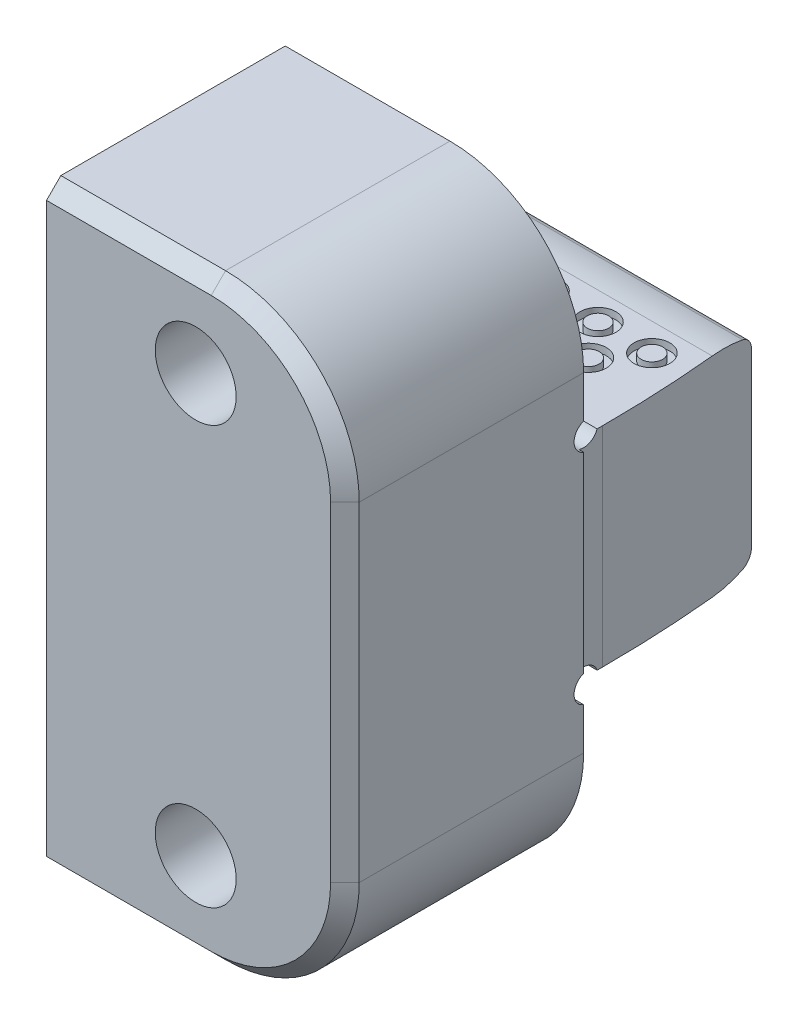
ISO-10303-21;
HEADER;
FILE_DESCRIPTION(('STEP AP214'),'2;1');
FILE_NAME('part.step','',(''),(''),'','','');
FILE_SCHEMA(('AUTOMOTIVE_DESIGN { 1 0 10303 214 1 1 1 1 }'));
ENDSEC;
DATA;
#1=APPLICATION_CONTEXT('core data for automotive mechanical design processes');
#2=APPLICATION_PROTOCOL_DEFINITION('international standard','automotive_design',2000,#1);
#3=PRODUCT_CONTEXT('',#1,'mechanical');
#4=PRODUCT('Part','Part','',(#3));
#5=PRODUCT_RELATED_PRODUCT_CATEGORY('part','',(#4));
#6=PRODUCT_DEFINITION_FORMATION('','',#4);
#7=PRODUCT_DEFINITION_CONTEXT('part definition',#1,'design');
#8=PRODUCT_DEFINITION('design','',#6,#7);
#9=PRODUCT_DEFINITION_SHAPE('','',#8);
#10=(LENGTH_UNIT() NAMED_UNIT(*) SI_UNIT(.MILLI.,.METRE.));
#11=(NAMED_UNIT(*) PLANE_ANGLE_UNIT() SI_UNIT($,.RADIAN.));
#12=(NAMED_UNIT(*) SI_UNIT($,.STERADIAN.) SOLID_ANGLE_UNIT());
#13=UNCERTAINTY_MEASURE_WITH_UNIT(LENGTH_MEASURE(1.E-05),#10,'distance_accuracy_value','');
#14=(GEOMETRIC_REPRESENTATION_CONTEXT(3) GLOBAL_UNCERTAINTY_ASSIGNED_CONTEXT((#13)) GLOBAL_UNIT_ASSIGNED_CONTEXT((#10,
#11,#12)) REPRESENTATION_CONTEXT('',''));
#15=CARTESIAN_POINT('',(0.,0.,0.));
#16=DIRECTION('',(0.,0.,1.));
#17=DIRECTION('',(1.,0.,0.));
#18=AXIS2_PLACEMENT_3D('',#15,#16,#17);
#19=CARTESIAN_POINT('',(7.9375,-5.56006,-9.7536));
#20=DIRECTION('',(0.,0.,1.));
#21=DIRECTION('',(1.,0.,0.));
#22=AXIS2_PLACEMENT_3D('',#19,#20,#21);
#23=PLANE('',#22);
#24=DIRECTION('',(1.,0.,0.));
#25=VECTOR('',#24,1.);
#26=CARTESIAN_POINT('',(-7.9375,4.5640401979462,-9.7536));
#27=LINE('',#26,#25);
#28=CARTESIAN_POINT('',(-7.9375,4.5640401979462,-9.7536));
#29=VERTEX_POINT('',#28);
#30=CARTESIAN_POINT('',(7.11424392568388,4.5640401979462,-9.7536));
#31=VERTEX_POINT('',#30);
#32=EDGE_CURVE('E685',#29,#31,#27,.T.);
#33=ORIENTED_EDGE('',*,*,#32,.T.);
#34=DIRECTION('',(0.,1.,0.));
#35=VECTOR('',#34,1.);
#36=CARTESIAN_POINT('',(7.11424392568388,-15.875,-9.7536));
#37=LINE('',#36,#35);
#38=CARTESIAN_POINT('',(7.11424392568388,-4.5640401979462,-9.7536));
#39=VERTEX_POINT('',#38);
#40=EDGE_CURVE('E205',#31,#39,#37,.F.);
#41=ORIENTED_EDGE('',*,*,#40,.T.);
#42=DIRECTION('',(1.,0.,0.));
#43=VECTOR('',#42,1.);
#44=CARTESIAN_POINT('',(-7.9375,-4.5640401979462,-9.7536));
#45=LINE('',#44,#43);
#46=CARTESIAN_POINT('',(-7.9375,-4.5640401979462,-9.7536));
#47=VERTEX_POINT('',#46);
#48=EDGE_CURVE('E703',#47,#39,#45,.T.);
#49=ORIENTED_EDGE('',*,*,#48,.F.);
#50=DIRECTION('',(0.,1.,0.));
#51=VECTOR('',#50,1.);
#52=CARTESIAN_POINT('',(-7.9375,-5.56006,-9.7536));
#53=LINE('',#52,#51);
#54=EDGE_CURVE('E232',#47,#29,#53,.T.);
#55=ORIENTED_EDGE('',*,*,#54,.T.);
#56=EDGE_LOOP('',(#33,#41,#49,#55));
#57=FACE_BOUND('',#56,.T.);
#58=ADVANCED_FACE('F32',(#57),#23,.F.);
#59=CARTESIAN_POINT('',(7.9375,15.875,0.));
#60=DIRECTION('',(0.,0.,1.));
#61=DIRECTION('',(0.,-1.,0.));
#62=AXIS2_PLACEMENT_3D('',#59,#60,#61);
#63=PLANE('',#62);
#64=CARTESIAN_POINT('',(0.,-11.1125,0.));
#65=DIRECTION('',(0.,0.,-1.));
#66=DIRECTION('',(0.,1.,0.));
#67=AXIS2_PLACEMENT_3D('',#64,#65,#66);
#68=CIRCLE('',#67,3.57251);
#69=CARTESIAN_POINT('',(0.,-7.53999,0.));
#70=VERTEX_POINT('',#69);
#71=EDGE_CURVE('E421',#70,#70,#68,.T.);
#72=ORIENTED_EDGE('',*,*,#71,.F.);
#73=EDGE_LOOP('',(#72));
#74=FACE_BOUND('',#73,.T.);
#75=DIRECTION('',(0.,1.,0.));
#76=VECTOR('',#75,1.);
#77=CARTESIAN_POINT('',(7.9375,-15.875,0.));
#78=LINE('',#77,#76);
#79=CARTESIAN_POINT('',(7.9375,-8.763,0.));
#80=VERTEX_POINT('',#79);
#81=CARTESIAN_POINT('',(7.9375,-6.53248048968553,0.));
#82=VERTEX_POINT('',#81);
#83=EDGE_CURVE('E221',#80,#82,#78,.T.);
#84=ORIENTED_EDGE('',*,*,#83,.F.);
#85=CARTESIAN_POINT('',(0.8255,-8.763,0.));
#86=DIRECTION('',(0.,0.,1.));
#87=DIRECTION('',(0.,-1.,0.));
#88=AXIS2_PLACEMENT_3D('',#85,#86,#87);
#89=CIRCLE('',#88,7.112);
#90=CARTESIAN_POINT('',(0.8255,-15.875,0.));
#91=VERTEX_POINT('',#90);
#92=EDGE_CURVE('E1647',#80,#91,#89,.F.);
#93=ORIENTED_EDGE('',*,*,#92,.T.);
#94=DIRECTION('',(-1.,0.,0.));
#95=VECTOR('',#94,1.);
#96=CARTESIAN_POINT('',(7.9375,-15.875,0.));
#97=LINE('',#96,#95);
#98=CARTESIAN_POINT('',(-7.9375,-15.875,0.));
#99=VERTEX_POINT('',#98);
#100=EDGE_CURVE('E242',#91,#99,#97,.T.);
#101=ORIENTED_EDGE('',*,*,#100,.T.);
#102=DIRECTION('',(0.,1.,0.));
#103=VECTOR('',#102,1.);
#104=CARTESIAN_POINT('',(-7.9375,-15.875,0.));
#105=LINE('',#104,#103);
#106=CARTESIAN_POINT('',(-7.9375,-6.53248048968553,0.));
#107=VERTEX_POINT('',#106);
#108=EDGE_CURVE('E227',#99,#107,#105,.T.);
#109=ORIENTED_EDGE('',*,*,#108,.T.);
#110=DIRECTION('',(1.,0.,0.));
#111=VECTOR('',#110,1.);
#112=CARTESIAN_POINT('',(-7.9375,-6.53248048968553,0.));
#113=LINE('',#112,#111);
#114=EDGE_CURVE('E673',#107,#82,#113,.T.);
#115=ORIENTED_EDGE('',*,*,#114,.T.);
#116=EDGE_LOOP('',(#84,#93,#101,#109,#115));
#117=FACE_BOUND('',#116,.T.);
#118=ADVANCED_FACE('F326',(#74,#117),#63,.F.);
#119=CARTESIAN_POINT('',(7.9375,-5.09563951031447,0.));
#120=VERTEX_POINT('',#119);
#121=CARTESIAN_POINT('',(7.9375,5.09563951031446,0.));
#122=VERTEX_POINT('',#121);
#123=EDGE_CURVE('E223',#120,#122,#78,.T.);
#124=ORIENTED_EDGE('',*,*,#123,.F.);
#125=DIRECTION('',(1.,0.,0.));
#126=VECTOR('',#125,1.);
#127=CARTESIAN_POINT('',(-7.9375,-5.09563951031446,0.));
#128=LINE('',#127,#126);
#129=CARTESIAN_POINT('',(7.6835,-5.09563951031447,0.));
#130=VERTEX_POINT('',#129);
#131=EDGE_CURVE('E662',#120,#130,#128,.F.);
#132=ORIENTED_EDGE('',*,*,#131,.T.);
#133=DIRECTION('',(0.,-1.,0.));
#134=VECTOR('',#133,1.);
#135=CARTESIAN_POINT('',(7.6835,-14.5525814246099,0.));
#136=LINE('',#135,#134);
#137=CARTESIAN_POINT('',(7.6835,5.09563951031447,0.));
#138=VERTEX_POINT('',#137);
#139=EDGE_CURVE('E217',#138,#130,#136,.T.);
#140=ORIENTED_EDGE('',*,*,#139,.F.);
#141=DIRECTION('',(1.,0.,0.));
#142=VECTOR('',#141,1.);
#143=CARTESIAN_POINT('',(-7.9375,5.09563951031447,0.));
#144=LINE('',#143,#142);
#145=EDGE_CURVE('E661',#138,#122,#144,.T.);
#146=ORIENTED_EDGE('',*,*,#145,.T.);
#147=EDGE_LOOP('',(#124,#132,#140,#146));
#148=FACE_BOUND('',#147,.T.);
#149=ADVANCED_FACE('F327',(#148),#63,.F.);
#150=CARTESIAN_POINT('',(7.9375,-15.875,12.7));
#151=DIRECTION('',(0.,0.,-1.));
#152=DIRECTION('',(-1.,0.,0.));
#153=AXIS2_PLACEMENT_3D('',#150,#151,#152);
#154=PLANE('',#153);
#155=CARTESIAN_POINT('',(0.,11.1125,12.7));
#156=DIRECTION('',(0.,0.,-1.));
#157=DIRECTION('',(0.,1.,0.));
#158=AXIS2_PLACEMENT_3D('',#155,#156,#157);
#159=CIRCLE('',#158,2.15265);
#160=CARTESIAN_POINT('',(0.,13.26515,12.7));
#161=VERTEX_POINT('',#160);
#162=EDGE_CURVE('E418',#161,#161,#159,.T.);
#163=ORIENTED_EDGE('',*,*,#162,.T.);
#164=EDGE_LOOP('',(#163));
#165=FACE_BOUND('',#164,.T.);
#166=CARTESIAN_POINT('',(0.,-11.1125,12.7));
#167=DIRECTION('',(0.,0.,-1.));
#168=DIRECTION('',(0.,1.,0.));
#169=AXIS2_PLACEMENT_3D('',#166,#167,#168);
#170=CIRCLE('',#169,2.15265);
#171=CARTESIAN_POINT('',(0.,-8.95985,12.7));
#172=VERTEX_POINT('',#171);
#173=EDGE_CURVE('E430',#172,#172,#170,.T.);
#174=ORIENTED_EDGE('',*,*,#173,.T.);
#175=EDGE_LOOP('',(#174));
#176=FACE_BOUND('',#175,.T.);
#177=CARTESIAN_POINT('',(0.8255,8.763,12.7));
#178=DIRECTION('',(0.,0.,-1.));
#179=DIRECTION('',(-1.,0.,0.));
#180=AXIS2_PLACEMENT_3D('',#177,#178,#179);
#181=CIRCLE('',#180,6.35);
#182=CARTESIAN_POINT('',(7.1755,8.763,12.7));
#183=VERTEX_POINT('',#182);
#184=CARTESIAN_POINT('',(0.8255,15.113,12.7));
#185=VERTEX_POINT('',#184);
#186=EDGE_CURVE('E388',#183,#185,#181,.F.);
#187=ORIENTED_EDGE('',*,*,#186,.T.);
#188=DIRECTION('',(-1.,0.,0.));
#189=VECTOR('',#188,1.);
#190=CARTESIAN_POINT('',(7.9375,15.113,12.7));
#191=LINE('',#190,#189);
#192=CARTESIAN_POINT('',(-7.9375,15.113,12.7));
#193=VERTEX_POINT('',#192);
#194=EDGE_CURVE('E385',#185,#193,#191,.T.);
#195=ORIENTED_EDGE('',*,*,#194,.T.);
#196=DIRECTION('',(0.,-1.,0.));
#197=VECTOR('',#196,1.);
#198=CARTESIAN_POINT('',(-7.9375,-15.875,12.7));
#199=LINE('',#198,#197);
#200=CARTESIAN_POINT('',(-7.9375,-15.113,12.7));
#201=VERTEX_POINT('',#200);
#202=EDGE_CURVE('E211',#193,#201,#199,.T.);
#203=ORIENTED_EDGE('',*,*,#202,.T.);
#204=DIRECTION('',(1.,0.,0.));
#205=VECTOR('',#204,1.);
#206=CARTESIAN_POINT('',(7.9375,-15.113,12.7));
#207=LINE('',#206,#205);
#208=CARTESIAN_POINT('',(0.8255,-15.113,12.7));
#209=VERTEX_POINT('',#208);
#210=EDGE_CURVE('E381',#201,#209,#207,.T.);
#211=ORIENTED_EDGE('',*,*,#210,.T.);
#212=CARTESIAN_POINT('',(0.8255,-8.763,12.7));
#213=DIRECTION('',(0.,0.,-1.));
#214=DIRECTION('',(-1.,0.,0.));
#215=AXIS2_PLACEMENT_3D('',#212,#213,#214);
#216=CIRCLE('',#215,6.35);
#217=CARTESIAN_POINT('',(7.1755,-8.763,12.7));
#218=VERTEX_POINT('',#217);
#219=EDGE_CURVE('E1654',#209,#218,#216,.F.);
#220=ORIENTED_EDGE('',*,*,#219,.T.);
#221=DIRECTION('',(0.,1.,0.));
#222=VECTOR('',#221,1.);
#223=CARTESIAN_POINT('',(7.1755,-15.875,12.7));
#224=LINE('',#223,#222);
#225=EDGE_CURVE('E1638',#218,#183,#224,.T.);
#226=ORIENTED_EDGE('',*,*,#225,.T.);
#227=EDGE_LOOP('',(#187,#195,#203,#211,#220,#226));
#228=FACE_BOUND('',#227,.T.);
#229=ADVANCED_FACE('F344',(#165,#176,#228),#154,.F.);
#230=CARTESIAN_POINT('',(7.9375,-15.875,12.7));
#231=DIRECTION('',(0.,1.,0.));
#232=DIRECTION('',(0.,0.,1.));
#233=AXIS2_PLACEMENT_3D('',#230,#231,#232);
#234=PLANE('',#233);
#235=DIRECTION('',(0.,0.,-1.));
#236=VECTOR('',#235,1.);
#237=CARTESIAN_POINT('',(0.8255,-15.875,12.7));
#238=LINE('',#237,#236);
#239=CARTESIAN_POINT('',(0.8255,-15.875,11.938));
#240=VERTEX_POINT('',#239);
#241=EDGE_CURVE('E1643',#91,#240,#238,.F.);
#242=ORIENTED_EDGE('',*,*,#241,.T.);
#243=DIRECTION('',(-1.,0.,0.));
#244=VECTOR('',#243,1.);
#245=CARTESIAN_POINT('',(7.9375,-15.875,11.938));
#246=LINE('',#245,#244);
#247=CARTESIAN_POINT('',(-7.9375,-15.875,11.938));
#248=VERTEX_POINT('',#247);
#249=EDGE_CURVE('E11',#240,#248,#246,.T.);
#250=ORIENTED_EDGE('',*,*,#249,.T.);
#251=DIRECTION('',(0.,0.,-1.));
#252=VECTOR('',#251,1.);
#253=CARTESIAN_POINT('',(-7.9375,-15.875,12.7));
#254=LINE('',#253,#252);
#255=EDGE_CURVE('E215',#248,#99,#254,.T.);
#256=ORIENTED_EDGE('',*,*,#255,.T.);
#257=ORIENTED_EDGE('',*,*,#100,.F.);
#258=EDGE_LOOP('',(#242,#250,#256,#257));
#259=FACE_BOUND('',#258,.T.);
#260=ADVANCED_FACE('F338',(#259),#234,.F.);
#261=CARTESIAN_POINT('',(7.9375,-5.56006,0.));
#262=DIRECTION('',(0.,1.,0.));
#263=DIRECTION('',(0.,0.,1.));
#264=AXIS2_PLACEMENT_3D('',#261,#262,#263);
#265=PLANE('',#264);
#266=CARTESIAN_POINT('',(-4.4323,-5.56006,-4.0132));
#267=DIRECTION('',(0.,1.,0.));
#268=DIRECTION('',(0.,0.,1.));
#269=AXIS2_PLACEMENT_3D('',#266,#267,#268);
#270=CIRCLE('',#269,0.9525);
#271=CARTESIAN_POINT('',(-4.4323,-5.56006,-4.9657));
#272=VERTEX_POINT('',#271);
#273=EDGE_CURVE('E437',#272,#272,#270,.T.);
#274=ORIENTED_EDGE('',*,*,#273,.T.);
#275=EDGE_LOOP('',(#274));
#276=FACE_BOUND('',#275,.T.);
#277=CARTESIAN_POINT('',(4.1783,-5.56006,-4.0132));
#278=DIRECTION('',(0.,1.,0.));
#279=DIRECTION('',(0.,0.,1.));
#280=AXIS2_PLACEMENT_3D('',#277,#278,#279);
#281=CIRCLE('',#280,0.9525);
#282=CARTESIAN_POINT('',(4.1783,-5.56006,-4.9657));
#283=VERTEX_POINT('',#282);
#284=EDGE_CURVE('E449',#283,#283,#281,.T.);
#285=ORIENTED_EDGE('',*,*,#284,.T.);
#286=EDGE_LOOP('',(#285));
#287=FACE_BOUND('',#286,.T.);
#288=CARTESIAN_POINT('',(1.3081,-5.56006,-4.0132));
#289=DIRECTION('',(0.,1.,0.));
#290=DIRECTION('',(0.,0.,1.));
#291=AXIS2_PLACEMENT_3D('',#288,#289,#290);
#292=CIRCLE('',#291,0.952499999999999);
#293=CARTESIAN_POINT('',(1.3081,-5.56006,-4.9657));
#294=VERTEX_POINT('',#293);
#295=EDGE_CURVE('E461',#294,#294,#292,.T.);
#296=ORIENTED_EDGE('',*,*,#295,.T.);
#297=EDGE_LOOP('',(#296));
#298=FACE_BOUND('',#297,.T.);
#299=CARTESIAN_POINT('',(-1.5621,-5.56006,-4.0132));
#300=DIRECTION('',(0.,1.,0.));
#301=DIRECTION('',(0.,0.,1.));
#302=AXIS2_PLACEMENT_3D('',#299,#300,#301);
#303=CIRCLE('',#302,0.9525);
#304=CARTESIAN_POINT('',(-1.5621,-5.56006,-4.9657));
#305=VERTEX_POINT('',#304);
#306=EDGE_CURVE('E473',#305,#305,#303,.T.);
#307=ORIENTED_EDGE('',*,*,#306,.T.);
#308=EDGE_LOOP('',(#307));
#309=FACE_BOUND('',#308,.T.);
#310=CARTESIAN_POINT('',(5.6515,-5.56006,-5.9182));
#311=DIRECTION('',(0.,1.,0.));
#312=DIRECTION('',(0.,0.,1.));
#313=AXIS2_PLACEMENT_3D('',#310,#311,#312);
#314=CIRCLE('',#313,0.9525);
#315=CARTESIAN_POINT('',(5.6515,-5.56006,-6.8707));
#316=VERTEX_POINT('',#315);
#317=EDGE_CURVE('E485',#316,#316,#314,.T.);
#318=ORIENTED_EDGE('',*,*,#317,.T.);
#319=EDGE_LOOP('',(#318));
#320=FACE_BOUND('',#319,.T.);
#321=CARTESIAN_POINT('',(-5.8293,-5.56006,-5.9182));
#322=DIRECTION('',(0.,1.,0.));
#323=DIRECTION('',(0.,0.,1.));
#324=AXIS2_PLACEMENT_3D('',#321,#322,#323);
#325=CIRCLE('',#324,0.9525);
#326=CARTESIAN_POINT('',(-5.8293,-5.56006,-6.8707));
#327=VERTEX_POINT('',#326);
#328=EDGE_CURVE('E497',#327,#327,#325,.T.);
#329=ORIENTED_EDGE('',*,*,#328,.T.);
#330=EDGE_LOOP('',(#329));
#331=FACE_BOUND('',#330,.T.);
#332=CARTESIAN_POINT('',(2.7813,-5.56006,-5.9182));
#333=DIRECTION('',(0.,1.,0.));
#334=DIRECTION('',(0.,0.,1.));
#335=AXIS2_PLACEMENT_3D('',#332,#333,#334);
#336=CIRCLE('',#335,0.9525);
#337=CARTESIAN_POINT('',(2.7813,-5.56006,-6.8707));
#338=VERTEX_POINT('',#337);
#339=EDGE_CURVE('E509',#338,#338,#336,.T.);
#340=ORIENTED_EDGE('',*,*,#339,.T.);
#341=EDGE_LOOP('',(#340));
#342=FACE_BOUND('',#341,.T.);
#343=CARTESIAN_POINT('',(-0.0888999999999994,-5.56006,-5.9182));
#344=DIRECTION('',(0.,1.,0.));
#345=DIRECTION('',(0.,0.,1.));
#346=AXIS2_PLACEMENT_3D('',#343,#344,#345);
#347=CIRCLE('',#346,0.9525);
#348=CARTESIAN_POINT('',(-0.0888999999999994,-5.56006,-6.8707));
#349=VERTEX_POINT('',#348);
#350=EDGE_CURVE('E521',#349,#349,#347,.T.);
#351=ORIENTED_EDGE('',*,*,#350,.T.);
#352=EDGE_LOOP('',(#351));
#353=FACE_BOUND('',#352,.T.);
#354=CARTESIAN_POINT('',(-2.9591,-5.56006,-5.9182));
#355=DIRECTION('',(0.,1.,0.));
#356=DIRECTION('',(0.,0.,1.));
#357=AXIS2_PLACEMENT_3D('',#354,#355,#356);
#358=CIRCLE('',#357,0.9525);
#359=CARTESIAN_POINT('',(-2.9591,-5.56006,-6.8707));
#360=VERTEX_POINT('',#359);
#361=EDGE_CURVE('E533',#360,#360,#358,.T.);
#362=ORIENTED_EDGE('',*,*,#361,.T.);
#363=EDGE_LOOP('',(#362));
#364=FACE_BOUND('',#363,.T.);
#365=DIRECTION('',(1.,0.,0.));
#366=VECTOR('',#365,1.);
#367=CARTESIAN_POINT('',(-7.9375,-5.56006,-7.3914));
#368=LINE('',#367,#366);
#369=CARTESIAN_POINT('',(-7.9375,-5.56006,-7.3914));
#370=VERTEX_POINT('',#369);
#371=CARTESIAN_POINT('',(7.38775984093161,-5.56006,-7.3914));
#372=VERTEX_POINT('',#371);
#373=EDGE_CURVE('E204',#370,#372,#368,.T.);
#374=ORIENTED_EDGE('',*,*,#373,.T.);
#375=CARTESIAN_POINT('',(-55.8165,-5.56006,-1.27));
#376=DIRECTION('',(0.,1.,0.));
#377=DIRECTION('',(0.,0.,1.));
#378=AXIS2_PLACEMENT_3D('',#375,#376,#377);
#379=CIRCLE('',#378,63.5);
#380=CARTESIAN_POINT('',(7.6835,-5.56006,-1.27));
#381=VERTEX_POINT('',#380);
#382=EDGE_CURVE('E186',#372,#381,#379,.F.);
#383=ORIENTED_EDGE('',*,*,#382,.T.);
#384=DIRECTION('',(0.,0.,1.));
#385=VECTOR('',#384,1.);
#386=CARTESIAN_POINT('',(7.6835,-5.56006,0.));
#387=LINE('',#386,#385);
#388=CARTESIAN_POINT('',(7.6835,-5.56006,-0.972420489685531));
#389=VERTEX_POINT('',#388);
#390=EDGE_CURVE('E201',#381,#389,#387,.T.);
#391=ORIENTED_EDGE('',*,*,#390,.T.);
#392=DIRECTION('',(1.,0.,0.));
#393=VECTOR('',#392,1.);
#394=CARTESIAN_POINT('',(-7.9375,-5.56006,-0.972420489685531));
#395=LINE('',#394,#393);
#396=CARTESIAN_POINT('',(-7.9375,-5.56006,-0.972420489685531));
#397=VERTEX_POINT('',#396);
#398=EDGE_CURVE('E679',#389,#397,#395,.F.);
#399=ORIENTED_EDGE('',*,*,#398,.T.);
#400=DIRECTION('',(0.,0.,-1.));
#401=VECTOR('',#400,1.);
#402=CARTESIAN_POINT('',(-7.9375,-5.56006,0.));
#403=LINE('',#402,#401);
#404=EDGE_CURVE('E230',#397,#370,#403,.T.);
#405=ORIENTED_EDGE('',*,*,#404,.T.);
#406=EDGE_LOOP('',(#374,#383,#391,#399,#405));
#407=FACE_BOUND('',#406,.T.);
#408=ADVANCED_FACE('F199',(#276,#287,#298,#309,#320,#331,#342,#353,#364,#407),#265,.F.);
#409=CARTESIAN_POINT('',(7.9375,5.56006,0.));
#410=DIRECTION('',(0.,-1.,0.));
#411=DIRECTION('',(0.,0.,-1.));
#412=AXIS2_PLACEMENT_3D('',#409,#410,#411);
#413=PLANE('',#412);
#414=CARTESIAN_POINT('',(-4.4323,5.56006,-4.0132));
#415=DIRECTION('',(0.,1.,0.));
#416=DIRECTION('',(0.,0.,1.));
#417=AXIS2_PLACEMENT_3D('',#414,#415,#416);
#418=CIRCLE('',#417,0.9525);
#419=CARTESIAN_POINT('',(-4.4323,5.56006,-3.0607));
#420=VERTEX_POINT('',#419);
#421=EDGE_CURVE('E545',#420,#420,#418,.T.);
#422=ORIENTED_EDGE('',*,*,#421,.F.);
#423=EDGE_LOOP('',(#422));
#424=FACE_BOUND('',#423,.T.);
#425=CARTESIAN_POINT('',(4.1783,5.56006,-4.0132));
#426=DIRECTION('',(0.,1.,0.));
#427=DIRECTION('',(0.,0.,1.));
#428=AXIS2_PLACEMENT_3D('',#425,#426,#427);
#429=CIRCLE('',#428,0.9525);
#430=CARTESIAN_POINT('',(4.1783,5.56006,-3.0607));
#431=VERTEX_POINT('',#430);
#432=EDGE_CURVE('E557',#431,#431,#429,.T.);
#433=ORIENTED_EDGE('',*,*,#432,.F.);
#434=EDGE_LOOP('',(#433));
#435=FACE_BOUND('',#434,.T.);
#436=CARTESIAN_POINT('',(1.3081,5.56006,-4.0132));
#437=DIRECTION('',(0.,1.,0.));
#438=DIRECTION('',(0.,0.,1.));
#439=AXIS2_PLACEMENT_3D('',#436,#437,#438);
#440=CIRCLE('',#439,0.952499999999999);
#441=CARTESIAN_POINT('',(1.3081,5.56006,-3.0607));
#442=VERTEX_POINT('',#441);
#443=EDGE_CURVE('E569',#442,#442,#440,.T.);
#444=ORIENTED_EDGE('',*,*,#443,.F.);
#445=EDGE_LOOP('',(#444));
#446=FACE_BOUND('',#445,.T.);
#447=CARTESIAN_POINT('',(-1.5621,5.56006,-4.0132));
#448=DIRECTION('',(0.,1.,0.));
#449=DIRECTION('',(0.,0.,1.));
#450=AXIS2_PLACEMENT_3D('',#447,#448,#449);
#451=CIRCLE('',#450,0.9525);
#452=CARTESIAN_POINT('',(-1.5621,5.56006,-3.0607));
#453=VERTEX_POINT('',#452);
#454=EDGE_CURVE('E581',#453,#453,#451,.T.);
#455=ORIENTED_EDGE('',*,*,#454,.F.);
#456=EDGE_LOOP('',(#455));
#457=FACE_BOUND('',#456,.T.);
#458=CARTESIAN_POINT('',(5.6515,5.56006,-5.9182));
#459=DIRECTION('',(0.,1.,0.));
#460=DIRECTION('',(0.,0.,1.));
#461=AXIS2_PLACEMENT_3D('',#458,#459,#460);
#462=CIRCLE('',#461,0.9525);
#463=CARTESIAN_POINT('',(5.6515,5.56006,-4.9657));
#464=VERTEX_POINT('',#463);
#465=EDGE_CURVE('E593',#464,#464,#462,.T.);
#466=ORIENTED_EDGE('',*,*,#465,.F.);
#467=EDGE_LOOP('',(#466));
#468=FACE_BOUND('',#467,.T.);
#469=CARTESIAN_POINT('',(-5.8293,5.56006,-5.9182));
#470=DIRECTION('',(0.,1.,0.));
#471=DIRECTION('',(0.,0.,1.));
#472=AXIS2_PLACEMENT_3D('',#469,#470,#471);
#473=CIRCLE('',#472,0.9525);
#474=CARTESIAN_POINT('',(-5.8293,5.56006,-4.9657));
#475=VERTEX_POINT('',#474);
#476=EDGE_CURVE('E605',#475,#475,#473,.T.);
#477=ORIENTED_EDGE('',*,*,#476,.F.);
#478=EDGE_LOOP('',(#477));
#479=FACE_BOUND('',#478,.T.);
#480=CARTESIAN_POINT('',(2.7813,5.56006,-5.9182));
#481=DIRECTION('',(0.,1.,0.));
#482=DIRECTION('',(0.,0.,1.));
#483=AXIS2_PLACEMENT_3D('',#480,#481,#482);
#484=CIRCLE('',#483,0.9525);
#485=CARTESIAN_POINT('',(2.7813,5.56006,-4.9657));
#486=VERTEX_POINT('',#485);
#487=EDGE_CURVE('E617',#486,#486,#484,.T.);
#488=ORIENTED_EDGE('',*,*,#487,.F.);
#489=EDGE_LOOP('',(#488));
#490=FACE_BOUND('',#489,.T.);
#491=CARTESIAN_POINT('',(-0.0888999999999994,5.56006,-5.9182));
#492=DIRECTION('',(0.,1.,0.));
#493=DIRECTION('',(0.,0.,1.));
#494=AXIS2_PLACEMENT_3D('',#491,#492,#493);
#495=CIRCLE('',#494,0.9525);
#496=CARTESIAN_POINT('',(-0.0888999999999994,5.56006,-4.9657));
#497=VERTEX_POINT('',#496);
#498=EDGE_CURVE('E629',#497,#497,#495,.T.);
#499=ORIENTED_EDGE('',*,*,#498,.F.);
#500=EDGE_LOOP('',(#499));
#501=FACE_BOUND('',#500,.T.);
#502=CARTESIAN_POINT('',(-2.9591,5.56006,-5.9182));
#503=DIRECTION('',(0.,1.,0.));
#504=DIRECTION('',(0.,0.,1.));
#505=AXIS2_PLACEMENT_3D('',#502,#503,#504);
#506=CIRCLE('',#505,0.9525);
#507=CARTESIAN_POINT('',(-2.9591,5.56006,-4.9657));
#508=VERTEX_POINT('',#507);
#509=EDGE_CURVE('E641',#508,#508,#506,.T.);
#510=ORIENTED_EDGE('',*,*,#509,.F.);
#511=EDGE_LOOP('',(#510));
#512=FACE_BOUND('',#511,.T.);
#513=DIRECTION('',(0.,0.,-1.));
#514=VECTOR('',#513,1.);
#515=CARTESIAN_POINT('',(7.6835,5.56006,0.));
#516=LINE('',#515,#514);
#517=CARTESIAN_POINT('',(7.6835,5.56006,-0.972420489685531));
#518=VERTEX_POINT('',#517);
#519=CARTESIAN_POINT('',(7.6835,5.56006,-1.27));
#520=VERTEX_POINT('',#519);
#521=EDGE_CURVE('E212',#518,#520,#516,.T.);
#522=ORIENTED_EDGE('',*,*,#521,.T.);
#523=CARTESIAN_POINT('',(-55.8165,5.56006,-1.27));
#524=DIRECTION('',(0.,-1.,0.));
#525=DIRECTION('',(0.,0.,-1.));
#526=AXIS2_PLACEMENT_3D('',#523,#524,#525);
#527=CIRCLE('',#526,63.5);
#528=CARTESIAN_POINT('',(7.38775984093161,5.56006,-7.3914));
#529=VERTEX_POINT('',#528);
#530=EDGE_CURVE('E189',#520,#529,#527,.F.);
#531=ORIENTED_EDGE('',*,*,#530,.T.);
#532=DIRECTION('',(1.,0.,0.));
#533=VECTOR('',#532,1.);
#534=CARTESIAN_POINT('',(-7.9375,5.56006,-7.3914));
#535=LINE('',#534,#533);
#536=CARTESIAN_POINT('',(-7.9375,5.56006,-7.3914));
#537=VERTEX_POINT('',#536);
#538=EDGE_CURVE('E688',#537,#529,#535,.T.);
#539=ORIENTED_EDGE('',*,*,#538,.F.);
#540=DIRECTION('',(0.,0.,1.));
#541=VECTOR('',#540,1.);
#542=CARTESIAN_POINT('',(-7.9375,5.56006,0.));
#543=LINE('',#542,#541);
#544=CARTESIAN_POINT('',(-7.9375,5.56006,-0.972420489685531));
#545=VERTEX_POINT('',#544);
#546=EDGE_CURVE('E234',#537,#545,#543,.T.);
#547=ORIENTED_EDGE('',*,*,#546,.T.);
#548=DIRECTION('',(1.,0.,0.));
#549=VECTOR('',#548,1.);
#550=CARTESIAN_POINT('',(-7.9375,5.56006,-0.972420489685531));
#551=LINE('',#550,#549);
#552=EDGE_CURVE('E655',#545,#518,#551,.T.);
#553=ORIENTED_EDGE('',*,*,#552,.T.);
#554=EDGE_LOOP('',(#522,#531,#539,#547,#553));
#555=FACE_BOUND('',#554,.T.);
#556=ADVANCED_FACE('F324',(#424,#435,#446,#457,#468,#479,#490,#501,#512,#555),#413,.F.);
#557=CARTESIAN_POINT('',(0.,11.1125,0.));
#558=DIRECTION('',(0.,0.,-1.));
#559=DIRECTION('',(0.,1.,0.));
#560=AXIS2_PLACEMENT_3D('',#557,#558,#559);
#561=CIRCLE('',#560,3.57251);
#562=CARTESIAN_POINT('',(0.,14.68501,0.));
#563=VERTEX_POINT('',#562);
#564=EDGE_CURVE('E403',#563,#563,#561,.T.);
#565=ORIENTED_EDGE('',*,*,#564,.F.);
#566=EDGE_LOOP('',(#565));
#567=FACE_BOUND('',#566,.T.);
#568=DIRECTION('',(-1.,0.,0.));
#569=VECTOR('',#568,1.);
#570=CARTESIAN_POINT('',(7.9375,15.875,0.));
#571=LINE('',#570,#569);
#572=CARTESIAN_POINT('',(0.8255,15.875,0.));
#573=VERTEX_POINT('',#572);
#574=CARTESIAN_POINT('',(-7.9375,15.875,0.));
#575=VERTEX_POINT('',#574);
#576=EDGE_CURVE('E222',#573,#575,#571,.T.);
#577=ORIENTED_EDGE('',*,*,#576,.F.);
#578=CARTESIAN_POINT('',(0.8255,8.763,0.));
#579=DIRECTION('',(0.,0.,1.));
#580=DIRECTION('',(0.,-1.,0.));
#581=AXIS2_PLACEMENT_3D('',#578,#579,#580);
#582=CIRCLE('',#581,7.112);
#583=CARTESIAN_POINT('',(7.9375,8.763,0.));
#584=VERTEX_POINT('',#583);
#585=EDGE_CURVE('E1642',#573,#584,#582,.F.);
#586=ORIENTED_EDGE('',*,*,#585,.T.);
#587=CARTESIAN_POINT('',(7.9375,6.53248048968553,0.));
#588=VERTEX_POINT('',#587);
#589=EDGE_CURVE('E224',#588,#584,#78,.T.);
#590=ORIENTED_EDGE('',*,*,#589,.F.);
#591=DIRECTION('',(1.,0.,0.));
#592=VECTOR('',#591,1.);
#593=CARTESIAN_POINT('',(-7.9375,6.53248048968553,0.));
#594=LINE('',#593,#592);
#595=CARTESIAN_POINT('',(-7.9375,6.53248048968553,0.));
#596=VERTEX_POINT('',#595);
#597=EDGE_CURVE('E663',#588,#596,#594,.F.);
#598=ORIENTED_EDGE('',*,*,#597,.T.);
#599=DIRECTION('',(0.,1.,0.));
#600=VECTOR('',#599,1.);
#601=CARTESIAN_POINT('',(-7.9375,15.875,0.));
#602=LINE('',#601,#600);
#603=EDGE_CURVE('E236',#596,#575,#602,.T.);
#604=ORIENTED_EDGE('',*,*,#603,.T.);
#605=EDGE_LOOP('',(#577,#586,#590,#598,#604));
#606=FACE_BOUND('',#605,.T.);
#607=ADVANCED_FACE('F321',(#567,#606),#63,.F.);
#608=CARTESIAN_POINT('',(7.9375,15.875,12.7));
#609=DIRECTION('',(0.,-1.,0.));
#610=DIRECTION('',(0.,0.,-1.));
#611=AXIS2_PLACEMENT_3D('',#608,#609,#610);
#612=PLANE('',#611);
#613=DIRECTION('',(0.,0.,1.));
#614=VECTOR('',#613,1.);
#615=CARTESIAN_POINT('',(-7.9375,15.875,12.7));
#616=LINE('',#615,#614);
#617=CARTESIAN_POINT('',(-7.9375,15.875,11.938));
#618=VERTEX_POINT('',#617);
#619=EDGE_CURVE('E239',#575,#618,#616,.T.);
#620=ORIENTED_EDGE('',*,*,#619,.T.);
#621=DIRECTION('',(1.,0.,0.));
#622=VECTOR('',#621,1.);
#623=CARTESIAN_POINT('',(7.9375,15.875,11.938));
#624=LINE('',#623,#622);
#625=CARTESIAN_POINT('',(0.8255,15.875,11.938));
#626=VERTEX_POINT('',#625);
#627=EDGE_CURVE('E56',#618,#626,#624,.T.);
#628=ORIENTED_EDGE('',*,*,#627,.T.);
#629=DIRECTION('',(0.,0.,1.));
#630=VECTOR('',#629,1.);
#631=CARTESIAN_POINT('',(0.8255,15.875,12.7));
#632=LINE('',#631,#630);
#633=EDGE_CURVE('E1641',#626,#573,#632,.F.);
#634=ORIENTED_EDGE('',*,*,#633,.T.);
#635=ORIENTED_EDGE('',*,*,#576,.T.);
#636=EDGE_LOOP('',(#620,#628,#634,#635));
#637=FACE_BOUND('',#636,.T.);
#638=ADVANCED_FACE('F314',(#637),#612,.F.);
#639=CARTESIAN_POINT('',(7.9375,15.875,12.7));
#640=DIRECTION('',(-1.,0.,0.));
#641=DIRECTION('',(0.,0.,1.));
#642=AXIS2_PLACEMENT_3D('',#639,#640,#641);
#643=PLANE('',#642);
#644=DIRECTION('',(0.,0.,1.));
#645=VECTOR('',#644,1.);
#646=CARTESIAN_POINT('',(7.9375,8.763,12.7));
#647=LINE('',#646,#645);
#648=CARTESIAN_POINT('',(7.9375,8.763,11.938));
#649=VERTEX_POINT('',#648);
#650=EDGE_CURVE('E257',#584,#649,#647,.T.);
#651=ORIENTED_EDGE('',*,*,#650,.T.);
#652=DIRECTION('',(0.,-1.,0.));
#653=VECTOR('',#652,1.);
#654=CARTESIAN_POINT('',(7.9375,15.875,11.938));
#655=LINE('',#654,#653);
#656=CARTESIAN_POINT('',(7.9375,-8.763,11.938));
#657=VERTEX_POINT('',#656);
#658=EDGE_CURVE('E1645',#649,#657,#655,.T.);
#659=ORIENTED_EDGE('',*,*,#658,.T.);
#660=DIRECTION('',(0.,0.,-1.));
#661=VECTOR('',#660,1.);
#662=CARTESIAN_POINT('',(7.9375,-8.763,12.7));
#663=LINE('',#662,#661);
#664=EDGE_CURVE('E1658',#657,#80,#663,.T.);
#665=ORIENTED_EDGE('',*,*,#664,.T.);
#666=ORIENTED_EDGE('',*,*,#83,.T.);
#667=CARTESIAN_POINT('',(7.9375,-5.81406,-0.253999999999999));
#668=DIRECTION('',(1.,0.,0.));
#669=DIRECTION('',(0.,0.,1.));
#670=AXIS2_PLACEMENT_3D('',#667,#668,#669);
#671=CIRCLE('',#670,0.762);
#672=EDGE_CURVE('E682',#120,#82,#671,.T.);
#673=ORIENTED_EDGE('',*,*,#672,.F.);
#674=ORIENTED_EDGE('',*,*,#123,.T.);
#675=CARTESIAN_POINT('',(7.9375,5.81406,-0.253999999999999));
#676=DIRECTION('',(1.,0.,0.));
#677=DIRECTION('',(0.,0.,-1.));
#678=AXIS2_PLACEMENT_3D('',#675,#676,#677);
#679=CIRCLE('',#678,0.762);
#680=EDGE_CURVE('E670',#588,#122,#679,.T.);
#681=ORIENTED_EDGE('',*,*,#680,.F.);
#682=ORIENTED_EDGE('',*,*,#589,.T.);
#683=EDGE_LOOP('',(#651,#659,#665,#666,#673,#674,#681,#682));
#684=FACE_BOUND('',#683,.T.);
#685=ADVANCED_FACE('F311',(#684),#643,.F.);
#686=CARTESIAN_POINT('',(-7.9375,15.875,12.7));
#687=DIRECTION('',(-1.,0.,0.));
#688=DIRECTION('',(0.,0.,1.));
#689=AXIS2_PLACEMENT_3D('',#686,#687,#688);
#690=PLANE('',#689);
#691=ORIENTED_EDGE('',*,*,#202,.F.);
#692=DIRECTION('',(0.,-0.707106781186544,0.707106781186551));
#693=VECTOR('',#692,1.);
#694=CARTESIAN_POINT('',(-7.9375,15.494,12.319));
#695=LINE('',#694,#693);
#696=EDGE_CURVE('E384',#193,#618,#695,.F.);
#697=ORIENTED_EDGE('',*,*,#696,.T.);
#698=ORIENTED_EDGE('',*,*,#619,.F.);
#699=ORIENTED_EDGE('',*,*,#603,.F.);
#700=CARTESIAN_POINT('',(-7.9375,5.81406,-0.253999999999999));
#701=DIRECTION('',(1.,0.,0.));
#702=DIRECTION('',(0.,0.,-1.));
#703=AXIS2_PLACEMENT_3D('',#700,#701,#702);
#704=CIRCLE('',#703,0.762);
#705=EDGE_CURVE('E669',#596,#545,#704,.T.);
#706=ORIENTED_EDGE('',*,*,#705,.T.);
#707=ORIENTED_EDGE('',*,*,#546,.F.);
#708=CARTESIAN_POINT('',(-7.9375,-0.789939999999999,-7.3914));
#709=DIRECTION('',(-1.,0.,0.));
#710=DIRECTION('',(0.,0.,1.));
#711=AXIS2_PLACEMENT_3D('',#708,#709,#710);
#712=CIRCLE('',#711,6.35);
#713=CARTESIAN_POINT('',(-7.9375,5.29412840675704,-9.20980909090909));
#714=VERTEX_POINT('',#713);
#715=EDGE_CURVE('E698',#537,#714,#712,.T.);
#716=ORIENTED_EDGE('',*,*,#715,.T.);
#717=CARTESIAN_POINT('',(-7.9375,4.5640401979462,-8.9916));
#718=DIRECTION('',(-1.,0.,0.));
#719=DIRECTION('',(0.,0.,1.));
#720=AXIS2_PLACEMENT_3D('',#717,#718,#719);
#721=CIRCLE('',#720,0.761999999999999);
#722=EDGE_CURVE('E691',#714,#29,#721,.T.);
#723=ORIENTED_EDGE('',*,*,#722,.T.);
#724=ORIENTED_EDGE('',*,*,#54,.F.);
#725=CARTESIAN_POINT('',(-7.9375,-4.5640401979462,-8.9916));
#726=DIRECTION('',(-1.,0.,0.));
#727=DIRECTION('',(0.,0.,-1.));
#728=AXIS2_PLACEMENT_3D('',#725,#726,#727);
#729=CIRCLE('',#728,0.761999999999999);
#730=CARTESIAN_POINT('',(-7.9375,-5.29412840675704,-9.20980909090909));
#731=VERTEX_POINT('',#730);
#732=EDGE_CURVE('E704',#47,#731,#729,.T.);
#733=ORIENTED_EDGE('',*,*,#732,.T.);
#734=CARTESIAN_POINT('',(-7.9375,0.789939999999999,-7.3914));
#735=DIRECTION('',(-1.,0.,0.));
#736=DIRECTION('',(0.,0.,-1.));
#737=AXIS2_PLACEMENT_3D('',#734,#735,#736);
#738=CIRCLE('',#737,6.35);
#739=EDGE_CURVE('E711',#731,#370,#738,.T.);
#740=ORIENTED_EDGE('',*,*,#739,.T.);
#741=ORIENTED_EDGE('',*,*,#404,.F.);
#742=CARTESIAN_POINT('',(-7.9375,-5.81406,-0.253999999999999));
#743=DIRECTION('',(1.,0.,0.));
#744=DIRECTION('',(0.,0.,1.));
#745=AXIS2_PLACEMENT_3D('',#742,#743,#744);
#746=CIRCLE('',#745,0.762);
#747=EDGE_CURVE('E681',#397,#107,#746,.T.);
#748=ORIENTED_EDGE('',*,*,#747,.T.);
#749=ORIENTED_EDGE('',*,*,#108,.F.);
#750=ORIENTED_EDGE('',*,*,#255,.F.);
#751=DIRECTION('',(0.,-0.70710678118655,-0.707106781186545));
#752=VECTOR('',#751,1.);
#753=CARTESIAN_POINT('',(-7.9375,0.38100000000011,28.194));
#754=LINE('',#753,#752);
#755=EDGE_CURVE('E378',#248,#201,#754,.F.);
#756=ORIENTED_EDGE('',*,*,#755,.T.);
#757=EDGE_LOOP('',(#691,#697,#698,#699,#706,#707,#716,#723,#724,#733,#740,#741,#748,#749,#750,#756));
#758=FACE_BOUND('',#757,.T.);
#759=ADVANCED_FACE('F310',(#758),#690,.T.);
#760=CARTESIAN_POINT('',(7.6835,17.1682519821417,0.));
#761=DIRECTION('',(-1.,0.,0.));
#762=DIRECTION('',(0.,0.,1.));
#763=AXIS2_PLACEMENT_3D('',#760,#761,#762);
#764=PLANE('',#763);
#765=ORIENTED_EDGE('',*,*,#390,.F.);
#766=DIRECTION('',(0.,1.,0.));
#767=VECTOR('',#766,1.);
#768=CARTESIAN_POINT('',(7.6835,-15.875,-1.27));
#769=LINE('',#768,#767);
#770=EDGE_CURVE('E183',#381,#520,#769,.T.);
#771=ORIENTED_EDGE('',*,*,#770,.T.);
#772=ORIENTED_EDGE('',*,*,#521,.F.);
#773=CARTESIAN_POINT('',(7.6835,5.81406,-0.253999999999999));
#774=DIRECTION('',(-1.,0.,0.));
#775=DIRECTION('',(0.,0.,1.));
#776=AXIS2_PLACEMENT_3D('',#773,#774,#775);
#777=CIRCLE('',#776,0.762);
#778=EDGE_CURVE('E245',#518,#138,#777,.T.);
#779=ORIENTED_EDGE('',*,*,#778,.T.);
#780=ORIENTED_EDGE('',*,*,#139,.T.);
#781=CARTESIAN_POINT('',(7.6835,-5.81406,-0.253999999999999));
#782=DIRECTION('',(-1.,0.,0.));
#783=DIRECTION('',(0.,0.,1.));
#784=AXIS2_PLACEMENT_3D('',#781,#782,#783);
#785=CIRCLE('',#784,0.762);
#786=EDGE_CURVE('E210',#130,#389,#785,.T.);
#787=ORIENTED_EDGE('',*,*,#786,.T.);
#788=EDGE_LOOP('',(#765,#771,#772,#779,#780,#787));
#789=FACE_BOUND('',#788,.T.);
#790=ADVANCED_FACE('F208',(#789),#764,.F.);
#791=CARTESIAN_POINT('',(-7.9375,5.81406,-0.253999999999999));
#792=DIRECTION('',(1.,0.,0.));
#793=DIRECTION('',(0.,0.,-1.));
#794=AXIS2_PLACEMENT_3D('',#791,#792,#793);
#795=CYLINDRICAL_SURFACE('',#794,0.762);
#796=ORIENTED_EDGE('',*,*,#680,.T.);
#797=ORIENTED_EDGE('',*,*,#145,.F.);
#798=ORIENTED_EDGE('',*,*,#778,.F.);
#799=ORIENTED_EDGE('',*,*,#552,.F.);
#800=ORIENTED_EDGE('',*,*,#705,.F.);
#801=ORIENTED_EDGE('',*,*,#597,.F.);
#802=EDGE_LOOP('',(#796,#797,#798,#799,#800,#801));
#803=FACE_BOUND('',#802,.T.);
#804=ADVANCED_FACE('F303',(#803),#795,.F.);
#805=CARTESIAN_POINT('',(-7.9375,-5.81406,-0.253999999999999));
#806=DIRECTION('',(1.,0.,0.));
#807=DIRECTION('',(0.,0.,-1.));
#808=AXIS2_PLACEMENT_3D('',#805,#806,#807);
#809=CYLINDRICAL_SURFACE('',#808,0.762);
#810=ORIENTED_EDGE('',*,*,#747,.F.);
#811=ORIENTED_EDGE('',*,*,#398,.F.);
#812=ORIENTED_EDGE('',*,*,#786,.F.);
#813=ORIENTED_EDGE('',*,*,#131,.F.);
#814=ORIENTED_EDGE('',*,*,#672,.T.);
#815=ORIENTED_EDGE('',*,*,#114,.F.);
#816=EDGE_LOOP('',(#810,#811,#812,#813,#814,#815));
#817=FACE_BOUND('',#816,.T.);
#818=ADVANCED_FACE('F293',(#817),#809,.F.);
#819=CARTESIAN_POINT('',(-7.9375,4.5640401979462,-8.9916));
#820=DIRECTION('',(1.,0.,0.));
#821=DIRECTION('',(0.,0.,-1.));
#822=AXIS2_PLACEMENT_3D('',#819,#820,#821);
#823=CYLINDRICAL_SURFACE('',#822,0.761999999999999);
#824=DIRECTION('',(1.,0.,0.));
#825=VECTOR('',#824,1.);
#826=CARTESIAN_POINT('',(-7.9375,5.29412840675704,-9.20980909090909));
#827=LINE('',#826,#825);
#828=CARTESIAN_POINT('',(7.1851621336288,5.29412840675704,-9.20980909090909));
#829=VERTEX_POINT('',#828);
#830=EDGE_CURVE('E690',#714,#829,#827,.T.);
#831=ORIENTED_EDGE('',*,*,#830,.T.);
#832=CARTESIAN_POINT('',(7.1851621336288,5.29412840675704,-9.20980909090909));
#833=CARTESIAN_POINT('',(7.17997335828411,5.28185687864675,-9.25099101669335));
#834=CARTESIAN_POINT('',(7.17487436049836,5.26603558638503,-9.2911161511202));
#835=CARTESIAN_POINT('',(7.16501407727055,5.22787196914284,-9.36816977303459));
#836=CARTESIAN_POINT('',(7.16025271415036,5.20553115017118,-9.4050989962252));
#837=CARTESIAN_POINT('',(7.15122083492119,5.15488686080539,-9.47471686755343));
#838=CARTESIAN_POINT('',(7.14695059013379,5.12658011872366,-9.50740317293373));
#839=CARTESIAN_POINT('',(7.13905197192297,5.06481738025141,-9.56755354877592));
#840=CARTESIAN_POINT('',(7.13542337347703,5.03136319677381,-9.59501945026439));
#841=CARTESIAN_POINT('',(7.12895321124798,4.96042779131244,-9.64379994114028));
#842=CARTESIAN_POINT('',(7.12610766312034,4.92296835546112,-9.6651456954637));
#843=CARTESIAN_POINT('',(7.12128303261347,4.84493604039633,-9.70123948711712));
#844=CARTESIAN_POINT('',(7.1193038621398,4.80436347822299,-9.7159881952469));
#845=CARTESIAN_POINT('',(7.11662023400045,4.73046976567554,-9.7359588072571));
#846=CARTESIAN_POINT('',(7.11573095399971,4.69752168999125,-9.74256410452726));
#847=CARTESIAN_POINT('',(7.11454209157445,4.63106681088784,-9.75138818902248));
#848=CARTESIAN_POINT('',(7.11424192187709,4.59756059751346,-9.75361134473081));
#849=CARTESIAN_POINT('',(7.11424392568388,4.5640401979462,-9.7536));
#850=B_SPLINE_CURVE_WITH_KNOTS('',3,(#832,#833,#834,#835,#836,#837,#838,#839,#840,#841,#842,
#843,#844,#845,#846,#847,#848,#849),.UNSPECIFIED.,.F.,.F.,(4,2,2,2,2,2,2,2,4),(0.,
0.129686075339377,0.259342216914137,0.389069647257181,0.518751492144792,0.647760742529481,
0.776756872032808,0.87731708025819,0.977776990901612),.UNSPECIFIED.);
#851=EDGE_CURVE('E276',#829,#31,#850,.T.);
#852=ORIENTED_EDGE('',*,*,#851,.T.);
#853=ORIENTED_EDGE('',*,*,#32,.F.);
#854=ORIENTED_EDGE('',*,*,#722,.F.);
#855=EDGE_LOOP('',(#831,#852,#853,#854));
#856=FACE_BOUND('',#855,.T.);
#857=ADVANCED_FACE('F289',(#856),#823,.T.);
#858=CARTESIAN_POINT('',(-7.9375,-0.789939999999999,-7.3914));
#859=DIRECTION('',(1.,0.,0.));
#860=DIRECTION('',(0.,0.,-1.));
#861=AXIS2_PLACEMENT_3D('',#858,#859,#860);
#862=CYLINDRICAL_SURFACE('',#861,6.35);
#863=ORIENTED_EDGE('',*,*,#538,.T.);
#864=CARTESIAN_POINT('',(7.38775984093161,5.56006,-7.3914));
#865=CARTESIAN_POINT('',(7.37281976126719,5.56006965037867,-7.54569906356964));
#866=CARTESIAN_POINT('',(7.35730715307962,5.554436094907,-7.6999392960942));
#867=CARTESIAN_POINT('',(7.32532845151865,5.5320383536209,-8.00669291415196));
#868=CARTESIAN_POINT('',(7.30886775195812,5.51533236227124,-8.15921111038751));
#869=CARTESIAN_POINT('',(7.2750264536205,5.47094343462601,-8.462536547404));
#870=CARTESIAN_POINT('',(7.25764586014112,5.44326056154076,-8.61334379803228));
#871=CARTESIAN_POINT('',(7.2220088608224,5.37692139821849,-8.9132609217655));
#872=CARTESIAN_POINT('',(7.20374834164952,5.33820834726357,-9.06235775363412));
#873=CARTESIAN_POINT('',(7.1851621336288,5.29412840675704,-9.20980909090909));
#874=B_SPLINE_CURVE_WITH_KNOTS('',3,(#864,#865,#866,#867,#868,#869,#870,#871,#872,#873),
.UNSPECIFIED.,.F.,.F.,(4,2,2,2,4),(0.,0.464953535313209,0.927482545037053,1.39000889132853,
1.85495974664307),.UNSPECIFIED.);
#875=EDGE_CURVE('E283',#529,#829,#874,.T.);
#876=ORIENTED_EDGE('',*,*,#875,.T.);
#877=ORIENTED_EDGE('',*,*,#830,.F.);
#878=ORIENTED_EDGE('',*,*,#715,.F.);
#879=EDGE_LOOP('',(#863,#876,#877,#878));
#880=FACE_BOUND('',#879,.T.);
#881=ADVANCED_FACE('F292',(#880),#862,.T.);
#882=CARTESIAN_POINT('',(-7.9375,0.789939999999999,-7.3914));
#883=DIRECTION('',(1.,0.,0.));
#884=DIRECTION('',(0.,0.,-1.));
#885=AXIS2_PLACEMENT_3D('',#882,#883,#884);
#886=CYLINDRICAL_SURFACE('',#885,6.35);
#887=DIRECTION('',(1.,0.,0.));
#888=VECTOR('',#887,1.);
#889=CARTESIAN_POINT('',(-7.9375,-5.29412840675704,-9.20980909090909));
#890=LINE('',#889,#888);
#891=CARTESIAN_POINT('',(7.1851621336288,-5.29412840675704,-9.20980909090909));
#892=VERTEX_POINT('',#891);
#893=EDGE_CURVE('E701',#731,#892,#890,.T.);
#894=ORIENTED_EDGE('',*,*,#893,.T.);
#895=CARTESIAN_POINT('',(7.1851621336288,-5.29412840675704,-9.20980909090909));
#896=CARTESIAN_POINT('',(7.2037483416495,-5.33820834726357,-9.06235775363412));
#897=CARTESIAN_POINT('',(7.22200886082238,-5.37692139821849,-8.91326092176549));
#898=CARTESIAN_POINT('',(7.25764586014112,-5.44326056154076,-8.61334379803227));
#899=CARTESIAN_POINT('',(7.27502645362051,-5.47094343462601,-8.462536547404));
#900=CARTESIAN_POINT('',(7.30886775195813,-5.51533236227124,-8.15921111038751));
#901=CARTESIAN_POINT('',(7.32532845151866,-5.5320383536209,-8.00669291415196));
#902=CARTESIAN_POINT('',(7.35730715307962,-5.554436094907,-7.6999392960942));
#903=CARTESIAN_POINT('',(7.37281976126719,-5.56006965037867,-7.54569906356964));
#904=CARTESIAN_POINT('',(7.3877598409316,-5.56006,-7.3914));
#905=B_SPLINE_CURVE_WITH_KNOTS('',3,(#895,#896,#897,#898,#899,#900,#901,#902,#903,#904),
.UNSPECIFIED.,.F.,.F.,(4,2,2,2,4),(0.,0.464950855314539,0.927477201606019,1.39000621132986,
1.85495974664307),.UNSPECIFIED.);
#906=EDGE_CURVE('E194',#892,#372,#905,.T.);
#907=ORIENTED_EDGE('',*,*,#906,.T.);
#908=ORIENTED_EDGE('',*,*,#373,.F.);
#909=ORIENTED_EDGE('',*,*,#739,.F.);
#910=EDGE_LOOP('',(#894,#907,#908,#909));
#911=FACE_BOUND('',#910,.T.);
#912=ADVANCED_FACE('F295',(#911),#886,.T.);
#913=CARTESIAN_POINT('',(-7.9375,-4.5640401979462,-8.9916));
#914=DIRECTION('',(1.,0.,0.));
#915=DIRECTION('',(0.,0.,-1.));
#916=AXIS2_PLACEMENT_3D('',#913,#914,#915);
#917=CYLINDRICAL_SURFACE('',#916,0.761999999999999);
#918=ORIENTED_EDGE('',*,*,#48,.T.);
#919=CARTESIAN_POINT('',(7.11424392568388,-4.5640401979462,-9.7536));
#920=CARTESIAN_POINT('',(7.11423761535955,-4.60663326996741,-9.75363767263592));
#921=CARTESIAN_POINT('',(7.11472502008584,-4.64921306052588,-9.75003113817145));
#922=CARTESIAN_POINT('',(7.11664051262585,-4.73312984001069,-9.7358087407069));
#923=CARTESIAN_POINT('',(7.1180678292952,-4.77446781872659,-9.7251986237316));
#924=CARTESIAN_POINT('',(7.12181714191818,-4.85477131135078,-9.69724281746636));
#925=CARTESIAN_POINT('',(7.1241394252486,-4.89373605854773,-9.67989496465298));
#926=CARTESIAN_POINT('',(7.1295913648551,-4.96818305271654,-9.63899090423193));
#927=CARTESIAN_POINT('',(7.13272085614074,-5.00366600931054,-9.61543596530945));
#928=CARTESIAN_POINT('',(7.13969174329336,-5.07032098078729,-9.56268526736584));
#929=CARTESIAN_POINT('',(7.1435361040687,-5.10147406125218,-9.5334659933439));
#930=CARTESIAN_POINT('',(7.15179704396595,-5.15844696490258,-9.4702793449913));
#931=CARTESIAN_POINT('',(7.15621368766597,-5.18426618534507,-9.43631143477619));
#932=CARTESIAN_POINT('',(7.1646649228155,-5.2258906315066,-9.37084886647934));
#933=CARTESIAN_POINT('',(7.1686324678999,-5.24265641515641,-9.33995069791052));
#934=CARTESIAN_POINT('',(7.17676748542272,-5.27176611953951,-9.27620385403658));
#935=CARTESIAN_POINT('',(7.18093473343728,-5.28411487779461,-9.24335735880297));
#936=CARTESIAN_POINT('',(7.1851621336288,-5.29412840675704,-9.20980909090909));
#937=B_SPLINE_CURVE_WITH_KNOTS('',3,(#919,#920,#921,#922,#923,#924,#925,#926,#927,#928,#929,
#930,#931,#932,#933,#934,#935,#936),.UNSPECIFIED.,.F.,.F.,(4,2,2,2,2,2,2,2,4),(0.,
0.127604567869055,0.255104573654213,0.382645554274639,0.510160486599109,0.638216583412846,
0.76628714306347,0.872095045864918,0.977786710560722),.UNSPECIFIED.);
#938=EDGE_CURVE('E249',#39,#892,#937,.T.);
#939=ORIENTED_EDGE('',*,*,#938,.T.);
#940=ORIENTED_EDGE('',*,*,#893,.F.);
#941=ORIENTED_EDGE('',*,*,#732,.F.);
#942=EDGE_LOOP('',(#918,#939,#940,#941));
#943=FACE_BOUND('',#942,.T.);
#944=ADVANCED_FACE('F259',(#943),#917,.T.);
#945=CARTESIAN_POINT('',(-55.8165,-15.875,-1.27));
#946=DIRECTION('',(0.,1.,0.));
#947=DIRECTION('',(0.,0.,1.));
#948=AXIS2_PLACEMENT_3D('',#945,#946,#947);
#949=CYLINDRICAL_SURFACE('',#948,63.5);
#950=ORIENTED_EDGE('',*,*,#770,.F.);
#951=ORIENTED_EDGE('',*,*,#382,.F.);
#952=ORIENTED_EDGE('',*,*,#906,.F.);
#953=ORIENTED_EDGE('',*,*,#938,.F.);
#954=ORIENTED_EDGE('',*,*,#40,.F.);
#955=ORIENTED_EDGE('',*,*,#851,.F.);
#956=ORIENTED_EDGE('',*,*,#875,.F.);
#957=ORIENTED_EDGE('',*,*,#530,.F.);
#958=EDGE_LOOP('',(#950,#951,#952,#953,#954,#955,#956,#957));
#959=FACE_BOUND('',#958,.T.);
#960=ADVANCED_FACE('F185',(#959),#949,.T.);
#961=CARTESIAN_POINT('',(-2.9591,5.17906,-5.9182));
#962=DIRECTION('',(0.,1.,0.));
#963=DIRECTION('',(0.,0.,1.));
#964=AXIS2_PLACEMENT_3D('',#961,#962,#963);
#965=CYLINDRICAL_SURFACE('',#964,0.9525);
#966=CARTESIAN_POINT('',(-2.9591,5.17906,-5.9182));
#967=DIRECTION('',(0.,1.,0.));
#968=DIRECTION('',(0.,0.,1.));
#969=AXIS2_PLACEMENT_3D('',#966,#967,#968);
#970=CIRCLE('',#969,0.9525);
#971=CARTESIAN_POINT('',(-2.9591,5.17906,-4.9657));
#972=VERTEX_POINT('',#971);
#973=EDGE_CURVE('E195',#972,#972,#970,.T.);
#974=CARTESIAN_POINT('',(-2.9591,5.17906,-4.9657));
#975=CARTESIAN_POINT('',(-2.9591,5.18302875,-4.9657));
#976=CARTESIAN_POINT('',(-2.9591,5.1869975,-4.9657));
#977=CARTESIAN_POINT('',(-2.9591,5.194935,-4.9657));
#978=CARTESIAN_POINT('',(-2.9591,5.19890375,-4.9657));
#979=CARTESIAN_POINT('',(-2.9591,5.20684125,-4.9657));
#980=CARTESIAN_POINT('',(-2.9591,5.21081,-4.9657));
#981=CARTESIAN_POINT('',(-2.9591,5.2187475,-4.9657));
#982=CARTESIAN_POINT('',(-2.9591,5.22271625,-4.9657));
#983=CARTESIAN_POINT('',(-2.9591,5.23065375,-4.9657));
#984=CARTESIAN_POINT('',(-2.9591,5.2346225,-4.9657));
#985=CARTESIAN_POINT('',(-2.9591,5.24256,-4.9657));
#986=CARTESIAN_POINT('',(-2.9591,5.24652875,-4.9657));
#987=CARTESIAN_POINT('',(-2.9591,5.25446625,-4.9657));
#988=CARTESIAN_POINT('',(-2.9591,5.258435,-4.9657));
#989=CARTESIAN_POINT('',(-2.9591,5.2663725,-4.9657));
#990=CARTESIAN_POINT('',(-2.9591,5.27034125,-4.9657));
#991=CARTESIAN_POINT('',(-2.9591,5.27827875,-4.9657));
#992=CARTESIAN_POINT('',(-2.9591,5.2822475,-4.9657));
#993=CARTESIAN_POINT('',(-2.9591,5.290185,-4.9657));
#994=CARTESIAN_POINT('',(-2.9591,5.29415375,-4.9657));
#995=CARTESIAN_POINT('',(-2.9591,5.30209125,-4.9657));
#996=CARTESIAN_POINT('',(-2.9591,5.30606,-4.9657));
#997=CARTESIAN_POINT('',(-2.9591,5.3139975,-4.9657));
#998=CARTESIAN_POINT('',(-2.9591,5.31796625,-4.9657));
#999=CARTESIAN_POINT('',(-2.9591,5.32590375,-4.9657));
#1000=CARTESIAN_POINT('',(-2.9591,5.3298725,-4.9657));
#1001=CARTESIAN_POINT('',(-2.9591,5.33781,-4.9657));
#1002=CARTESIAN_POINT('',(-2.9591,5.34177875,-4.9657));
#1003=CARTESIAN_POINT('',(-2.9591,5.34971625,-4.9657));
#1004=CARTESIAN_POINT('',(-2.9591,5.353685,-4.9657));
#1005=CARTESIAN_POINT('',(-2.9591,5.3616225,-4.9657));
#1006=CARTESIAN_POINT('',(-2.9591,5.36559125,-4.9657));
#1007=CARTESIAN_POINT('',(-2.9591,5.37352875,-4.9657));
#1008=CARTESIAN_POINT('',(-2.9591,5.3774975,-4.9657));
#1009=CARTESIAN_POINT('',(-2.9591,5.385435,-4.9657));
#1010=CARTESIAN_POINT('',(-2.9591,5.38940375,-4.9657));
#1011=CARTESIAN_POINT('',(-2.9591,5.39734125,-4.9657));
#1012=CARTESIAN_POINT('',(-2.9591,5.40131,-4.9657));
#1013=CARTESIAN_POINT('',(-2.9591,5.4092475,-4.9657));
#1014=CARTESIAN_POINT('',(-2.9591,5.41321625,-4.9657));
#1015=CARTESIAN_POINT('',(-2.9591,5.42115375,-4.9657));
#1016=CARTESIAN_POINT('',(-2.9591,5.4251225,-4.9657));
#1017=CARTESIAN_POINT('',(-2.9591,5.43306,-4.9657));
#1018=CARTESIAN_POINT('',(-2.9591,5.43702875,-4.9657));
#1019=CARTESIAN_POINT('',(-2.9591,5.44496625,-4.9657));
#1020=CARTESIAN_POINT('',(-2.9591,5.448935,-4.9657));
#1021=CARTESIAN_POINT('',(-2.9591,5.4568725,-4.9657));
#1022=CARTESIAN_POINT('',(-2.9591,5.46084125,-4.9657));
#1023=CARTESIAN_POINT('',(-2.9591,5.46877875,-4.9657));
#1024=CARTESIAN_POINT('',(-2.9591,5.4727475,-4.9657));
#1025=CARTESIAN_POINT('',(-2.9591,5.480685,-4.9657));
#1026=CARTESIAN_POINT('',(-2.9591,5.48465375,-4.9657));
#1027=CARTESIAN_POINT('',(-2.9591,5.49259125,-4.9657));
#1028=CARTESIAN_POINT('',(-2.9591,5.49656,-4.9657));
#1029=CARTESIAN_POINT('',(-2.9591,5.5044975,-4.9657));
#1030=CARTESIAN_POINT('',(-2.9591,5.50846625,-4.9657));
#1031=CARTESIAN_POINT('',(-2.9591,5.51640375,-4.9657));
#1032=CARTESIAN_POINT('',(-2.9591,5.5203725,-4.9657));
#1033=CARTESIAN_POINT('',(-2.9591,5.52831,-4.9657));
#1034=CARTESIAN_POINT('',(-2.9591,5.53227875,-4.9657));
#1035=CARTESIAN_POINT('',(-2.9591,5.54021625,-4.9657));
#1036=CARTESIAN_POINT('',(-2.9591,5.544185,-4.9657));
#1037=CARTESIAN_POINT('',(-2.9591,5.5521225,-4.9657));
#1038=CARTESIAN_POINT('',(-2.9591,5.55609125,-4.9657));
#1039=CARTESIAN_POINT('',(-2.9591,5.56006,-4.9657));
#1040=B_SPLINE_CURVE_WITH_KNOTS('',3,(#974,#975,#976,#977,#978,#979,#980,#981,#982,#983,#984,
#985,#986,#987,#988,#989,#990,#991,#992,#993,#994,#995,#996,#997,#998,#999,#1000,#1001,#1002,
#1003,#1004,#1005,#1006,#1007,#1008,#1009,#1010,#1011,#1012,#1013,#1014,#1015,#1016,#1017,#1018,
#1019,#1020,#1021,#1022,#1023,#1024,#1025,#1026,#1027,#1028,#1029,#1030,#1031,#1032,#1033,#1034,
#1035,#1036,#1037,#1038,#1039),.UNSPECIFIED.,.F.,.F.,(4,2,2,2,2,2,2,2,2,2,2,2,2,2,2,2,2,2,2,2,2,
2,2,2,2,2,2,2,2,2,2,2,4),(0.,0.0119062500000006,0.0238125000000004,0.0357187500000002,
0.0476250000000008,0.0595312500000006,0.0714375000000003,0.0833437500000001,0.0952500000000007,
0.10715625,0.1190625,0.130968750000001,0.142875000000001,0.15478125,0.1666875,0.178593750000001,
0.190500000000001,0.20240625,0.214312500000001,0.226218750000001,0.238125,0.25003125,
0.261937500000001,0.273843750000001,0.28575,0.29765625,0.309562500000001,0.321468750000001,
0.333375,0.345281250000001,0.357187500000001,0.36909375,0.381),.UNSPECIFIED.);
#1041=EDGE_CURVE('BSEAM265',#972,#508,#1040,.T.);
#1042=ORIENTED_EDGE('',*,*,#973,.F.);
#1043=ORIENTED_EDGE('',*,*,#509,.T.);
#1044=ORIENTED_EDGE('',*,*,#1041,.T.);
#1045=ORIENTED_EDGE('',*,*,#1041,.F.);
#1046=EDGE_LOOP('',(#1042,#1044,#1043,#1045));
#1047=FACE_BOUND('',#1046,.T.);
#1048=ADVANCED_FACE('F265',(#1047),#965,.F.);
#1049=CARTESIAN_POINT('',(-2.9591,5.17906,-5.9182));
#1050=DIRECTION('',(0.,1.,0.));
#1051=DIRECTION('',(0.,0.,1.));
#1052=AXIS2_PLACEMENT_3D('',#1049,#1050,#1051);
#1053=PLANE('',#1052);
#1054=CARTESIAN_POINT('',(-2.9591,5.17906,-5.9182));
#1055=DIRECTION('',(0.,1.,0.));
#1056=DIRECTION('',(0.,0.,1.));
#1057=AXIS2_PLACEMENT_3D('',#1054,#1055,#1056);
#1058=CIRCLE('',#1057,0.5715);
#1059=CARTESIAN_POINT('',(-2.9591,5.17906,-5.3467));
#1060=VERTEX_POINT('',#1059);
#1061=EDGE_CURVE('E638',#1060,#1060,#1058,.T.);
#1062=ORIENTED_EDGE('',*,*,#1061,.F.);
#1063=EDGE_LOOP('',(#1062));
#1064=FACE_BOUND('',#1063,.T.);
#1065=ORIENTED_EDGE('',*,*,#973,.T.);
#1066=EDGE_LOOP('',(#1065));
#1067=FACE_BOUND('',#1066,.T.);
#1068=ADVANCED_FACE('F947',(#1064,#1067),#1053,.T.);
#1069=CARTESIAN_POINT('',(-2.9591,5.17906,-5.9182));
#1070=DIRECTION('',(0.,1.,0.));
#1071=DIRECTION('',(0.,0.,1.));
#1072=AXIS2_PLACEMENT_3D('',#1069,#1070,#1071);
#1073=CYLINDRICAL_SURFACE('',#1072,0.5715);
#1074=ORIENTED_EDGE('',*,*,#1061,.T.);
#1075=EDGE_LOOP('',(#1074));
#1076=FACE_BOUND('',#1075,.T.);
#1077=CARTESIAN_POINT('',(-2.9591,5.56006,-5.9182));
#1078=DIRECTION('',(0.,1.,0.));
#1079=DIRECTION('',(0.,0.,1.));
#1080=AXIS2_PLACEMENT_3D('',#1077,#1078,#1079);
#1081=CIRCLE('',#1080,0.5715);
#1082=CARTESIAN_POINT('',(-2.9591,5.56006,-5.3467));
#1083=VERTEX_POINT('',#1082);
#1084=EDGE_CURVE('E635',#1083,#1083,#1081,.T.);
#1085=ORIENTED_EDGE('',*,*,#1084,.F.);
#1086=EDGE_LOOP('',(#1085));
#1087=FACE_BOUND('',#1086,.T.);
#1088=ADVANCED_FACE('F845',(#1076,#1087),#1073,.T.);
#1089=ORIENTED_EDGE('',*,*,#1084,.T.);
#1090=EDGE_LOOP('',(#1089));
#1091=FACE_BOUND('',#1090,.T.);
#1092=ADVANCED_FACE('F332',(#1091),#413,.F.);
#1093=CARTESIAN_POINT('',(-0.0888999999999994,5.17906,-5.9182));
#1094=DIRECTION('',(0.,1.,0.));
#1095=DIRECTION('',(0.,0.,1.));
#1096=AXIS2_PLACEMENT_3D('',#1093,#1094,#1095);
#1097=CYLINDRICAL_SURFACE('',#1096,0.9525);
#1098=CARTESIAN_POINT('',(-0.0888999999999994,5.17906,-5.9182));
#1099=DIRECTION('',(0.,1.,0.));
#1100=DIRECTION('',(0.,0.,1.));
#1101=AXIS2_PLACEMENT_3D('',#1098,#1099,#1100);
#1102=CIRCLE('',#1101,0.9525);
#1103=CARTESIAN_POINT('',(-0.0888999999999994,5.17906,-4.9657));
#1104=VERTEX_POINT('',#1103);
#1105=EDGE_CURVE('E632',#1104,#1104,#1102,.T.);
#1106=CARTESIAN_POINT('',(-0.0888999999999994,5.17906,-4.9657));
#1107=CARTESIAN_POINT('',(-0.0888999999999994,5.18302875,-4.9657));
#1108=CARTESIAN_POINT('',(-0.0888999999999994,5.1869975,-4.9657));
#1109=CARTESIAN_POINT('',(-0.0888999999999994,5.194935,-4.9657));
#1110=CARTESIAN_POINT('',(-0.0888999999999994,5.19890375,-4.9657));
#1111=CARTESIAN_POINT('',(-0.0888999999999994,5.20684125,-4.9657));
#1112=CARTESIAN_POINT('',(-0.0888999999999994,5.21081,-4.9657));
#1113=CARTESIAN_POINT('',(-0.0888999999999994,5.2187475,-4.9657));
#1114=CARTESIAN_POINT('',(-0.0888999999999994,5.22271625,-4.9657));
#1115=CARTESIAN_POINT('',(-0.0888999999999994,5.23065375,-4.9657));
#1116=CARTESIAN_POINT('',(-0.0888999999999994,5.2346225,-4.9657));
#1117=CARTESIAN_POINT('',(-0.0888999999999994,5.24256,-4.9657));
#1118=CARTESIAN_POINT('',(-0.0888999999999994,5.24652875,-4.9657));
#1119=CARTESIAN_POINT('',(-0.0888999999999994,5.25446625,-4.9657));
#1120=CARTESIAN_POINT('',(-0.0888999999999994,5.258435,-4.9657));
#1121=CARTESIAN_POINT('',(-0.0888999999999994,5.2663725,-4.9657));
#1122=CARTESIAN_POINT('',(-0.0888999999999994,5.27034125,-4.9657));
#1123=CARTESIAN_POINT('',(-0.0888999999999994,5.27827875,-4.9657));
#1124=CARTESIAN_POINT('',(-0.0888999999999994,5.2822475,-4.9657));
#1125=CARTESIAN_POINT('',(-0.0888999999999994,5.290185,-4.9657));
#1126=CARTESIAN_POINT('',(-0.0888999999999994,5.29415375,-4.9657));
#1127=CARTESIAN_POINT('',(-0.0888999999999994,5.30209125,-4.9657));
#1128=CARTESIAN_POINT('',(-0.0888999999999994,5.30606,-4.9657));
#1129=CARTESIAN_POINT('',(-0.0888999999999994,5.3139975,-4.9657));
#1130=CARTESIAN_POINT('',(-0.0888999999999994,5.31796625,-4.9657));
#1131=CARTESIAN_POINT('',(-0.0888999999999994,5.32590375,-4.9657));
#1132=CARTESIAN_POINT('',(-0.0888999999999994,5.3298725,-4.9657));
#1133=CARTESIAN_POINT('',(-0.0888999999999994,5.33781,-4.9657));
#1134=CARTESIAN_POINT('',(-0.0888999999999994,5.34177875,-4.9657));
#1135=CARTESIAN_POINT('',(-0.0888999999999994,5.34971625,-4.9657));
#1136=CARTESIAN_POINT('',(-0.0888999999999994,5.353685,-4.9657));
#1137=CARTESIAN_POINT('',(-0.0888999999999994,5.3616225,-4.9657));
#1138=CARTESIAN_POINT('',(-0.0888999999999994,5.36559125,-4.9657));
#1139=CARTESIAN_POINT('',(-0.0888999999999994,5.37352875,-4.9657));
#1140=CARTESIAN_POINT('',(-0.0888999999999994,5.3774975,-4.9657));
#1141=CARTESIAN_POINT('',(-0.0888999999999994,5.385435,-4.9657));
#1142=CARTESIAN_POINT('',(-0.0888999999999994,5.38940375,-4.9657));
#1143=CARTESIAN_POINT('',(-0.0888999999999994,5.39734125,-4.9657));
#1144=CARTESIAN_POINT('',(-0.0888999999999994,5.40131,-4.9657));
#1145=CARTESIAN_POINT('',(-0.0888999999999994,5.4092475,-4.9657));
#1146=CARTESIAN_POINT('',(-0.0888999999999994,5.41321625,-4.9657));
#1147=CARTESIAN_POINT('',(-0.0888999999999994,5.42115375,-4.9657));
#1148=CARTESIAN_POINT('',(-0.0888999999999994,5.4251225,-4.9657));
#1149=CARTESIAN_POINT('',(-0.0888999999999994,5.43306,-4.9657));
#1150=CARTESIAN_POINT('',(-0.0888999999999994,5.43702875,-4.9657));
#1151=CARTESIAN_POINT('',(-0.0888999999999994,5.44496625,-4.9657));
#1152=CARTESIAN_POINT('',(-0.0888999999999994,5.448935,-4.9657));
#1153=CARTESIAN_POINT('',(-0.0888999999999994,5.4568725,-4.9657));
#1154=CARTESIAN_POINT('',(-0.0888999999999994,5.46084125,-4.9657));
#1155=CARTESIAN_POINT('',(-0.0888999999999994,5.46877875,-4.9657));
#1156=CARTESIAN_POINT('',(-0.0888999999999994,5.4727475,-4.9657));
#1157=CARTESIAN_POINT('',(-0.0888999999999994,5.480685,-4.9657));
#1158=CARTESIAN_POINT('',(-0.0888999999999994,5.48465375,-4.9657));
#1159=CARTESIAN_POINT('',(-0.0888999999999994,5.49259125,-4.9657));
#1160=CARTESIAN_POINT('',(-0.0888999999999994,5.49656,-4.9657));
#1161=CARTESIAN_POINT('',(-0.0888999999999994,5.5044975,-4.9657));
#1162=CARTESIAN_POINT('',(-0.0888999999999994,5.50846625,-4.9657));
#1163=CARTESIAN_POINT('',(-0.0888999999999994,5.51640375,-4.9657));
#1164=CARTESIAN_POINT('',(-0.0888999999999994,5.5203725,-4.9657));
#1165=CARTESIAN_POINT('',(-0.0888999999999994,5.52831,-4.9657));
#1166=CARTESIAN_POINT('',(-0.0888999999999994,5.53227875,-4.9657));
#1167=CARTESIAN_POINT('',(-0.0888999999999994,5.54021625,-4.9657));
#1168=CARTESIAN_POINT('',(-0.0888999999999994,5.544185,-4.9657));
#1169=CARTESIAN_POINT('',(-0.0888999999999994,5.5521225,-4.9657));
#1170=CARTESIAN_POINT('',(-0.0888999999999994,5.55609125,-4.9657));
#1171=CARTESIAN_POINT('',(-0.0888999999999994,5.56006,-4.9657));
#1172=B_SPLINE_CURVE_WITH_KNOTS('',3,(#1106,#1107,#1108,#1109,#1110,#1111,#1112,#1113,#1114,
#1115,#1116,#1117,#1118,#1119,#1120,#1121,#1122,#1123,#1124,#1125,#1126,#1127,#1128,#1129,#1130,
#1131,#1132,#1133,#1134,#1135,#1136,#1137,#1138,#1139,#1140,#1141,#1142,#1143,#1144,#1145,#1146,
#1147,#1148,#1149,#1150,#1151,#1152,#1153,#1154,#1155,#1156,#1157,#1158,#1159,#1160,#1161,#1162,
#1163,#1164,#1165,#1166,#1167,#1168,#1169,#1170,#1171),.UNSPECIFIED.,.F.,.F.,(4,2,2,2,2,2,2,2,2,
2,2,2,2,2,2,2,2,2,2,2,2,2,2,2,2,2,2,2,2,2,2,2,4),(0.,0.0119062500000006,0.0238125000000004,
0.0357187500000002,0.0476250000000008,0.0595312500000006,0.0714375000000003,0.0833437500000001,
0.0952500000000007,0.10715625,0.1190625,0.130968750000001,0.142875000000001,0.15478125,
0.1666875,0.178593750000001,0.190500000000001,0.20240625,0.214312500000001,0.226218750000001,
0.238125,0.25003125,0.261937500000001,0.273843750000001,0.28575,0.29765625,0.309562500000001,
0.321468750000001,0.333375,0.345281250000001,0.357187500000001,0.36909375,0.381),.UNSPECIFIED.);
#1173=EDGE_CURVE('BSEAM844',#1104,#497,#1172,.T.);
#1174=ORIENTED_EDGE('',*,*,#1105,.F.);
#1175=ORIENTED_EDGE('',*,*,#498,.T.);
#1176=ORIENTED_EDGE('',*,*,#1173,.T.);
#1177=ORIENTED_EDGE('',*,*,#1173,.F.);
#1178=EDGE_LOOP('',(#1174,#1176,#1175,#1177));
#1179=FACE_BOUND('',#1178,.T.);
#1180=ADVANCED_FACE('F844',(#1179),#1097,.F.);
#1181=CARTESIAN_POINT('',(-0.0888999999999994,5.17906,-5.9182));
#1182=DIRECTION('',(0.,1.,0.));
#1183=DIRECTION('',(0.,0.,1.));
#1184=AXIS2_PLACEMENT_3D('',#1181,#1182,#1183);
#1185=PLANE('',#1184);
#1186=CARTESIAN_POINT('',(-0.0888999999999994,5.17906,-5.9182));
#1187=DIRECTION('',(0.,1.,0.));
#1188=DIRECTION('',(0.,0.,1.));
#1189=AXIS2_PLACEMENT_3D('',#1186,#1187,#1188);
#1190=CIRCLE('',#1189,0.5715);
#1191=CARTESIAN_POINT('',(-0.0888999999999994,5.17906,-5.3467));
#1192=VERTEX_POINT('',#1191);
#1193=EDGE_CURVE('E626',#1192,#1192,#1190,.T.);
#1194=ORIENTED_EDGE('',*,*,#1193,.F.);
#1195=EDGE_LOOP('',(#1194));
#1196=FACE_BOUND('',#1195,.T.);
#1197=ORIENTED_EDGE('',*,*,#1105,.T.);
#1198=EDGE_LOOP('',(#1197));
#1199=FACE_BOUND('',#1198,.T.);
#1200=ADVANCED_FACE('F968',(#1196,#1199),#1185,.T.);
#1201=CARTESIAN_POINT('',(-0.0888999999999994,5.17906,-5.9182));
#1202=DIRECTION('',(0.,1.,0.));
#1203=DIRECTION('',(0.,0.,1.));
#1204=AXIS2_PLACEMENT_3D('',#1201,#1202,#1203);
#1205=CYLINDRICAL_SURFACE('',#1204,0.5715);
#1206=ORIENTED_EDGE('',*,*,#1193,.T.);
#1207=EDGE_LOOP('',(#1206));
#1208=FACE_BOUND('',#1207,.T.);
#1209=CARTESIAN_POINT('',(-0.0888999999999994,5.56006,-5.9182));
#1210=DIRECTION('',(0.,1.,0.));
#1211=DIRECTION('',(0.,0.,1.));
#1212=AXIS2_PLACEMENT_3D('',#1209,#1210,#1211);
#1213=CIRCLE('',#1212,0.5715);
#1214=CARTESIAN_POINT('',(-0.0888999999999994,5.56006,-5.3467));
#1215=VERTEX_POINT('',#1214);
#1216=EDGE_CURVE('E623',#1215,#1215,#1213,.T.);
#1217=ORIENTED_EDGE('',*,*,#1216,.F.);
#1218=EDGE_LOOP('',(#1217));
#1219=FACE_BOUND('',#1218,.T.);
#1220=ADVANCED_FACE('F857',(#1208,#1219),#1205,.T.);
#1221=ORIENTED_EDGE('',*,*,#1216,.T.);
#1222=EDGE_LOOP('',(#1221));
#1223=FACE_BOUND('',#1222,.T.);
#1224=ADVANCED_FACE('F847',(#1223),#413,.F.);
#1225=CARTESIAN_POINT('',(2.7813,5.17906,-5.9182));
#1226=DIRECTION('',(0.,1.,0.));
#1227=DIRECTION('',(0.,0.,1.));
#1228=AXIS2_PLACEMENT_3D('',#1225,#1226,#1227);
#1229=CYLINDRICAL_SURFACE('',#1228,0.9525);
#1230=CARTESIAN_POINT('',(2.7813,5.17906,-5.9182));
#1231=DIRECTION('',(0.,1.,0.));
#1232=DIRECTION('',(0.,0.,1.));
#1233=AXIS2_PLACEMENT_3D('',#1230,#1231,#1232);
#1234=CIRCLE('',#1233,0.9525);
#1235=CARTESIAN_POINT('',(2.7813,5.17906,-4.9657));
#1236=VERTEX_POINT('',#1235);
#1237=EDGE_CURVE('E620',#1236,#1236,#1234,.T.);
#1238=CARTESIAN_POINT('',(2.7813,5.17906,-4.9657));
#1239=CARTESIAN_POINT('',(2.7813,5.18302875,-4.9657));
#1240=CARTESIAN_POINT('',(2.7813,5.1869975,-4.9657));
#1241=CARTESIAN_POINT('',(2.7813,5.194935,-4.9657));
#1242=CARTESIAN_POINT('',(2.7813,5.19890375,-4.9657));
#1243=CARTESIAN_POINT('',(2.7813,5.20684125,-4.9657));
#1244=CARTESIAN_POINT('',(2.7813,5.21081,-4.9657));
#1245=CARTESIAN_POINT('',(2.7813,5.2187475,-4.9657));
#1246=CARTESIAN_POINT('',(2.7813,5.22271625,-4.9657));
#1247=CARTESIAN_POINT('',(2.7813,5.23065375,-4.9657));
#1248=CARTESIAN_POINT('',(2.7813,5.2346225,-4.9657));
#1249=CARTESIAN_POINT('',(2.7813,5.24256,-4.9657));
#1250=CARTESIAN_POINT('',(2.7813,5.24652875,-4.9657));
#1251=CARTESIAN_POINT('',(2.7813,5.25446625,-4.9657));
#1252=CARTESIAN_POINT('',(2.7813,5.258435,-4.9657));
#1253=CARTESIAN_POINT('',(2.7813,5.2663725,-4.9657));
#1254=CARTESIAN_POINT('',(2.7813,5.27034125,-4.9657));
#1255=CARTESIAN_POINT('',(2.7813,5.27827875,-4.9657));
#1256=CARTESIAN_POINT('',(2.7813,5.2822475,-4.9657));
#1257=CARTESIAN_POINT('',(2.7813,5.290185,-4.9657));
#1258=CARTESIAN_POINT('',(2.7813,5.29415375,-4.9657));
#1259=CARTESIAN_POINT('',(2.7813,5.30209125,-4.9657));
#1260=CARTESIAN_POINT('',(2.7813,5.30606,-4.9657));
#1261=CARTESIAN_POINT('',(2.7813,5.3139975,-4.9657));
#1262=CARTESIAN_POINT('',(2.7813,5.31796625,-4.9657));
#1263=CARTESIAN_POINT('',(2.7813,5.32590375,-4.9657));
#1264=CARTESIAN_POINT('',(2.7813,5.3298725,-4.9657));
#1265=CARTESIAN_POINT('',(2.7813,5.33781,-4.9657));
#1266=CARTESIAN_POINT('',(2.7813,5.34177875,-4.9657));
#1267=CARTESIAN_POINT('',(2.7813,5.34971625,-4.9657));
#1268=CARTESIAN_POINT('',(2.7813,5.353685,-4.9657));
#1269=CARTESIAN_POINT('',(2.7813,5.3616225,-4.9657));
#1270=CARTESIAN_POINT('',(2.7813,5.36559125,-4.9657));
#1271=CARTESIAN_POINT('',(2.7813,5.37352875,-4.9657));
#1272=CARTESIAN_POINT('',(2.7813,5.3774975,-4.9657));
#1273=CARTESIAN_POINT('',(2.7813,5.385435,-4.9657));
#1274=CARTESIAN_POINT('',(2.7813,5.38940375,-4.9657));
#1275=CARTESIAN_POINT('',(2.7813,5.39734125,-4.9657));
#1276=CARTESIAN_POINT('',(2.7813,5.40131,-4.9657));
#1277=CARTESIAN_POINT('',(2.7813,5.4092475,-4.9657));
#1278=CARTESIAN_POINT('',(2.7813,5.41321625,-4.9657));
#1279=CARTESIAN_POINT('',(2.7813,5.42115375,-4.9657));
#1280=CARTESIAN_POINT('',(2.7813,5.4251225,-4.9657));
#1281=CARTESIAN_POINT('',(2.7813,5.43306,-4.9657));
#1282=CARTESIAN_POINT('',(2.7813,5.43702875,-4.9657));
#1283=CARTESIAN_POINT('',(2.7813,5.44496625,-4.9657));
#1284=CARTESIAN_POINT('',(2.7813,5.448935,-4.9657));
#1285=CARTESIAN_POINT('',(2.7813,5.4568725,-4.9657));
#1286=CARTESIAN_POINT('',(2.7813,5.46084125,-4.9657));
#1287=CARTESIAN_POINT('',(2.7813,5.46877875,-4.9657));
#1288=CARTESIAN_POINT('',(2.7813,5.4727475,-4.9657));
#1289=CARTESIAN_POINT('',(2.7813,5.480685,-4.9657));
#1290=CARTESIAN_POINT('',(2.7813,5.48465375,-4.9657));
#1291=CARTESIAN_POINT('',(2.7813,5.49259125,-4.9657));
#1292=CARTESIAN_POINT('',(2.7813,5.49656,-4.9657));
#1293=CARTESIAN_POINT('',(2.7813,5.5044975,-4.9657));
#1294=CARTESIAN_POINT('',(2.7813,5.50846625,-4.9657));
#1295=CARTESIAN_POINT('',(2.7813,5.51640375,-4.9657));
#1296=CARTESIAN_POINT('',(2.7813,5.5203725,-4.9657));
#1297=CARTESIAN_POINT('',(2.7813,5.52831,-4.9657));
#1298=CARTESIAN_POINT('',(2.7813,5.53227875,-4.9657));
#1299=CARTESIAN_POINT('',(2.7813,5.54021625,-4.9657));
#1300=CARTESIAN_POINT('',(2.7813,5.544185,-4.9657));
#1301=CARTESIAN_POINT('',(2.7813,5.5521225,-4.9657));
#1302=CARTESIAN_POINT('',(2.7813,5.55609125,-4.9657));
#1303=CARTESIAN_POINT('',(2.7813,5.56006,-4.9657));
#1304=B_SPLINE_CURVE_WITH_KNOTS('',3,(#1238,#1239,#1240,#1241,#1242,#1243,#1244,#1245,#1246,
#1247,#1248,#1249,#1250,#1251,#1252,#1253,#1254,#1255,#1256,#1257,#1258,#1259,#1260,#1261,#1262,
#1263,#1264,#1265,#1266,#1267,#1268,#1269,#1270,#1271,#1272,#1273,#1274,#1275,#1276,#1277,#1278,
#1279,#1280,#1281,#1282,#1283,#1284,#1285,#1286,#1287,#1288,#1289,#1290,#1291,#1292,#1293,#1294,
#1295,#1296,#1297,#1298,#1299,#1300,#1301,#1302,#1303),.UNSPECIFIED.,.F.,.F.,(4,2,2,2,2,2,2,2,2,
2,2,2,2,2,2,2,2,2,2,2,2,2,2,2,2,2,2,2,2,2,2,2,4),(0.,0.0119062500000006,0.0238125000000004,
0.0357187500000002,0.0476250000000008,0.0595312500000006,0.0714375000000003,0.0833437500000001,
0.0952500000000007,0.10715625,0.1190625,0.130968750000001,0.142875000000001,0.15478125,
0.1666875,0.178593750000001,0.190500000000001,0.20240625,0.214312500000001,0.226218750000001,
0.238125,0.25003125,0.261937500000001,0.273843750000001,0.28575,0.29765625,0.309562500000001,
0.321468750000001,0.333375,0.345281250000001,0.357187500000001,0.36909375,0.381),.UNSPECIFIED.);
#1305=EDGE_CURVE('BSEAM856',#1236,#486,#1304,.T.);
#1306=ORIENTED_EDGE('',*,*,#1237,.F.);
#1307=ORIENTED_EDGE('',*,*,#487,.T.);
#1308=ORIENTED_EDGE('',*,*,#1305,.T.);
#1309=ORIENTED_EDGE('',*,*,#1305,.F.);
#1310=EDGE_LOOP('',(#1306,#1308,#1307,#1309));
#1311=FACE_BOUND('',#1310,.T.);
#1312=ADVANCED_FACE('F856',(#1311),#1229,.F.);
#1313=CARTESIAN_POINT('',(2.7813,5.17906,-5.9182));
#1314=DIRECTION('',(0.,1.,0.));
#1315=DIRECTION('',(0.,0.,1.));
#1316=AXIS2_PLACEMENT_3D('',#1313,#1314,#1315);
#1317=PLANE('',#1316);
#1318=CARTESIAN_POINT('',(2.7813,5.17906,-5.9182));
#1319=DIRECTION('',(0.,1.,0.));
#1320=DIRECTION('',(0.,0.,1.));
#1321=AXIS2_PLACEMENT_3D('',#1318,#1319,#1320);
#1322=CIRCLE('',#1321,0.5715);
#1323=CARTESIAN_POINT('',(2.7813,5.17906,-5.3467));
#1324=VERTEX_POINT('',#1323);
#1325=EDGE_CURVE('E614',#1324,#1324,#1322,.T.);
#1326=ORIENTED_EDGE('',*,*,#1325,.F.);
#1327=EDGE_LOOP('',(#1326));
#1328=FACE_BOUND('',#1327,.T.);
#1329=ORIENTED_EDGE('',*,*,#1237,.T.);
#1330=EDGE_LOOP('',(#1329));
#1331=FACE_BOUND('',#1330,.T.);
#1332=ADVANCED_FACE('F991',(#1328,#1331),#1317,.T.);
#1333=CARTESIAN_POINT('',(2.7813,5.17906,-5.9182));
#1334=DIRECTION('',(0.,1.,0.));
#1335=DIRECTION('',(0.,0.,1.));
#1336=AXIS2_PLACEMENT_3D('',#1333,#1334,#1335);
#1337=CYLINDRICAL_SURFACE('',#1336,0.5715);
#1338=ORIENTED_EDGE('',*,*,#1325,.T.);
#1339=EDGE_LOOP('',(#1338));
#1340=FACE_BOUND('',#1339,.T.);
#1341=CARTESIAN_POINT('',(2.7813,5.56006,-5.9182));
#1342=DIRECTION('',(0.,1.,0.));
#1343=DIRECTION('',(0.,0.,1.));
#1344=AXIS2_PLACEMENT_3D('',#1341,#1342,#1343);
#1345=CIRCLE('',#1344,0.5715);
#1346=CARTESIAN_POINT('',(2.7813,5.56006,-5.3467));
#1347=VERTEX_POINT('',#1346);
#1348=EDGE_CURVE('E611',#1347,#1347,#1345,.T.);
#1349=ORIENTED_EDGE('',*,*,#1348,.F.);
#1350=EDGE_LOOP('',(#1349));
#1351=FACE_BOUND('',#1350,.T.);
#1352=ADVANCED_FACE('F869',(#1340,#1351),#1337,.T.);
#1353=ORIENTED_EDGE('',*,*,#1348,.T.);
#1354=EDGE_LOOP('',(#1353));
#1355=FACE_BOUND('',#1354,.T.);
#1356=ADVANCED_FACE('F859',(#1355),#413,.F.);
#1357=CARTESIAN_POINT('',(-5.8293,5.17906,-5.9182));
#1358=DIRECTION('',(0.,1.,0.));
#1359=DIRECTION('',(0.,0.,1.));
#1360=AXIS2_PLACEMENT_3D('',#1357,#1358,#1359);
#1361=CYLINDRICAL_SURFACE('',#1360,0.9525);
#1362=CARTESIAN_POINT('',(-5.8293,5.17906,-5.9182));
#1363=DIRECTION('',(0.,1.,0.));
#1364=DIRECTION('',(0.,0.,1.));
#1365=AXIS2_PLACEMENT_3D('',#1362,#1363,#1364);
#1366=CIRCLE('',#1365,0.9525);
#1367=CARTESIAN_POINT('',(-5.8293,5.17906,-4.9657));
#1368=VERTEX_POINT('',#1367);
#1369=EDGE_CURVE('E608',#1368,#1368,#1366,.T.);
#1370=CARTESIAN_POINT('',(-5.8293,5.17906,-4.9657));
#1371=CARTESIAN_POINT('',(-5.8293,5.18302875,-4.9657));
#1372=CARTESIAN_POINT('',(-5.8293,5.1869975,-4.9657));
#1373=CARTESIAN_POINT('',(-5.8293,5.194935,-4.9657));
#1374=CARTESIAN_POINT('',(-5.8293,5.19890375,-4.9657));
#1375=CARTESIAN_POINT('',(-5.8293,5.20684125,-4.9657));
#1376=CARTESIAN_POINT('',(-5.8293,5.21081,-4.9657));
#1377=CARTESIAN_POINT('',(-5.8293,5.2187475,-4.9657));
#1378=CARTESIAN_POINT('',(-5.8293,5.22271625,-4.9657));
#1379=CARTESIAN_POINT('',(-5.8293,5.23065375,-4.9657));
#1380=CARTESIAN_POINT('',(-5.8293,5.2346225,-4.9657));
#1381=CARTESIAN_POINT('',(-5.8293,5.24256,-4.9657));
#1382=CARTESIAN_POINT('',(-5.8293,5.24652875,-4.9657));
#1383=CARTESIAN_POINT('',(-5.8293,5.25446625,-4.9657));
#1384=CARTESIAN_POINT('',(-5.8293,5.258435,-4.9657));
#1385=CARTESIAN_POINT('',(-5.8293,5.2663725,-4.9657));
#1386=CARTESIAN_POINT('',(-5.8293,5.27034125,-4.9657));
#1387=CARTESIAN_POINT('',(-5.8293,5.27827875,-4.9657));
#1388=CARTESIAN_POINT('',(-5.8293,5.2822475,-4.9657));
#1389=CARTESIAN_POINT('',(-5.8293,5.290185,-4.9657));
#1390=CARTESIAN_POINT('',(-5.8293,5.29415375,-4.9657));
#1391=CARTESIAN_POINT('',(-5.8293,5.30209125,-4.9657));
#1392=CARTESIAN_POINT('',(-5.8293,5.30606,-4.9657));
#1393=CARTESIAN_POINT('',(-5.8293,5.3139975,-4.9657));
#1394=CARTESIAN_POINT('',(-5.8293,5.31796625,-4.9657));
#1395=CARTESIAN_POINT('',(-5.8293,5.32590375,-4.9657));
#1396=CARTESIAN_POINT('',(-5.8293,5.3298725,-4.9657));
#1397=CARTESIAN_POINT('',(-5.8293,5.33781,-4.9657));
#1398=CARTESIAN_POINT('',(-5.8293,5.34177875,-4.9657));
#1399=CARTESIAN_POINT('',(-5.8293,5.34971625,-4.9657));
#1400=CARTESIAN_POINT('',(-5.8293,5.353685,-4.9657));
#1401=CARTESIAN_POINT('',(-5.8293,5.3616225,-4.9657));
#1402=CARTESIAN_POINT('',(-5.8293,5.36559125,-4.9657));
#1403=CARTESIAN_POINT('',(-5.8293,5.37352875,-4.9657));
#1404=CARTESIAN_POINT('',(-5.8293,5.3774975,-4.9657));
#1405=CARTESIAN_POINT('',(-5.8293,5.385435,-4.9657));
#1406=CARTESIAN_POINT('',(-5.8293,5.38940375,-4.9657));
#1407=CARTESIAN_POINT('',(-5.8293,5.39734125,-4.9657));
#1408=CARTESIAN_POINT('',(-5.8293,5.40131,-4.9657));
#1409=CARTESIAN_POINT('',(-5.8293,5.4092475,-4.9657));
#1410=CARTESIAN_POINT('',(-5.8293,5.41321625,-4.9657));
#1411=CARTESIAN_POINT('',(-5.8293,5.42115375,-4.9657));
#1412=CARTESIAN_POINT('',(-5.8293,5.4251225,-4.9657));
#1413=CARTESIAN_POINT('',(-5.8293,5.43306,-4.9657));
#1414=CARTESIAN_POINT('',(-5.8293,5.43702875,-4.9657));
#1415=CARTESIAN_POINT('',(-5.8293,5.44496625,-4.9657));
#1416=CARTESIAN_POINT('',(-5.8293,5.448935,-4.9657));
#1417=CARTESIAN_POINT('',(-5.8293,5.4568725,-4.9657));
#1418=CARTESIAN_POINT('',(-5.8293,5.46084125,-4.9657));
#1419=CARTESIAN_POINT('',(-5.8293,5.46877875,-4.9657));
#1420=CARTESIAN_POINT('',(-5.8293,5.4727475,-4.9657));
#1421=CARTESIAN_POINT('',(-5.8293,5.480685,-4.9657));
#1422=CARTESIAN_POINT('',(-5.8293,5.48465375,-4.9657));
#1423=CARTESIAN_POINT('',(-5.8293,5.49259125,-4.9657));
#1424=CARTESIAN_POINT('',(-5.8293,5.49656,-4.9657));
#1425=CARTESIAN_POINT('',(-5.8293,5.5044975,-4.9657));
#1426=CARTESIAN_POINT('',(-5.8293,5.50846625,-4.9657));
#1427=CARTESIAN_POINT('',(-5.8293,5.51640375,-4.9657));
#1428=CARTESIAN_POINT('',(-5.8293,5.5203725,-4.9657));
#1429=CARTESIAN_POINT('',(-5.8293,5.52831,-4.9657));
#1430=CARTESIAN_POINT('',(-5.8293,5.53227875,-4.9657));
#1431=CARTESIAN_POINT('',(-5.8293,5.54021625,-4.9657));
#1432=CARTESIAN_POINT('',(-5.8293,5.544185,-4.9657));
#1433=CARTESIAN_POINT('',(-5.8293,5.5521225,-4.9657));
#1434=CARTESIAN_POINT('',(-5.8293,5.55609125,-4.9657));
#1435=CARTESIAN_POINT('',(-5.8293,5.56006,-4.9657));
#1436=B_SPLINE_CURVE_WITH_KNOTS('',3,(#1370,#1371,#1372,#1373,#1374,#1375,#1376,#1377,#1378,
#1379,#1380,#1381,#1382,#1383,#1384,#1385,#1386,#1387,#1388,#1389,#1390,#1391,#1392,#1393,#1394,
#1395,#1396,#1397,#1398,#1399,#1400,#1401,#1402,#1403,#1404,#1405,#1406,#1407,#1408,#1409,#1410,
#1411,#1412,#1413,#1414,#1415,#1416,#1417,#1418,#1419,#1420,#1421,#1422,#1423,#1424,#1425,#1426,
#1427,#1428,#1429,#1430,#1431,#1432,#1433,#1434,#1435),.UNSPECIFIED.,.F.,.F.,(4,2,2,2,2,2,2,2,2,
2,2,2,2,2,2,2,2,2,2,2,2,2,2,2,2,2,2,2,2,2,2,2,4),(0.,0.0119062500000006,0.0238125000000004,
0.0357187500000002,0.0476250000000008,0.0595312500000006,0.0714375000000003,0.0833437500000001,
0.0952500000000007,0.10715625,0.1190625,0.130968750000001,0.142875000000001,0.15478125,
0.1666875,0.178593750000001,0.190500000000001,0.20240625,0.214312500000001,0.226218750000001,
0.238125,0.25003125,0.261937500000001,0.273843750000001,0.28575,0.29765625,0.309562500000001,
0.321468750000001,0.333375,0.345281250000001,0.357187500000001,0.36909375,0.381),.UNSPECIFIED.);
#1437=EDGE_CURVE('BSEAM868',#1368,#475,#1436,.T.);
#1438=ORIENTED_EDGE('',*,*,#1369,.F.);
#1439=ORIENTED_EDGE('',*,*,#476,.T.);
#1440=ORIENTED_EDGE('',*,*,#1437,.T.);
#1441=ORIENTED_EDGE('',*,*,#1437,.F.);
#1442=EDGE_LOOP('',(#1438,#1440,#1439,#1441));
#1443=FACE_BOUND('',#1442,.T.);
#1444=ADVANCED_FACE('F868',(#1443),#1361,.F.);
#1445=CARTESIAN_POINT('',(-5.8293,5.17906,-5.9182));
#1446=DIRECTION('',(0.,1.,0.));
#1447=DIRECTION('',(0.,0.,1.));
#1448=AXIS2_PLACEMENT_3D('',#1445,#1446,#1447);
#1449=PLANE('',#1448);
#1450=CARTESIAN_POINT('',(-5.8293,5.17906,-5.9182));
#1451=DIRECTION('',(0.,1.,0.));
#1452=DIRECTION('',(0.,0.,1.));
#1453=AXIS2_PLACEMENT_3D('',#1450,#1451,#1452);
#1454=CIRCLE('',#1453,0.5715);
#1455=CARTESIAN_POINT('',(-5.8293,5.17906,-5.3467));
#1456=VERTEX_POINT('',#1455);
#1457=EDGE_CURVE('E602',#1456,#1456,#1454,.T.);
#1458=ORIENTED_EDGE('',*,*,#1457,.F.);
#1459=EDGE_LOOP('',(#1458));
#1460=FACE_BOUND('',#1459,.T.);
#1461=ORIENTED_EDGE('',*,*,#1369,.T.);
#1462=EDGE_LOOP('',(#1461));
#1463=FACE_BOUND('',#1462,.T.);
#1464=ADVANCED_FACE('F1014',(#1460,#1463),#1449,.T.);
#1465=CARTESIAN_POINT('',(-5.8293,5.17906,-5.9182));
#1466=DIRECTION('',(0.,1.,0.));
#1467=DIRECTION('',(0.,0.,1.));
#1468=AXIS2_PLACEMENT_3D('',#1465,#1466,#1467);
#1469=CYLINDRICAL_SURFACE('',#1468,0.5715);
#1470=ORIENTED_EDGE('',*,*,#1457,.T.);
#1471=EDGE_LOOP('',(#1470));
#1472=FACE_BOUND('',#1471,.T.);
#1473=CARTESIAN_POINT('',(-5.8293,5.56006,-5.9182));
#1474=DIRECTION('',(0.,1.,0.));
#1475=DIRECTION('',(0.,0.,1.));
#1476=AXIS2_PLACEMENT_3D('',#1473,#1474,#1475);
#1477=CIRCLE('',#1476,0.5715);
#1478=CARTESIAN_POINT('',(-5.8293,5.56006,-5.3467));
#1479=VERTEX_POINT('',#1478);
#1480=EDGE_CURVE('E599',#1479,#1479,#1477,.T.);
#1481=ORIENTED_EDGE('',*,*,#1480,.F.);
#1482=EDGE_LOOP('',(#1481));
#1483=FACE_BOUND('',#1482,.T.);
#1484=ADVANCED_FACE('F881',(#1472,#1483),#1469,.T.);
#1485=ORIENTED_EDGE('',*,*,#1480,.T.);
#1486=EDGE_LOOP('',(#1485));
#1487=FACE_BOUND('',#1486,.T.);
#1488=ADVANCED_FACE('F871',(#1487),#413,.F.);
#1489=CARTESIAN_POINT('',(5.6515,5.17906,-5.9182));
#1490=DIRECTION('',(0.,1.,0.));
#1491=DIRECTION('',(0.,0.,1.));
#1492=AXIS2_PLACEMENT_3D('',#1489,#1490,#1491);
#1493=CYLINDRICAL_SURFACE('',#1492,0.9525);
#1494=CARTESIAN_POINT('',(5.6515,5.17906,-5.9182));
#1495=DIRECTION('',(0.,1.,0.));
#1496=DIRECTION('',(0.,0.,1.));
#1497=AXIS2_PLACEMENT_3D('',#1494,#1495,#1496);
#1498=CIRCLE('',#1497,0.9525);
#1499=CARTESIAN_POINT('',(5.6515,5.17906,-4.9657));
#1500=VERTEX_POINT('',#1499);
#1501=EDGE_CURVE('E596',#1500,#1500,#1498,.T.);
#1502=CARTESIAN_POINT('',(5.6515,5.17906,-4.9657));
#1503=CARTESIAN_POINT('',(5.6515,5.18302875,-4.9657));
#1504=CARTESIAN_POINT('',(5.6515,5.1869975,-4.9657));
#1505=CARTESIAN_POINT('',(5.6515,5.194935,-4.9657));
#1506=CARTESIAN_POINT('',(5.6515,5.19890375,-4.9657));
#1507=CARTESIAN_POINT('',(5.6515,5.20684125,-4.9657));
#1508=CARTESIAN_POINT('',(5.6515,5.21081,-4.9657));
#1509=CARTESIAN_POINT('',(5.6515,5.2187475,-4.9657));
#1510=CARTESIAN_POINT('',(5.6515,5.22271625,-4.9657));
#1511=CARTESIAN_POINT('',(5.6515,5.23065375,-4.9657));
#1512=CARTESIAN_POINT('',(5.6515,5.2346225,-4.9657));
#1513=CARTESIAN_POINT('',(5.6515,5.24256,-4.9657));
#1514=CARTESIAN_POINT('',(5.6515,5.24652875,-4.9657));
#1515=CARTESIAN_POINT('',(5.6515,5.25446625,-4.9657));
#1516=CARTESIAN_POINT('',(5.6515,5.258435,-4.9657));
#1517=CARTESIAN_POINT('',(5.6515,5.2663725,-4.9657));
#1518=CARTESIAN_POINT('',(5.6515,5.27034125,-4.9657));
#1519=CARTESIAN_POINT('',(5.6515,5.27827875,-4.9657));
#1520=CARTESIAN_POINT('',(5.6515,5.2822475,-4.9657));
#1521=CARTESIAN_POINT('',(5.6515,5.290185,-4.9657));
#1522=CARTESIAN_POINT('',(5.6515,5.29415375,-4.9657));
#1523=CARTESIAN_POINT('',(5.6515,5.30209125,-4.9657));
#1524=CARTESIAN_POINT('',(5.6515,5.30606,-4.9657));
#1525=CARTESIAN_POINT('',(5.6515,5.3139975,-4.9657));
#1526=CARTESIAN_POINT('',(5.6515,5.31796625,-4.9657));
#1527=CARTESIAN_POINT('',(5.6515,5.32590375,-4.9657));
#1528=CARTESIAN_POINT('',(5.6515,5.3298725,-4.9657));
#1529=CARTESIAN_POINT('',(5.6515,5.33781,-4.9657));
#1530=CARTESIAN_POINT('',(5.6515,5.34177875,-4.9657));
#1531=CARTESIAN_POINT('',(5.6515,5.34971625,-4.9657));
#1532=CARTESIAN_POINT('',(5.6515,5.353685,-4.9657));
#1533=CARTESIAN_POINT('',(5.6515,5.3616225,-4.9657));
#1534=CARTESIAN_POINT('',(5.6515,5.36559125,-4.9657));
#1535=CARTESIAN_POINT('',(5.6515,5.37352875,-4.9657));
#1536=CARTESIAN_POINT('',(5.6515,5.3774975,-4.9657));
#1537=CARTESIAN_POINT('',(5.6515,5.385435,-4.9657));
#1538=CARTESIAN_POINT('',(5.6515,5.38940375,-4.9657));
#1539=CARTESIAN_POINT('',(5.6515,5.39734125,-4.9657));
#1540=CARTESIAN_POINT('',(5.6515,5.40131,-4.9657));
#1541=CARTESIAN_POINT('',(5.6515,5.4092475,-4.9657));
#1542=CARTESIAN_POINT('',(5.6515,5.41321625,-4.9657));
#1543=CARTESIAN_POINT('',(5.6515,5.42115375,-4.9657));
#1544=CARTESIAN_POINT('',(5.6515,5.4251225,-4.9657));
#1545=CARTESIAN_POINT('',(5.6515,5.43306,-4.9657));
#1546=CARTESIAN_POINT('',(5.6515,5.43702875,-4.9657));
#1547=CARTESIAN_POINT('',(5.6515,5.44496625,-4.9657));
#1548=CARTESIAN_POINT('',(5.6515,5.448935,-4.9657));
#1549=CARTESIAN_POINT('',(5.6515,5.4568725,-4.9657));
#1550=CARTESIAN_POINT('',(5.6515,5.46084125,-4.9657));
#1551=CARTESIAN_POINT('',(5.6515,5.46877875,-4.9657));
#1552=CARTESIAN_POINT('',(5.6515,5.4727475,-4.9657));
#1553=CARTESIAN_POINT('',(5.6515,5.480685,-4.9657));
#1554=CARTESIAN_POINT('',(5.6515,5.48465375,-4.9657));
#1555=CARTESIAN_POINT('',(5.6515,5.49259125,-4.9657));
#1556=CARTESIAN_POINT('',(5.6515,5.49656,-4.9657));
#1557=CARTESIAN_POINT('',(5.6515,5.5044975,-4.9657));
#1558=CARTESIAN_POINT('',(5.6515,5.50846625,-4.9657));
#1559=CARTESIAN_POINT('',(5.6515,5.51640375,-4.9657));
#1560=CARTESIAN_POINT('',(5.6515,5.5203725,-4.9657));
#1561=CARTESIAN_POINT('',(5.6515,5.52831,-4.9657));
#1562=CARTESIAN_POINT('',(5.6515,5.53227875,-4.9657));
#1563=CARTESIAN_POINT('',(5.6515,5.54021625,-4.9657));
#1564=CARTESIAN_POINT('',(5.6515,5.544185,-4.9657));
#1565=CARTESIAN_POINT('',(5.6515,5.5521225,-4.9657));
#1566=CARTESIAN_POINT('',(5.6515,5.55609125,-4.9657));
#1567=CARTESIAN_POINT('',(5.6515,5.56006,-4.9657));
#1568=B_SPLINE_CURVE_WITH_KNOTS('',3,(#1502,#1503,#1504,#1505,#1506,#1507,#1508,#1509,#1510,
#1511,#1512,#1513,#1514,#1515,#1516,#1517,#1518,#1519,#1520,#1521,#1522,#1523,#1524,#1525,#1526,
#1527,#1528,#1529,#1530,#1531,#1532,#1533,#1534,#1535,#1536,#1537,#1538,#1539,#1540,#1541,#1542,
#1543,#1544,#1545,#1546,#1547,#1548,#1549,#1550,#1551,#1552,#1553,#1554,#1555,#1556,#1557,#1558,
#1559,#1560,#1561,#1562,#1563,#1564,#1565,#1566,#1567),.UNSPECIFIED.,.F.,.F.,(4,2,2,2,2,2,2,2,2,
2,2,2,2,2,2,2,2,2,2,2,2,2,2,2,2,2,2,2,2,2,2,2,4),(0.,0.0119062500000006,0.0238125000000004,
0.0357187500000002,0.0476250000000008,0.0595312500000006,0.0714375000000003,0.0833437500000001,
0.0952500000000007,0.10715625,0.1190625,0.130968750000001,0.142875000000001,0.15478125,
0.1666875,0.178593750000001,0.190500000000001,0.20240625,0.214312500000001,0.226218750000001,
0.238125,0.25003125,0.261937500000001,0.273843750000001,0.28575,0.29765625,0.309562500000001,
0.321468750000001,0.333375,0.345281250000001,0.357187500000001,0.36909375,0.381),.UNSPECIFIED.);
#1569=EDGE_CURVE('BSEAM880',#1500,#464,#1568,.T.);
#1570=ORIENTED_EDGE('',*,*,#1501,.F.);
#1571=ORIENTED_EDGE('',*,*,#465,.T.);
#1572=ORIENTED_EDGE('',*,*,#1569,.T.);
#1573=ORIENTED_EDGE('',*,*,#1569,.F.);
#1574=EDGE_LOOP('',(#1570,#1572,#1571,#1573));
#1575=FACE_BOUND('',#1574,.T.);
#1576=ADVANCED_FACE('F880',(#1575),#1493,.F.);
#1577=CARTESIAN_POINT('',(5.6515,5.17906,-5.9182));
#1578=DIRECTION('',(0.,1.,0.));
#1579=DIRECTION('',(0.,0.,1.));
#1580=AXIS2_PLACEMENT_3D('',#1577,#1578,#1579);
#1581=PLANE('',#1580);
#1582=CARTESIAN_POINT('',(5.6515,5.17906,-5.9182));
#1583=DIRECTION('',(0.,1.,0.));
#1584=DIRECTION('',(0.,0.,1.));
#1585=AXIS2_PLACEMENT_3D('',#1582,#1583,#1584);
#1586=CIRCLE('',#1585,0.5715);
#1587=CARTESIAN_POINT('',(5.6515,5.17906,-5.3467));
#1588=VERTEX_POINT('',#1587);
#1589=EDGE_CURVE('E590',#1588,#1588,#1586,.T.);
#1590=ORIENTED_EDGE('',*,*,#1589,.F.);
#1591=EDGE_LOOP('',(#1590));
#1592=FACE_BOUND('',#1591,.T.);
#1593=ORIENTED_EDGE('',*,*,#1501,.T.);
#1594=EDGE_LOOP('',(#1593));
#1595=FACE_BOUND('',#1594,.T.);
#1596=ADVANCED_FACE('F1037',(#1592,#1595),#1581,.T.);
#1597=CARTESIAN_POINT('',(5.6515,5.17906,-5.9182));
#1598=DIRECTION('',(0.,1.,0.));
#1599=DIRECTION('',(0.,0.,1.));
#1600=AXIS2_PLACEMENT_3D('',#1597,#1598,#1599);
#1601=CYLINDRICAL_SURFACE('',#1600,0.5715);
#1602=ORIENTED_EDGE('',*,*,#1589,.T.);
#1603=EDGE_LOOP('',(#1602));
#1604=FACE_BOUND('',#1603,.T.);
#1605=CARTESIAN_POINT('',(5.6515,5.56006,-5.9182));
#1606=DIRECTION('',(0.,1.,0.));
#1607=DIRECTION('',(0.,0.,1.));
#1608=AXIS2_PLACEMENT_3D('',#1605,#1606,#1607);
#1609=CIRCLE('',#1608,0.5715);
#1610=CARTESIAN_POINT('',(5.6515,5.56006,-5.3467));
#1611=VERTEX_POINT('',#1610);
#1612=EDGE_CURVE('E587',#1611,#1611,#1609,.T.);
#1613=ORIENTED_EDGE('',*,*,#1612,.F.);
#1614=EDGE_LOOP('',(#1613));
#1615=FACE_BOUND('',#1614,.T.);
#1616=ADVANCED_FACE('F893',(#1604,#1615),#1601,.T.);
#1617=ORIENTED_EDGE('',*,*,#1612,.T.);
#1618=EDGE_LOOP('',(#1617));
#1619=FACE_BOUND('',#1618,.T.);
#1620=ADVANCED_FACE('F883',(#1619),#413,.F.);
#1621=CARTESIAN_POINT('',(-1.5621,5.17906,-4.0132));
#1622=DIRECTION('',(0.,1.,0.));
#1623=DIRECTION('',(0.,0.,1.));
#1624=AXIS2_PLACEMENT_3D('',#1621,#1622,#1623);
#1625=CYLINDRICAL_SURFACE('',#1624,0.9525);
#1626=CARTESIAN_POINT('',(-1.5621,5.17906,-4.0132));
#1627=DIRECTION('',(0.,1.,0.));
#1628=DIRECTION('',(0.,0.,1.));
#1629=AXIS2_PLACEMENT_3D('',#1626,#1627,#1628);
#1630=CIRCLE('',#1629,0.9525);
#1631=CARTESIAN_POINT('',(-1.5621,5.17906,-3.0607));
#1632=VERTEX_POINT('',#1631);
#1633=EDGE_CURVE('E584',#1632,#1632,#1630,.T.);
#1634=CARTESIAN_POINT('',(-1.5621,5.17906,-3.0607));
#1635=CARTESIAN_POINT('',(-1.5621,5.18302875,-3.0607));
#1636=CARTESIAN_POINT('',(-1.5621,5.1869975,-3.0607));
#1637=CARTESIAN_POINT('',(-1.5621,5.194935,-3.0607));
#1638=CARTESIAN_POINT('',(-1.5621,5.19890375,-3.0607));
#1639=CARTESIAN_POINT('',(-1.5621,5.20684125,-3.0607));
#1640=CARTESIAN_POINT('',(-1.5621,5.21081,-3.0607));
#1641=CARTESIAN_POINT('',(-1.5621,5.2187475,-3.0607));
#1642=CARTESIAN_POINT('',(-1.5621,5.22271625,-3.0607));
#1643=CARTESIAN_POINT('',(-1.5621,5.23065375,-3.0607));
#1644=CARTESIAN_POINT('',(-1.5621,5.2346225,-3.0607));
#1645=CARTESIAN_POINT('',(-1.5621,5.24256,-3.0607));
#1646=CARTESIAN_POINT('',(-1.5621,5.24652875,-3.0607));
#1647=CARTESIAN_POINT('',(-1.5621,5.25446625,-3.0607));
#1648=CARTESIAN_POINT('',(-1.5621,5.258435,-3.0607));
#1649=CARTESIAN_POINT('',(-1.5621,5.2663725,-3.0607));
#1650=CARTESIAN_POINT('',(-1.5621,5.27034125,-3.0607));
#1651=CARTESIAN_POINT('',(-1.5621,5.27827875,-3.0607));
#1652=CARTESIAN_POINT('',(-1.5621,5.2822475,-3.0607));
#1653=CARTESIAN_POINT('',(-1.5621,5.290185,-3.0607));
#1654=CARTESIAN_POINT('',(-1.5621,5.29415375,-3.0607));
#1655=CARTESIAN_POINT('',(-1.5621,5.30209125,-3.0607));
#1656=CARTESIAN_POINT('',(-1.5621,5.30606,-3.0607));
#1657=CARTESIAN_POINT('',(-1.5621,5.3139975,-3.0607));
#1658=CARTESIAN_POINT('',(-1.5621,5.31796625,-3.0607));
#1659=CARTESIAN_POINT('',(-1.5621,5.32590375,-3.0607));
#1660=CARTESIAN_POINT('',(-1.5621,5.3298725,-3.0607));
#1661=CARTESIAN_POINT('',(-1.5621,5.33781,-3.0607));
#1662=CARTESIAN_POINT('',(-1.5621,5.34177875,-3.0607));
#1663=CARTESIAN_POINT('',(-1.5621,5.34971625,-3.0607));
#1664=CARTESIAN_POINT('',(-1.5621,5.353685,-3.0607));
#1665=CARTESIAN_POINT('',(-1.5621,5.3616225,-3.0607));
#1666=CARTESIAN_POINT('',(-1.5621,5.36559125,-3.0607));
#1667=CARTESIAN_POINT('',(-1.5621,5.37352875,-3.0607));
#1668=CARTESIAN_POINT('',(-1.5621,5.3774975,-3.0607));
#1669=CARTESIAN_POINT('',(-1.5621,5.385435,-3.0607));
#1670=CARTESIAN_POINT('',(-1.5621,5.38940375,-3.0607));
#1671=CARTESIAN_POINT('',(-1.5621,5.39734125,-3.0607));
#1672=CARTESIAN_POINT('',(-1.5621,5.40131,-3.0607));
#1673=CARTESIAN_POINT('',(-1.5621,5.4092475,-3.0607));
#1674=CARTESIAN_POINT('',(-1.5621,5.41321625,-3.0607));
#1675=CARTESIAN_POINT('',(-1.5621,5.42115375,-3.0607));
#1676=CARTESIAN_POINT('',(-1.5621,5.4251225,-3.0607));
#1677=CARTESIAN_POINT('',(-1.5621,5.43306,-3.0607));
#1678=CARTESIAN_POINT('',(-1.5621,5.43702875,-3.0607));
#1679=CARTESIAN_POINT('',(-1.5621,5.44496625,-3.0607));
#1680=CARTESIAN_POINT('',(-1.5621,5.448935,-3.0607));
#1681=CARTESIAN_POINT('',(-1.5621,5.4568725,-3.0607));
#1682=CARTESIAN_POINT('',(-1.5621,5.46084125,-3.0607));
#1683=CARTESIAN_POINT('',(-1.5621,5.46877875,-3.0607));
#1684=CARTESIAN_POINT('',(-1.5621,5.4727475,-3.0607));
#1685=CARTESIAN_POINT('',(-1.5621,5.480685,-3.0607));
#1686=CARTESIAN_POINT('',(-1.5621,5.48465375,-3.0607));
#1687=CARTESIAN_POINT('',(-1.5621,5.49259125,-3.0607));
#1688=CARTESIAN_POINT('',(-1.5621,5.49656,-3.0607));
#1689=CARTESIAN_POINT('',(-1.5621,5.5044975,-3.0607));
#1690=CARTESIAN_POINT('',(-1.5621,5.50846625,-3.0607));
#1691=CARTESIAN_POINT('',(-1.5621,5.51640375,-3.0607));
#1692=CARTESIAN_POINT('',(-1.5621,5.5203725,-3.0607));
#1693=CARTESIAN_POINT('',(-1.5621,5.52831,-3.0607));
#1694=CARTESIAN_POINT('',(-1.5621,5.53227875,-3.0607));
#1695=CARTESIAN_POINT('',(-1.5621,5.54021625,-3.0607));
#1696=CARTESIAN_POINT('',(-1.5621,5.544185,-3.0607));
#1697=CARTESIAN_POINT('',(-1.5621,5.5521225,-3.0607));
#1698=CARTESIAN_POINT('',(-1.5621,5.55609125,-3.0607));
#1699=CARTESIAN_POINT('',(-1.5621,5.56006,-3.0607));
#1700=B_SPLINE_CURVE_WITH_KNOTS('',3,(#1634,#1635,#1636,#1637,#1638,#1639,#1640,#1641,#1642,
#1643,#1644,#1645,#1646,#1647,#1648,#1649,#1650,#1651,#1652,#1653,#1654,#1655,#1656,#1657,#1658,
#1659,#1660,#1661,#1662,#1663,#1664,#1665,#1666,#1667,#1668,#1669,#1670,#1671,#1672,#1673,#1674,
#1675,#1676,#1677,#1678,#1679,#1680,#1681,#1682,#1683,#1684,#1685,#1686,#1687,#1688,#1689,#1690,
#1691,#1692,#1693,#1694,#1695,#1696,#1697,#1698,#1699),.UNSPECIFIED.,.F.,.F.,(4,2,2,2,2,2,2,2,2,
2,2,2,2,2,2,2,2,2,2,2,2,2,2,2,2,2,2,2,2,2,2,2,4),(0.,0.0119062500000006,0.0238125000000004,
0.0357187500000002,0.0476250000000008,0.0595312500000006,0.0714375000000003,0.0833437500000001,
0.0952500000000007,0.10715625,0.1190625,0.130968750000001,0.142875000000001,0.15478125,
0.1666875,0.178593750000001,0.190500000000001,0.20240625,0.214312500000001,0.226218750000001,
0.238125,0.25003125,0.261937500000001,0.273843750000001,0.28575,0.29765625,0.309562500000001,
0.321468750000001,0.333375,0.345281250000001,0.357187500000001,0.36909375,0.381),.UNSPECIFIED.);
#1701=EDGE_CURVE('BSEAM892',#1632,#453,#1700,.T.);
#1702=ORIENTED_EDGE('',*,*,#1633,.F.);
#1703=ORIENTED_EDGE('',*,*,#454,.T.);
#1704=ORIENTED_EDGE('',*,*,#1701,.T.);
#1705=ORIENTED_EDGE('',*,*,#1701,.F.);
#1706=EDGE_LOOP('',(#1702,#1704,#1703,#1705));
#1707=FACE_BOUND('',#1706,.T.);
#1708=ADVANCED_FACE('F892',(#1707),#1625,.F.);
#1709=CARTESIAN_POINT('',(-1.5621,5.17906,-4.0132));
#1710=DIRECTION('',(0.,1.,0.));
#1711=DIRECTION('',(0.,0.,1.));
#1712=AXIS2_PLACEMENT_3D('',#1709,#1710,#1711);
#1713=PLANE('',#1712);
#1714=CARTESIAN_POINT('',(-1.5621,5.17906,-4.0132));
#1715=DIRECTION('',(0.,1.,0.));
#1716=DIRECTION('',(0.,0.,1.));
#1717=AXIS2_PLACEMENT_3D('',#1714,#1715,#1716);
#1718=CIRCLE('',#1717,0.5715);
#1719=CARTESIAN_POINT('',(-1.5621,5.17906,-3.4417));
#1720=VERTEX_POINT('',#1719);
#1721=EDGE_CURVE('E578',#1720,#1720,#1718,.T.);
#1722=ORIENTED_EDGE('',*,*,#1721,.F.);
#1723=EDGE_LOOP('',(#1722));
#1724=FACE_BOUND('',#1723,.T.);
#1725=ORIENTED_EDGE('',*,*,#1633,.T.);
#1726=EDGE_LOOP('',(#1725));
#1727=FACE_BOUND('',#1726,.T.);
#1728=ADVANCED_FACE('F1060',(#1724,#1727),#1713,.T.);
#1729=CARTESIAN_POINT('',(-1.5621,5.17906,-4.0132));
#1730=DIRECTION('',(0.,1.,0.));
#1731=DIRECTION('',(0.,0.,1.));
#1732=AXIS2_PLACEMENT_3D('',#1729,#1730,#1731);
#1733=CYLINDRICAL_SURFACE('',#1732,0.5715);
#1734=ORIENTED_EDGE('',*,*,#1721,.T.);
#1735=EDGE_LOOP('',(#1734));
#1736=FACE_BOUND('',#1735,.T.);
#1737=CARTESIAN_POINT('',(-1.5621,5.56006,-4.0132));
#1738=DIRECTION('',(0.,1.,0.));
#1739=DIRECTION('',(0.,0.,1.));
#1740=AXIS2_PLACEMENT_3D('',#1737,#1738,#1739);
#1741=CIRCLE('',#1740,0.5715);
#1742=CARTESIAN_POINT('',(-1.5621,5.56006,-3.4417));
#1743=VERTEX_POINT('',#1742);
#1744=EDGE_CURVE('E575',#1743,#1743,#1741,.T.);
#1745=ORIENTED_EDGE('',*,*,#1744,.F.);
#1746=EDGE_LOOP('',(#1745));
#1747=FACE_BOUND('',#1746,.T.);
#1748=ADVANCED_FACE('F905',(#1736,#1747),#1733,.T.);
#1749=ORIENTED_EDGE('',*,*,#1744,.T.);
#1750=EDGE_LOOP('',(#1749));
#1751=FACE_BOUND('',#1750,.T.);
#1752=ADVANCED_FACE('F895',(#1751),#413,.F.);
#1753=CARTESIAN_POINT('',(1.3081,5.17906,-4.0132));
#1754=DIRECTION('',(0.,1.,0.));
#1755=DIRECTION('',(0.,0.,1.));
#1756=AXIS2_PLACEMENT_3D('',#1753,#1754,#1755);
#1757=CYLINDRICAL_SURFACE('',#1756,0.952499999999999);
#1758=CARTESIAN_POINT('',(1.3081,5.17906,-4.0132));
#1759=DIRECTION('',(0.,1.,0.));
#1760=DIRECTION('',(0.,0.,1.));
#1761=AXIS2_PLACEMENT_3D('',#1758,#1759,#1760);
#1762=CIRCLE('',#1761,0.952499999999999);
#1763=CARTESIAN_POINT('',(1.3081,5.17906,-3.0607));
#1764=VERTEX_POINT('',#1763);
#1765=EDGE_CURVE('E572',#1764,#1764,#1762,.T.);
#1766=CARTESIAN_POINT('',(1.3081,5.17906,-3.0607));
#1767=CARTESIAN_POINT('',(1.3081,5.18302875,-3.0607));
#1768=CARTESIAN_POINT('',(1.3081,5.1869975,-3.0607));
#1769=CARTESIAN_POINT('',(1.3081,5.194935,-3.0607));
#1770=CARTESIAN_POINT('',(1.3081,5.19890375,-3.0607));
#1771=CARTESIAN_POINT('',(1.3081,5.20684125,-3.0607));
#1772=CARTESIAN_POINT('',(1.3081,5.21081,-3.0607));
#1773=CARTESIAN_POINT('',(1.3081,5.2187475,-3.0607));
#1774=CARTESIAN_POINT('',(1.3081,5.22271625,-3.0607));
#1775=CARTESIAN_POINT('',(1.3081,5.23065375,-3.0607));
#1776=CARTESIAN_POINT('',(1.3081,5.2346225,-3.0607));
#1777=CARTESIAN_POINT('',(1.3081,5.24256,-3.0607));
#1778=CARTESIAN_POINT('',(1.3081,5.24652875,-3.0607));
#1779=CARTESIAN_POINT('',(1.3081,5.25446625,-3.0607));
#1780=CARTESIAN_POINT('',(1.3081,5.258435,-3.0607));
#1781=CARTESIAN_POINT('',(1.3081,5.2663725,-3.0607));
#1782=CARTESIAN_POINT('',(1.3081,5.27034125,-3.0607));
#1783=CARTESIAN_POINT('',(1.3081,5.27827875,-3.0607));
#1784=CARTESIAN_POINT('',(1.3081,5.2822475,-3.0607));
#1785=CARTESIAN_POINT('',(1.3081,5.290185,-3.0607));
#1786=CARTESIAN_POINT('',(1.3081,5.29415375,-3.0607));
#1787=CARTESIAN_POINT('',(1.3081,5.30209125,-3.0607));
#1788=CARTESIAN_POINT('',(1.3081,5.30606,-3.0607));
#1789=CARTESIAN_POINT('',(1.3081,5.3139975,-3.0607));
#1790=CARTESIAN_POINT('',(1.3081,5.31796625,-3.0607));
#1791=CARTESIAN_POINT('',(1.3081,5.32590375,-3.0607));
#1792=CARTESIAN_POINT('',(1.3081,5.3298725,-3.0607));
#1793=CARTESIAN_POINT('',(1.3081,5.33781,-3.0607));
#1794=CARTESIAN_POINT('',(1.3081,5.34177875,-3.0607));
#1795=CARTESIAN_POINT('',(1.3081,5.34971625,-3.0607));
#1796=CARTESIAN_POINT('',(1.3081,5.353685,-3.0607));
#1797=CARTESIAN_POINT('',(1.3081,5.3616225,-3.0607));
#1798=CARTESIAN_POINT('',(1.3081,5.36559125,-3.0607));
#1799=CARTESIAN_POINT('',(1.3081,5.37352875,-3.0607));
#1800=CARTESIAN_POINT('',(1.3081,5.3774975,-3.0607));
#1801=CARTESIAN_POINT('',(1.3081,5.385435,-3.0607));
#1802=CARTESIAN_POINT('',(1.3081,5.38940375,-3.0607));
#1803=CARTESIAN_POINT('',(1.3081,5.39734125,-3.0607));
#1804=CARTESIAN_POINT('',(1.3081,5.40131,-3.0607));
#1805=CARTESIAN_POINT('',(1.3081,5.4092475,-3.0607));
#1806=CARTESIAN_POINT('',(1.3081,5.41321625,-3.0607));
#1807=CARTESIAN_POINT('',(1.3081,5.42115375,-3.0607));
#1808=CARTESIAN_POINT('',(1.3081,5.4251225,-3.0607));
#1809=CARTESIAN_POINT('',(1.3081,5.43306,-3.0607));
#1810=CARTESIAN_POINT('',(1.3081,5.43702875,-3.0607));
#1811=CARTESIAN_POINT('',(1.3081,5.44496625,-3.0607));
#1812=CARTESIAN_POINT('',(1.3081,5.448935,-3.0607));
#1813=CARTESIAN_POINT('',(1.3081,5.4568725,-3.0607));
#1814=CARTESIAN_POINT('',(1.3081,5.46084125,-3.0607));
#1815=CARTESIAN_POINT('',(1.3081,5.46877875,-3.0607));
#1816=CARTESIAN_POINT('',(1.3081,5.4727475,-3.0607));
#1817=CARTESIAN_POINT('',(1.3081,5.480685,-3.0607));
#1818=CARTESIAN_POINT('',(1.3081,5.48465375,-3.0607));
#1819=CARTESIAN_POINT('',(1.3081,5.49259125,-3.0607));
#1820=CARTESIAN_POINT('',(1.3081,5.49656,-3.0607));
#1821=CARTESIAN_POINT('',(1.3081,5.5044975,-3.0607));
#1822=CARTESIAN_POINT('',(1.3081,5.50846625,-3.0607));
#1823=CARTESIAN_POINT('',(1.3081,5.51640375,-3.0607));
#1824=CARTESIAN_POINT('',(1.3081,5.5203725,-3.0607));
#1825=CARTESIAN_POINT('',(1.3081,5.52831,-3.0607));
#1826=CARTESIAN_POINT('',(1.3081,5.53227875,-3.0607));
#1827=CARTESIAN_POINT('',(1.3081,5.54021625,-3.0607));
#1828=CARTESIAN_POINT('',(1.3081,5.544185,-3.0607));
#1829=CARTESIAN_POINT('',(1.3081,5.5521225,-3.0607));
#1830=CARTESIAN_POINT('',(1.3081,5.55609125,-3.0607));
#1831=CARTESIAN_POINT('',(1.3081,5.56006,-3.0607));
#1832=B_SPLINE_CURVE_WITH_KNOTS('',3,(#1766,#1767,#1768,#1769,#1770,#1771,#1772,#1773,#1774,
#1775,#1776,#1777,#1778,#1779,#1780,#1781,#1782,#1783,#1784,#1785,#1786,#1787,#1788,#1789,#1790,
#1791,#1792,#1793,#1794,#1795,#1796,#1797,#1798,#1799,#1800,#1801,#1802,#1803,#1804,#1805,#1806,
#1807,#1808,#1809,#1810,#1811,#1812,#1813,#1814,#1815,#1816,#1817,#1818,#1819,#1820,#1821,#1822,
#1823,#1824,#1825,#1826,#1827,#1828,#1829,#1830,#1831),.UNSPECIFIED.,.F.,.F.,(4,2,2,2,2,2,2,2,2,
2,2,2,2,2,2,2,2,2,2,2,2,2,2,2,2,2,2,2,2,2,2,2,4),(0.,0.0119062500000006,0.0238125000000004,
0.0357187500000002,0.0476250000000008,0.0595312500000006,0.0714375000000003,0.0833437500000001,
0.0952500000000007,0.10715625,0.1190625,0.130968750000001,0.142875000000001,0.15478125,
0.1666875,0.178593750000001,0.190500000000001,0.20240625,0.214312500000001,0.226218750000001,
0.238125,0.25003125,0.261937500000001,0.273843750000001,0.28575,0.29765625,0.309562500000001,
0.321468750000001,0.333375,0.345281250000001,0.357187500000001,0.36909375,0.381),.UNSPECIFIED.);
#1833=EDGE_CURVE('BSEAM904',#1764,#442,#1832,.T.);
#1834=ORIENTED_EDGE('',*,*,#1765,.F.);
#1835=ORIENTED_EDGE('',*,*,#443,.T.);
#1836=ORIENTED_EDGE('',*,*,#1833,.T.);
#1837=ORIENTED_EDGE('',*,*,#1833,.F.);
#1838=EDGE_LOOP('',(#1834,#1836,#1835,#1837));
#1839=FACE_BOUND('',#1838,.T.);
#1840=ADVANCED_FACE('F904',(#1839),#1757,.F.);
#1841=CARTESIAN_POINT('',(1.3081,5.17906,-4.0132));
#1842=DIRECTION('',(0.,1.,0.));
#1843=DIRECTION('',(0.,0.,1.));
#1844=AXIS2_PLACEMENT_3D('',#1841,#1842,#1843);
#1845=PLANE('',#1844);
#1846=CARTESIAN_POINT('',(1.3081,5.17906,-4.0132));
#1847=DIRECTION('',(0.,1.,0.));
#1848=DIRECTION('',(0.,0.,1.));
#1849=AXIS2_PLACEMENT_3D('',#1846,#1847,#1848);
#1850=CIRCLE('',#1849,0.5715);
#1851=CARTESIAN_POINT('',(1.3081,5.17906,-3.4417));
#1852=VERTEX_POINT('',#1851);
#1853=EDGE_CURVE('E566',#1852,#1852,#1850,.T.);
#1854=ORIENTED_EDGE('',*,*,#1853,.F.);
#1855=EDGE_LOOP('',(#1854));
#1856=FACE_BOUND('',#1855,.T.);
#1857=ORIENTED_EDGE('',*,*,#1765,.T.);
#1858=EDGE_LOOP('',(#1857));
#1859=FACE_BOUND('',#1858,.T.);
#1860=ADVANCED_FACE('F1083',(#1856,#1859),#1845,.T.);
#1861=CARTESIAN_POINT('',(1.3081,5.17906,-4.0132));
#1862=DIRECTION('',(0.,1.,0.));
#1863=DIRECTION('',(0.,0.,1.));
#1864=AXIS2_PLACEMENT_3D('',#1861,#1862,#1863);
#1865=CYLINDRICAL_SURFACE('',#1864,0.5715);
#1866=ORIENTED_EDGE('',*,*,#1853,.T.);
#1867=EDGE_LOOP('',(#1866));
#1868=FACE_BOUND('',#1867,.T.);
#1869=CARTESIAN_POINT('',(1.3081,5.56006,-4.0132));
#1870=DIRECTION('',(0.,1.,0.));
#1871=DIRECTION('',(0.,0.,1.));
#1872=AXIS2_PLACEMENT_3D('',#1869,#1870,#1871);
#1873=CIRCLE('',#1872,0.5715);
#1874=CARTESIAN_POINT('',(1.3081,5.56006,-3.4417));
#1875=VERTEX_POINT('',#1874);
#1876=EDGE_CURVE('E563',#1875,#1875,#1873,.T.);
#1877=ORIENTED_EDGE('',*,*,#1876,.F.);
#1878=EDGE_LOOP('',(#1877));
#1879=FACE_BOUND('',#1878,.T.);
#1880=ADVANCED_FACE('F917',(#1868,#1879),#1865,.T.);
#1881=ORIENTED_EDGE('',*,*,#1876,.T.);
#1882=EDGE_LOOP('',(#1881));
#1883=FACE_BOUND('',#1882,.T.);
#1884=ADVANCED_FACE('F907',(#1883),#413,.F.);
#1885=CARTESIAN_POINT('',(4.1783,5.17906,-4.0132));
#1886=DIRECTION('',(0.,1.,0.));
#1887=DIRECTION('',(0.,0.,1.));
#1888=AXIS2_PLACEMENT_3D('',#1885,#1886,#1887);
#1889=CYLINDRICAL_SURFACE('',#1888,0.9525);
#1890=CARTESIAN_POINT('',(4.1783,5.17906,-4.0132));
#1891=DIRECTION('',(0.,1.,0.));
#1892=DIRECTION('',(0.,0.,1.));
#1893=AXIS2_PLACEMENT_3D('',#1890,#1891,#1892);
#1894=CIRCLE('',#1893,0.9525);
#1895=CARTESIAN_POINT('',(4.1783,5.17906,-3.0607));
#1896=VERTEX_POINT('',#1895);
#1897=EDGE_CURVE('E560',#1896,#1896,#1894,.T.);
#1898=CARTESIAN_POINT('',(4.1783,5.17906,-3.0607));
#1899=CARTESIAN_POINT('',(4.1783,5.18302875,-3.0607));
#1900=CARTESIAN_POINT('',(4.1783,5.1869975,-3.0607));
#1901=CARTESIAN_POINT('',(4.1783,5.194935,-3.0607));
#1902=CARTESIAN_POINT('',(4.1783,5.19890375,-3.0607));
#1903=CARTESIAN_POINT('',(4.1783,5.20684125,-3.0607));
#1904=CARTESIAN_POINT('',(4.1783,5.21081,-3.0607));
#1905=CARTESIAN_POINT('',(4.1783,5.2187475,-3.0607));
#1906=CARTESIAN_POINT('',(4.1783,5.22271625,-3.0607));
#1907=CARTESIAN_POINT('',(4.1783,5.23065375,-3.0607));
#1908=CARTESIAN_POINT('',(4.1783,5.2346225,-3.0607));
#1909=CARTESIAN_POINT('',(4.1783,5.24256,-3.0607));
#1910=CARTESIAN_POINT('',(4.1783,5.24652875,-3.0607));
#1911=CARTESIAN_POINT('',(4.1783,5.25446625,-3.0607));
#1912=CARTESIAN_POINT('',(4.1783,5.258435,-3.0607));
#1913=CARTESIAN_POINT('',(4.1783,5.2663725,-3.0607));
#1914=CARTESIAN_POINT('',(4.1783,5.27034125,-3.0607));
#1915=CARTESIAN_POINT('',(4.1783,5.27827875,-3.0607));
#1916=CARTESIAN_POINT('',(4.1783,5.2822475,-3.0607));
#1917=CARTESIAN_POINT('',(4.1783,5.290185,-3.0607));
#1918=CARTESIAN_POINT('',(4.1783,5.29415375,-3.0607));
#1919=CARTESIAN_POINT('',(4.1783,5.30209125,-3.0607));
#1920=CARTESIAN_POINT('',(4.1783,5.30606,-3.0607));
#1921=CARTESIAN_POINT('',(4.1783,5.3139975,-3.0607));
#1922=CARTESIAN_POINT('',(4.1783,5.31796625,-3.0607));
#1923=CARTESIAN_POINT('',(4.1783,5.32590375,-3.0607));
#1924=CARTESIAN_POINT('',(4.1783,5.3298725,-3.0607));
#1925=CARTESIAN_POINT('',(4.1783,5.33781,-3.0607));
#1926=CARTESIAN_POINT('',(4.1783,5.34177875,-3.0607));
#1927=CARTESIAN_POINT('',(4.1783,5.34971625,-3.0607));
#1928=CARTESIAN_POINT('',(4.1783,5.353685,-3.0607));
#1929=CARTESIAN_POINT('',(4.1783,5.3616225,-3.0607));
#1930=CARTESIAN_POINT('',(4.1783,5.36559125,-3.0607));
#1931=CARTESIAN_POINT('',(4.1783,5.37352875,-3.0607));
#1932=CARTESIAN_POINT('',(4.1783,5.3774975,-3.0607));
#1933=CARTESIAN_POINT('',(4.1783,5.385435,-3.0607));
#1934=CARTESIAN_POINT('',(4.1783,5.38940375,-3.0607));
#1935=CARTESIAN_POINT('',(4.1783,5.39734125,-3.0607));
#1936=CARTESIAN_POINT('',(4.1783,5.40131,-3.0607));
#1937=CARTESIAN_POINT('',(4.1783,5.4092475,-3.0607));
#1938=CARTESIAN_POINT('',(4.1783,5.41321625,-3.0607));
#1939=CARTESIAN_POINT('',(4.1783,5.42115375,-3.0607));
#1940=CARTESIAN_POINT('',(4.1783,5.4251225,-3.0607));
#1941=CARTESIAN_POINT('',(4.1783,5.43306,-3.0607));
#1942=CARTESIAN_POINT('',(4.1783,5.43702875,-3.0607));
#1943=CARTESIAN_POINT('',(4.1783,5.44496625,-3.0607));
#1944=CARTESIAN_POINT('',(4.1783,5.448935,-3.0607));
#1945=CARTESIAN_POINT('',(4.1783,5.4568725,-3.0607));
#1946=CARTESIAN_POINT('',(4.1783,5.46084125,-3.0607));
#1947=CARTESIAN_POINT('',(4.1783,5.46877875,-3.0607));
#1948=CARTESIAN_POINT('',(4.1783,5.4727475,-3.0607));
#1949=CARTESIAN_POINT('',(4.1783,5.480685,-3.0607));
#1950=CARTESIAN_POINT('',(4.1783,5.48465375,-3.0607));
#1951=CARTESIAN_POINT('',(4.1783,5.49259125,-3.0607));
#1952=CARTESIAN_POINT('',(4.1783,5.49656,-3.0607));
#1953=CARTESIAN_POINT('',(4.1783,5.5044975,-3.0607));
#1954=CARTESIAN_POINT('',(4.1783,5.50846625,-3.0607));
#1955=CARTESIAN_POINT('',(4.1783,5.51640375,-3.0607));
#1956=CARTESIAN_POINT('',(4.1783,5.5203725,-3.0607));
#1957=CARTESIAN_POINT('',(4.1783,5.52831,-3.0607));
#1958=CARTESIAN_POINT('',(4.1783,5.53227875,-3.0607));
#1959=CARTESIAN_POINT('',(4.1783,5.54021625,-3.0607));
#1960=CARTESIAN_POINT('',(4.1783,5.544185,-3.0607));
#1961=CARTESIAN_POINT('',(4.1783,5.5521225,-3.0607));
#1962=CARTESIAN_POINT('',(4.1783,5.55609125,-3.0607));
#1963=CARTESIAN_POINT('',(4.1783,5.56006,-3.0607));
#1964=B_SPLINE_CURVE_WITH_KNOTS('',3,(#1898,#1899,#1900,#1901,#1902,#1903,#1904,#1905,#1906,
#1907,#1908,#1909,#1910,#1911,#1912,#1913,#1914,#1915,#1916,#1917,#1918,#1919,#1920,#1921,#1922,
#1923,#1924,#1925,#1926,#1927,#1928,#1929,#1930,#1931,#1932,#1933,#1934,#1935,#1936,#1937,#1938,
#1939,#1940,#1941,#1942,#1943,#1944,#1945,#1946,#1947,#1948,#1949,#1950,#1951,#1952,#1953,#1954,
#1955,#1956,#1957,#1958,#1959,#1960,#1961,#1962,#1963),.UNSPECIFIED.,.F.,.F.,(4,2,2,2,2,2,2,2,2,
2,2,2,2,2,2,2,2,2,2,2,2,2,2,2,2,2,2,2,2,2,2,2,4),(0.,0.0119062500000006,0.0238125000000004,
0.0357187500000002,0.0476250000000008,0.0595312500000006,0.0714375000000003,0.0833437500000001,
0.0952500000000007,0.10715625,0.1190625,0.130968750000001,0.142875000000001,0.15478125,
0.1666875,0.178593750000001,0.190500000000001,0.20240625,0.214312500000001,0.226218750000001,
0.238125,0.25003125,0.261937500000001,0.273843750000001,0.28575,0.29765625,0.309562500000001,
0.321468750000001,0.333375,0.345281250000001,0.357187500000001,0.36909375,0.381),.UNSPECIFIED.);
#1965=EDGE_CURVE('BSEAM916',#1896,#431,#1964,.T.);
#1966=ORIENTED_EDGE('',*,*,#1897,.F.);
#1967=ORIENTED_EDGE('',*,*,#432,.T.);
#1968=ORIENTED_EDGE('',*,*,#1965,.T.);
#1969=ORIENTED_EDGE('',*,*,#1965,.F.);
#1970=EDGE_LOOP('',(#1966,#1968,#1967,#1969));
#1971=FACE_BOUND('',#1970,.T.);
#1972=ADVANCED_FACE('F916',(#1971),#1889,.F.);
#1973=CARTESIAN_POINT('',(4.1783,5.17906,-4.0132));
#1974=DIRECTION('',(0.,1.,0.));
#1975=DIRECTION('',(0.,0.,1.));
#1976=AXIS2_PLACEMENT_3D('',#1973,#1974,#1975);
#1977=PLANE('',#1976);
#1978=CARTESIAN_POINT('',(4.1783,5.17906,-4.0132));
#1979=DIRECTION('',(0.,1.,0.));
#1980=DIRECTION('',(0.,0.,1.));
#1981=AXIS2_PLACEMENT_3D('',#1978,#1979,#1980);
#1982=CIRCLE('',#1981,0.5715);
#1983=CARTESIAN_POINT('',(4.1783,5.17906,-3.4417));
#1984=VERTEX_POINT('',#1983);
#1985=EDGE_CURVE('E554',#1984,#1984,#1982,.T.);
#1986=ORIENTED_EDGE('',*,*,#1985,.F.);
#1987=EDGE_LOOP('',(#1986));
#1988=FACE_BOUND('',#1987,.T.);
#1989=ORIENTED_EDGE('',*,*,#1897,.T.);
#1990=EDGE_LOOP('',(#1989));
#1991=FACE_BOUND('',#1990,.T.);
#1992=ADVANCED_FACE('F1106',(#1988,#1991),#1977,.T.);
#1993=CARTESIAN_POINT('',(4.1783,5.17906,-4.0132));
#1994=DIRECTION('',(0.,1.,0.));
#1995=DIRECTION('',(0.,0.,1.));
#1996=AXIS2_PLACEMENT_3D('',#1993,#1994,#1995);
#1997=CYLINDRICAL_SURFACE('',#1996,0.5715);
#1998=ORIENTED_EDGE('',*,*,#1985,.T.);
#1999=EDGE_LOOP('',(#1998));
#2000=FACE_BOUND('',#1999,.T.);
#2001=CARTESIAN_POINT('',(4.1783,5.56006,-4.0132));
#2002=DIRECTION('',(0.,1.,0.));
#2003=DIRECTION('',(0.,0.,1.));
#2004=AXIS2_PLACEMENT_3D('',#2001,#2002,#2003);
#2005=CIRCLE('',#2004,0.5715);
#2006=CARTESIAN_POINT('',(4.1783,5.56006,-3.4417));
#2007=VERTEX_POINT('',#2006);
#2008=EDGE_CURVE('E551',#2007,#2007,#2005,.T.);
#2009=ORIENTED_EDGE('',*,*,#2008,.F.);
#2010=EDGE_LOOP('',(#2009));
#2011=FACE_BOUND('',#2010,.T.);
#2012=ADVANCED_FACE('F929',(#2000,#2011),#1997,.T.);
#2013=ORIENTED_EDGE('',*,*,#2008,.T.);
#2014=EDGE_LOOP('',(#2013));
#2015=FACE_BOUND('',#2014,.T.);
#2016=ADVANCED_FACE('F919',(#2015),#413,.F.);
#2017=CARTESIAN_POINT('',(-4.4323,5.17906,-4.0132));
#2018=DIRECTION('',(0.,1.,0.));
#2019=DIRECTION('',(0.,0.,1.));
#2020=AXIS2_PLACEMENT_3D('',#2017,#2018,#2019);
#2021=CYLINDRICAL_SURFACE('',#2020,0.9525);
#2022=CARTESIAN_POINT('',(-4.4323,5.17906,-4.0132));
#2023=DIRECTION('',(0.,1.,0.));
#2024=DIRECTION('',(0.,0.,1.));
#2025=AXIS2_PLACEMENT_3D('',#2022,#2023,#2024);
#2026=CIRCLE('',#2025,0.9525);
#2027=CARTESIAN_POINT('',(-4.4323,5.17906,-3.0607));
#2028=VERTEX_POINT('',#2027);
#2029=EDGE_CURVE('E548',#2028,#2028,#2026,.T.);
#2030=CARTESIAN_POINT('',(-4.4323,5.17906,-3.0607));
#2031=CARTESIAN_POINT('',(-4.4323,5.18302875,-3.0607));
#2032=CARTESIAN_POINT('',(-4.4323,5.1869975,-3.0607));
#2033=CARTESIAN_POINT('',(-4.4323,5.194935,-3.0607));
#2034=CARTESIAN_POINT('',(-4.4323,5.19890375,-3.0607));
#2035=CARTESIAN_POINT('',(-4.4323,5.20684125,-3.0607));
#2036=CARTESIAN_POINT('',(-4.4323,5.21081,-3.0607));
#2037=CARTESIAN_POINT('',(-4.4323,5.2187475,-3.0607));
#2038=CARTESIAN_POINT('',(-4.4323,5.22271625,-3.0607));
#2039=CARTESIAN_POINT('',(-4.4323,5.23065375,-3.0607));
#2040=CARTESIAN_POINT('',(-4.4323,5.2346225,-3.0607));
#2041=CARTESIAN_POINT('',(-4.4323,5.24256,-3.0607));
#2042=CARTESIAN_POINT('',(-4.4323,5.24652875,-3.0607));
#2043=CARTESIAN_POINT('',(-4.4323,5.25446625,-3.0607));
#2044=CARTESIAN_POINT('',(-4.4323,5.258435,-3.0607));
#2045=CARTESIAN_POINT('',(-4.4323,5.2663725,-3.0607));
#2046=CARTESIAN_POINT('',(-4.4323,5.27034125,-3.0607));
#2047=CARTESIAN_POINT('',(-4.4323,5.27827875,-3.0607));
#2048=CARTESIAN_POINT('',(-4.4323,5.2822475,-3.0607));
#2049=CARTESIAN_POINT('',(-4.4323,5.290185,-3.0607));
#2050=CARTESIAN_POINT('',(-4.4323,5.29415375,-3.0607));
#2051=CARTESIAN_POINT('',(-4.4323,5.30209125,-3.0607));
#2052=CARTESIAN_POINT('',(-4.4323,5.30606,-3.0607));
#2053=CARTESIAN_POINT('',(-4.4323,5.3139975,-3.0607));
#2054=CARTESIAN_POINT('',(-4.4323,5.31796625,-3.0607));
#2055=CARTESIAN_POINT('',(-4.4323,5.32590375,-3.0607));
#2056=CARTESIAN_POINT('',(-4.4323,5.3298725,-3.0607));
#2057=CARTESIAN_POINT('',(-4.4323,5.33781,-3.0607));
#2058=CARTESIAN_POINT('',(-4.4323,5.34177875,-3.0607));
#2059=CARTESIAN_POINT('',(-4.4323,5.34971625,-3.0607));
#2060=CARTESIAN_POINT('',(-4.4323,5.353685,-3.0607));
#2061=CARTESIAN_POINT('',(-4.4323,5.3616225,-3.0607));
#2062=CARTESIAN_POINT('',(-4.4323,5.36559125,-3.0607));
#2063=CARTESIAN_POINT('',(-4.4323,5.37352875,-3.0607));
#2064=CARTESIAN_POINT('',(-4.4323,5.3774975,-3.0607));
#2065=CARTESIAN_POINT('',(-4.4323,5.385435,-3.0607));
#2066=CARTESIAN_POINT('',(-4.4323,5.38940375,-3.0607));
#2067=CARTESIAN_POINT('',(-4.4323,5.39734125,-3.0607));
#2068=CARTESIAN_POINT('',(-4.4323,5.40131,-3.0607));
#2069=CARTESIAN_POINT('',(-4.4323,5.4092475,-3.0607));
#2070=CARTESIAN_POINT('',(-4.4323,5.41321625,-3.0607));
#2071=CARTESIAN_POINT('',(-4.4323,5.42115375,-3.0607));
#2072=CARTESIAN_POINT('',(-4.4323,5.4251225,-3.0607));
#2073=CARTESIAN_POINT('',(-4.4323,5.43306,-3.0607));
#2074=CARTESIAN_POINT('',(-4.4323,5.43702875,-3.0607));
#2075=CARTESIAN_POINT('',(-4.4323,5.44496625,-3.0607));
#2076=CARTESIAN_POINT('',(-4.4323,5.448935,-3.0607));
#2077=CARTESIAN_POINT('',(-4.4323,5.4568725,-3.0607));
#2078=CARTESIAN_POINT('',(-4.4323,5.46084125,-3.0607));
#2079=CARTESIAN_POINT('',(-4.4323,5.46877875,-3.0607));
#2080=CARTESIAN_POINT('',(-4.4323,5.4727475,-3.0607));
#2081=CARTESIAN_POINT('',(-4.4323,5.480685,-3.0607));
#2082=CARTESIAN_POINT('',(-4.4323,5.48465375,-3.0607));
#2083=CARTESIAN_POINT('',(-4.4323,5.49259125,-3.0607));
#2084=CARTESIAN_POINT('',(-4.4323,5.49656,-3.0607));
#2085=CARTESIAN_POINT('',(-4.4323,5.5044975,-3.0607));
#2086=CARTESIAN_POINT('',(-4.4323,5.50846625,-3.0607));
#2087=CARTESIAN_POINT('',(-4.4323,5.51640375,-3.0607));
#2088=CARTESIAN_POINT('',(-4.4323,5.5203725,-3.0607));
#2089=CARTESIAN_POINT('',(-4.4323,5.52831,-3.0607));
#2090=CARTESIAN_POINT('',(-4.4323,5.53227875,-3.0607));
#2091=CARTESIAN_POINT('',(-4.4323,5.54021625,-3.0607));
#2092=CARTESIAN_POINT('',(-4.4323,5.544185,-3.0607));
#2093=CARTESIAN_POINT('',(-4.4323,5.5521225,-3.0607));
#2094=CARTESIAN_POINT('',(-4.4323,5.55609125,-3.0607));
#2095=CARTESIAN_POINT('',(-4.4323,5.56006,-3.0607));
#2096=B_SPLINE_CURVE_WITH_KNOTS('',3,(#2030,#2031,#2032,#2033,#2034,#2035,#2036,#2037,#2038,
#2039,#2040,#2041,#2042,#2043,#2044,#2045,#2046,#2047,#2048,#2049,#2050,#2051,#2052,#2053,#2054,
#2055,#2056,#2057,#2058,#2059,#2060,#2061,#2062,#2063,#2064,#2065,#2066,#2067,#2068,#2069,#2070,
#2071,#2072,#2073,#2074,#2075,#2076,#2077,#2078,#2079,#2080,#2081,#2082,#2083,#2084,#2085,#2086,
#2087,#2088,#2089,#2090,#2091,#2092,#2093,#2094,#2095),.UNSPECIFIED.,.F.,.F.,(4,2,2,2,2,2,2,2,2,
2,2,2,2,2,2,2,2,2,2,2,2,2,2,2,2,2,2,2,2,2,2,2,4),(0.,0.0119062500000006,0.0238125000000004,
0.0357187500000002,0.0476250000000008,0.0595312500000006,0.0714375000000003,0.0833437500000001,
0.0952500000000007,0.10715625,0.1190625,0.130968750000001,0.142875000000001,0.15478125,
0.1666875,0.178593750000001,0.190500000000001,0.20240625,0.214312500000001,0.226218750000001,
0.238125,0.25003125,0.261937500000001,0.273843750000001,0.28575,0.29765625,0.309562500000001,
0.321468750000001,0.333375,0.345281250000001,0.357187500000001,0.36909375,0.381),.UNSPECIFIED.);
#2097=EDGE_CURVE('BSEAM928',#2028,#420,#2096,.T.);
#2098=ORIENTED_EDGE('',*,*,#2029,.F.);
#2099=ORIENTED_EDGE('',*,*,#421,.T.);
#2100=ORIENTED_EDGE('',*,*,#2097,.T.);
#2101=ORIENTED_EDGE('',*,*,#2097,.F.);
#2102=EDGE_LOOP('',(#2098,#2100,#2099,#2101));
#2103=FACE_BOUND('',#2102,.T.);
#2104=ADVANCED_FACE('F928',(#2103),#2021,.F.);
#2105=CARTESIAN_POINT('',(-4.4323,5.17906,-4.0132));
#2106=DIRECTION('',(0.,1.,0.));
#2107=DIRECTION('',(0.,0.,1.));
#2108=AXIS2_PLACEMENT_3D('',#2105,#2106,#2107);
#2109=PLANE('',#2108);
#2110=CARTESIAN_POINT('',(-4.4323,5.17906,-4.0132));
#2111=DIRECTION('',(0.,1.,0.));
#2112=DIRECTION('',(0.,0.,1.));
#2113=AXIS2_PLACEMENT_3D('',#2110,#2111,#2112);
#2114=CIRCLE('',#2113,0.5715);
#2115=CARTESIAN_POINT('',(-4.4323,5.17906,-3.4417));
#2116=VERTEX_POINT('',#2115);
#2117=EDGE_CURVE('E542',#2116,#2116,#2114,.T.);
#2118=ORIENTED_EDGE('',*,*,#2117,.F.);
#2119=EDGE_LOOP('',(#2118));
#2120=FACE_BOUND('',#2119,.T.);
#2121=ORIENTED_EDGE('',*,*,#2029,.T.);
#2122=EDGE_LOOP('',(#2121));
#2123=FACE_BOUND('',#2122,.T.);
#2124=ADVANCED_FACE('F1129',(#2120,#2123),#2109,.T.);
#2125=CARTESIAN_POINT('',(-4.4323,5.17906,-4.0132));
#2126=DIRECTION('',(0.,1.,0.));
#2127=DIRECTION('',(0.,0.,1.));
#2128=AXIS2_PLACEMENT_3D('',#2125,#2126,#2127);
#2129=CYLINDRICAL_SURFACE('',#2128,0.5715);
#2130=ORIENTED_EDGE('',*,*,#2117,.T.);
#2131=EDGE_LOOP('',(#2130));
#2132=FACE_BOUND('',#2131,.T.);
#2133=CARTESIAN_POINT('',(-4.4323,5.56006,-4.0132));
#2134=DIRECTION('',(0.,1.,0.));
#2135=DIRECTION('',(0.,0.,1.));
#2136=AXIS2_PLACEMENT_3D('',#2133,#2134,#2135);
#2137=CIRCLE('',#2136,0.5715);
#2138=CARTESIAN_POINT('',(-4.4323,5.56006,-3.4417));
#2139=VERTEX_POINT('',#2138);
#2140=EDGE_CURVE('E539',#2139,#2139,#2137,.T.);
#2141=ORIENTED_EDGE('',*,*,#2140,.F.);
#2142=EDGE_LOOP('',(#2141));
#2143=FACE_BOUND('',#2142,.T.);
#2144=ADVANCED_FACE('F939',(#2132,#2143),#2129,.T.);
#2145=ORIENTED_EDGE('',*,*,#2140,.T.);
#2146=EDGE_LOOP('',(#2145));
#2147=FACE_BOUND('',#2146,.T.);
#2148=ADVANCED_FACE('F331',(#2147),#413,.F.);
#2149=CARTESIAN_POINT('',(-2.9591,-5.17906,-5.9182));
#2150=DIRECTION('',(0.,-1.,0.));
#2151=DIRECTION('',(0.,0.,1.));
#2152=AXIS2_PLACEMENT_3D('',#2149,#2150,#2151);
#2153=PLANE('',#2152);
#2154=CARTESIAN_POINT('',(-2.9591,-5.17906,-5.9182));
#2155=DIRECTION('',(0.,1.,0.));
#2156=DIRECTION('',(0.,0.,1.));
#2157=AXIS2_PLACEMENT_3D('',#2154,#2155,#2156);
#2158=CIRCLE('',#2157,0.9525);
#2159=CARTESIAN_POINT('',(-2.9591,-5.17906,-6.8707));
#2160=VERTEX_POINT('',#2159);
#2161=EDGE_CURVE('E536',#2160,#2160,#2158,.T.);
#2162=ORIENTED_EDGE('',*,*,#2161,.F.);
#2163=EDGE_LOOP('',(#2162));
#2164=FACE_BOUND('',#2163,.T.);
#2165=CARTESIAN_POINT('',(-2.9591,-5.17906,-5.9182));
#2166=DIRECTION('',(0.,1.,0.));
#2167=DIRECTION('',(0.,0.,1.));
#2168=AXIS2_PLACEMENT_3D('',#2165,#2166,#2167);
#2169=CIRCLE('',#2168,0.5715);
#2170=CARTESIAN_POINT('',(-2.9591,-5.17906,-5.3467));
#2171=VERTEX_POINT('',#2170);
#2172=EDGE_CURVE('E530',#2171,#2171,#2169,.T.);
#2173=ORIENTED_EDGE('',*,*,#2172,.T.);
#2174=EDGE_LOOP('',(#2173));
#2175=FACE_BOUND('',#2174,.T.);
#2176=ADVANCED_FACE('F938',(#2164,#2175),#2153,.T.);
#2177=CARTESIAN_POINT('',(-2.9591,-5.17906,-5.9182));
#2178=DIRECTION('',(0.,-1.,0.));
#2179=DIRECTION('',(0.,0.,-1.));
#2180=AXIS2_PLACEMENT_3D('',#2177,#2178,#2179);
#2181=CYLINDRICAL_SURFACE('',#2180,0.9525);
#2182=CARTESIAN_POINT('',(-2.9591,-5.17906,-6.8707));
#2183=CARTESIAN_POINT('',(-2.9591,-5.18302875,-6.8707));
#2184=CARTESIAN_POINT('',(-2.9591,-5.1869975,-6.8707));
#2185=CARTESIAN_POINT('',(-2.9591,-5.194935,-6.8707));
#2186=CARTESIAN_POINT('',(-2.9591,-5.19890375,-6.8707));
#2187=CARTESIAN_POINT('',(-2.9591,-5.20684125,-6.8707));
#2188=CARTESIAN_POINT('',(-2.9591,-5.21081,-6.8707));
#2189=CARTESIAN_POINT('',(-2.9591,-5.2187475,-6.8707));
#2190=CARTESIAN_POINT('',(-2.9591,-5.22271625,-6.8707));
#2191=CARTESIAN_POINT('',(-2.9591,-5.23065375,-6.8707));
#2192=CARTESIAN_POINT('',(-2.9591,-5.2346225,-6.8707));
#2193=CARTESIAN_POINT('',(-2.9591,-5.24256,-6.8707));
#2194=CARTESIAN_POINT('',(-2.9591,-5.24652875,-6.8707));
#2195=CARTESIAN_POINT('',(-2.9591,-5.25446625,-6.8707));
#2196=CARTESIAN_POINT('',(-2.9591,-5.258435,-6.8707));
#2197=CARTESIAN_POINT('',(-2.9591,-5.2663725,-6.8707));
#2198=CARTESIAN_POINT('',(-2.9591,-5.27034125,-6.8707));
#2199=CARTESIAN_POINT('',(-2.9591,-5.27827875,-6.8707));
#2200=CARTESIAN_POINT('',(-2.9591,-5.2822475,-6.8707));
#2201=CARTESIAN_POINT('',(-2.9591,-5.290185,-6.8707));
#2202=CARTESIAN_POINT('',(-2.9591,-5.29415375,-6.8707));
#2203=CARTESIAN_POINT('',(-2.9591,-5.30209125,-6.8707));
#2204=CARTESIAN_POINT('',(-2.9591,-5.30606,-6.8707));
#2205=CARTESIAN_POINT('',(-2.9591,-5.3139975,-6.8707));
#2206=CARTESIAN_POINT('',(-2.9591,-5.31796625,-6.8707));
#2207=CARTESIAN_POINT('',(-2.9591,-5.32590375,-6.8707));
#2208=CARTESIAN_POINT('',(-2.9591,-5.3298725,-6.8707));
#2209=CARTESIAN_POINT('',(-2.9591,-5.33781,-6.8707));
#2210=CARTESIAN_POINT('',(-2.9591,-5.34177875,-6.8707));
#2211=CARTESIAN_POINT('',(-2.9591,-5.34971625,-6.8707));
#2212=CARTESIAN_POINT('',(-2.9591,-5.353685,-6.8707));
#2213=CARTESIAN_POINT('',(-2.9591,-5.3616225,-6.8707));
#2214=CARTESIAN_POINT('',(-2.9591,-5.36559125,-6.8707));
#2215=CARTESIAN_POINT('',(-2.9591,-5.37352875,-6.8707));
#2216=CARTESIAN_POINT('',(-2.9591,-5.3774975,-6.8707));
#2217=CARTESIAN_POINT('',(-2.9591,-5.385435,-6.8707));
#2218=CARTESIAN_POINT('',(-2.9591,-5.38940375,-6.8707));
#2219=CARTESIAN_POINT('',(-2.9591,-5.39734125,-6.8707));
#2220=CARTESIAN_POINT('',(-2.9591,-5.40131,-6.8707));
#2221=CARTESIAN_POINT('',(-2.9591,-5.4092475,-6.8707));
#2222=CARTESIAN_POINT('',(-2.9591,-5.41321625,-6.8707));
#2223=CARTESIAN_POINT('',(-2.9591,-5.42115375,-6.8707));
#2224=CARTESIAN_POINT('',(-2.9591,-5.4251225,-6.8707));
#2225=CARTESIAN_POINT('',(-2.9591,-5.43306,-6.8707));
#2226=CARTESIAN_POINT('',(-2.9591,-5.43702875,-6.8707));
#2227=CARTESIAN_POINT('',(-2.9591,-5.44496625,-6.8707));
#2228=CARTESIAN_POINT('',(-2.9591,-5.448935,-6.8707));
#2229=CARTESIAN_POINT('',(-2.9591,-5.4568725,-6.8707));
#2230=CARTESIAN_POINT('',(-2.9591,-5.46084125,-6.8707));
#2231=CARTESIAN_POINT('',(-2.9591,-5.46877875,-6.8707));
#2232=CARTESIAN_POINT('',(-2.9591,-5.4727475,-6.8707));
#2233=CARTESIAN_POINT('',(-2.9591,-5.480685,-6.8707));
#2234=CARTESIAN_POINT('',(-2.9591,-5.48465375,-6.8707));
#2235=CARTESIAN_POINT('',(-2.9591,-5.49259125,-6.8707));
#2236=CARTESIAN_POINT('',(-2.9591,-5.49656,-6.8707));
#2237=CARTESIAN_POINT('',(-2.9591,-5.5044975,-6.8707));
#2238=CARTESIAN_POINT('',(-2.9591,-5.50846625,-6.8707));
#2239=CARTESIAN_POINT('',(-2.9591,-5.51640375,-6.8707));
#2240=CARTESIAN_POINT('',(-2.9591,-5.5203725,-6.8707));
#2241=CARTESIAN_POINT('',(-2.9591,-5.52831,-6.8707));
#2242=CARTESIAN_POINT('',(-2.9591,-5.53227875,-6.8707));
#2243=CARTESIAN_POINT('',(-2.9591,-5.54021625,-6.8707));
#2244=CARTESIAN_POINT('',(-2.9591,-5.544185,-6.8707));
#2245=CARTESIAN_POINT('',(-2.9591,-5.5521225,-6.8707));
#2246=CARTESIAN_POINT('',(-2.9591,-5.55609125,-6.8707));
#2247=CARTESIAN_POINT('',(-2.9591,-5.56006,-6.8707));
#2248=B_SPLINE_CURVE_WITH_KNOTS('',3,(#2182,#2183,#2184,#2185,#2186,#2187,#2188,#2189,#2190,
#2191,#2192,#2193,#2194,#2195,#2196,#2197,#2198,#2199,#2200,#2201,#2202,#2203,#2204,#2205,#2206,
#2207,#2208,#2209,#2210,#2211,#2212,#2213,#2214,#2215,#2216,#2217,#2218,#2219,#2220,#2221,#2222,
#2223,#2224,#2225,#2226,#2227,#2228,#2229,#2230,#2231,#2232,#2233,#2234,#2235,#2236,#2237,#2238,
#2239,#2240,#2241,#2242,#2243,#2244,#2245,#2246,#2247),.UNSPECIFIED.,.F.,.F.,(4,2,2,2,2,2,2,2,2,
2,2,2,2,2,2,2,2,2,2,2,2,2,2,2,2,2,2,2,2,2,2,2,4),(0.,0.0119062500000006,0.0238125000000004,
0.0357187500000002,0.0476250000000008,0.0595312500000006,0.0714375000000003,0.0833437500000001,
0.0952500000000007,0.10715625,0.1190625,0.130968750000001,0.142875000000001,0.15478125,
0.1666875,0.178593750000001,0.190500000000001,0.20240625,0.214312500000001,0.226218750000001,
0.238125,0.25003125,0.261937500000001,0.273843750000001,0.28575,0.297656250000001,
0.309562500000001,0.321468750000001,0.333375,0.345281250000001,0.357187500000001,0.36909375,
0.381000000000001),.UNSPECIFIED.);
#2249=EDGE_CURVE('BSEAM1258',#2160,#360,#2248,.T.);
#2250=ORIENTED_EDGE('',*,*,#2161,.T.);
#2251=ORIENTED_EDGE('',*,*,#361,.F.);
#2252=ORIENTED_EDGE('',*,*,#2249,.T.);
#2253=ORIENTED_EDGE('',*,*,#2249,.F.);
#2254=EDGE_LOOP('',(#2250,#2252,#2251,#2253));
#2255=FACE_BOUND('',#2254,.T.);
#2256=ADVANCED_FACE('F1258',(#2255),#2181,.F.);
#2257=CARTESIAN_POINT('',(-2.9591,-5.17906,-5.9182));
#2258=DIRECTION('',(0.,-1.,0.));
#2259=DIRECTION('',(0.,0.,-1.));
#2260=AXIS2_PLACEMENT_3D('',#2257,#2258,#2259);
#2261=CYLINDRICAL_SURFACE('',#2260,0.5715);
#2262=ORIENTED_EDGE('',*,*,#2172,.F.);
#2263=EDGE_LOOP('',(#2262));
#2264=FACE_BOUND('',#2263,.T.);
#2265=CARTESIAN_POINT('',(-2.9591,-5.56006,-5.9182));
#2266=DIRECTION('',(0.,1.,0.));
#2267=DIRECTION('',(0.,0.,1.));
#2268=AXIS2_PLACEMENT_3D('',#2265,#2266,#2267);
#2269=CIRCLE('',#2268,0.5715);
#2270=CARTESIAN_POINT('',(-2.9591,-5.56006,-5.3467));
#2271=VERTEX_POINT('',#2270);
#2272=EDGE_CURVE('E527',#2271,#2271,#2269,.T.);
#2273=ORIENTED_EDGE('',*,*,#2272,.T.);
#2274=EDGE_LOOP('',(#2273));
#2275=FACE_BOUND('',#2274,.T.);
#2276=ADVANCED_FACE('F1154',(#2264,#2275),#2261,.T.);
#2277=ORIENTED_EDGE('',*,*,#2272,.F.);
#2278=EDGE_LOOP('',(#2277));
#2279=FACE_BOUND('',#2278,.T.);
#2280=ADVANCED_FACE('F341',(#2279),#265,.F.);
#2281=CARTESIAN_POINT('',(-0.0888999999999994,-5.17906,-5.9182));
#2282=DIRECTION('',(0.,-1.,0.));
#2283=DIRECTION('',(0.,0.,1.));
#2284=AXIS2_PLACEMENT_3D('',#2281,#2282,#2283);
#2285=PLANE('',#2284);
#2286=CARTESIAN_POINT('',(-0.0888999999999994,-5.17906,-5.9182));
#2287=DIRECTION('',(0.,1.,0.));
#2288=DIRECTION('',(0.,0.,1.));
#2289=AXIS2_PLACEMENT_3D('',#2286,#2287,#2288);
#2290=CIRCLE('',#2289,0.9525);
#2291=CARTESIAN_POINT('',(-0.0888999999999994,-5.17906,-6.8707));
#2292=VERTEX_POINT('',#2291);
#2293=EDGE_CURVE('E524',#2292,#2292,#2290,.T.);
#2294=ORIENTED_EDGE('',*,*,#2293,.F.);
#2295=EDGE_LOOP('',(#2294));
#2296=FACE_BOUND('',#2295,.T.);
#2297=CARTESIAN_POINT('',(-0.0888999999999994,-5.17906,-5.9182));
#2298=DIRECTION('',(0.,1.,0.));
#2299=DIRECTION('',(0.,0.,1.));
#2300=AXIS2_PLACEMENT_3D('',#2297,#2298,#2299);
#2301=CIRCLE('',#2300,0.5715);
#2302=CARTESIAN_POINT('',(-0.0888999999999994,-5.17906,-5.3467));
#2303=VERTEX_POINT('',#2302);
#2304=EDGE_CURVE('E518',#2303,#2303,#2301,.T.);
#2305=ORIENTED_EDGE('',*,*,#2304,.T.);
#2306=EDGE_LOOP('',(#2305));
#2307=FACE_BOUND('',#2306,.T.);
#2308=ADVANCED_FACE('F1153',(#2296,#2307),#2285,.T.);
#2309=CARTESIAN_POINT('',(-0.0888999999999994,-5.17906,-5.9182));
#2310=DIRECTION('',(0.,-1.,0.));
#2311=DIRECTION('',(0.,0.,-1.));
#2312=AXIS2_PLACEMENT_3D('',#2309,#2310,#2311);
#2313=CYLINDRICAL_SURFACE('',#2312,0.9525);
#2314=CARTESIAN_POINT('',(-0.0888999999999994,-5.17906,-6.8707));
#2315=CARTESIAN_POINT('',(-0.0888999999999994,-5.18302875,-6.8707));
#2316=CARTESIAN_POINT('',(-0.0888999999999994,-5.1869975,-6.8707));
#2317=CARTESIAN_POINT('',(-0.0888999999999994,-5.194935,-6.8707));
#2318=CARTESIAN_POINT('',(-0.0888999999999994,-5.19890375,-6.8707));
#2319=CARTESIAN_POINT('',(-0.0888999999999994,-5.20684125,-6.8707));
#2320=CARTESIAN_POINT('',(-0.0888999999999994,-5.21081,-6.8707));
#2321=CARTESIAN_POINT('',(-0.0888999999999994,-5.2187475,-6.8707));
#2322=CARTESIAN_POINT('',(-0.0888999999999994,-5.22271625,-6.8707));
#2323=CARTESIAN_POINT('',(-0.0888999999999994,-5.23065375,-6.8707));
#2324=CARTESIAN_POINT('',(-0.0888999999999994,-5.2346225,-6.8707));
#2325=CARTESIAN_POINT('',(-0.0888999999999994,-5.24256,-6.8707));
#2326=CARTESIAN_POINT('',(-0.0888999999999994,-5.24652875,-6.8707));
#2327=CARTESIAN_POINT('',(-0.0888999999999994,-5.25446625,-6.8707));
#2328=CARTESIAN_POINT('',(-0.0888999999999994,-5.258435,-6.8707));
#2329=CARTESIAN_POINT('',(-0.0888999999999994,-5.2663725,-6.8707));
#2330=CARTESIAN_POINT('',(-0.0888999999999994,-5.27034125,-6.8707));
#2331=CARTESIAN_POINT('',(-0.0888999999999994,-5.27827875,-6.8707));
#2332=CARTESIAN_POINT('',(-0.0888999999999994,-5.2822475,-6.8707));
#2333=CARTESIAN_POINT('',(-0.0888999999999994,-5.290185,-6.8707));
#2334=CARTESIAN_POINT('',(-0.0888999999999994,-5.29415375,-6.8707));
#2335=CARTESIAN_POINT('',(-0.0888999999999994,-5.30209125,-6.8707));
#2336=CARTESIAN_POINT('',(-0.0888999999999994,-5.30606,-6.8707));
#2337=CARTESIAN_POINT('',(-0.0888999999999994,-5.3139975,-6.8707));
#2338=CARTESIAN_POINT('',(-0.0888999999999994,-5.31796625,-6.8707));
#2339=CARTESIAN_POINT('',(-0.0888999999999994,-5.32590375,-6.8707));
#2340=CARTESIAN_POINT('',(-0.0888999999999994,-5.3298725,-6.8707));
#2341=CARTESIAN_POINT('',(-0.0888999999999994,-5.33781,-6.8707));
#2342=CARTESIAN_POINT('',(-0.0888999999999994,-5.34177875,-6.8707));
#2343=CARTESIAN_POINT('',(-0.0888999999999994,-5.34971625,-6.8707));
#2344=CARTESIAN_POINT('',(-0.0888999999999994,-5.353685,-6.8707));
#2345=CARTESIAN_POINT('',(-0.0888999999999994,-5.3616225,-6.8707));
#2346=CARTESIAN_POINT('',(-0.0888999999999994,-5.36559125,-6.8707));
#2347=CARTESIAN_POINT('',(-0.0888999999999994,-5.37352875,-6.8707));
#2348=CARTESIAN_POINT('',(-0.0888999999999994,-5.3774975,-6.8707));
#2349=CARTESIAN_POINT('',(-0.0888999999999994,-5.385435,-6.8707));
#2350=CARTESIAN_POINT('',(-0.0888999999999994,-5.38940375,-6.8707));
#2351=CARTESIAN_POINT('',(-0.0888999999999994,-5.39734125,-6.8707));
#2352=CARTESIAN_POINT('',(-0.0888999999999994,-5.40131,-6.8707));
#2353=CARTESIAN_POINT('',(-0.0888999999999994,-5.4092475,-6.8707));
#2354=CARTESIAN_POINT('',(-0.0888999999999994,-5.41321625,-6.8707));
#2355=CARTESIAN_POINT('',(-0.0888999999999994,-5.42115375,-6.8707));
#2356=CARTESIAN_POINT('',(-0.0888999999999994,-5.4251225,-6.8707));
#2357=CARTESIAN_POINT('',(-0.0888999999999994,-5.43306,-6.8707));
#2358=CARTESIAN_POINT('',(-0.0888999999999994,-5.43702875,-6.8707));
#2359=CARTESIAN_POINT('',(-0.0888999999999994,-5.44496625,-6.8707));
#2360=CARTESIAN_POINT('',(-0.0888999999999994,-5.448935,-6.8707));
#2361=CARTESIAN_POINT('',(-0.0888999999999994,-5.4568725,-6.8707));
#2362=CARTESIAN_POINT('',(-0.0888999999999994,-5.46084125,-6.8707));
#2363=CARTESIAN_POINT('',(-0.0888999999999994,-5.46877875,-6.8707));
#2364=CARTESIAN_POINT('',(-0.0888999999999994,-5.4727475,-6.8707));
#2365=CARTESIAN_POINT('',(-0.0888999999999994,-5.480685,-6.8707));
#2366=CARTESIAN_POINT('',(-0.0888999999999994,-5.48465375,-6.8707));
#2367=CARTESIAN_POINT('',(-0.0888999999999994,-5.49259125,-6.8707));
#2368=CARTESIAN_POINT('',(-0.0888999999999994,-5.49656,-6.8707));
#2369=CARTESIAN_POINT('',(-0.0888999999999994,-5.5044975,-6.8707));
#2370=CARTESIAN_POINT('',(-0.0888999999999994,-5.50846625,-6.8707));
#2371=CARTESIAN_POINT('',(-0.0888999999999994,-5.51640375,-6.8707));
#2372=CARTESIAN_POINT('',(-0.0888999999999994,-5.5203725,-6.8707));
#2373=CARTESIAN_POINT('',(-0.0888999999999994,-5.52831,-6.8707));
#2374=CARTESIAN_POINT('',(-0.0888999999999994,-5.53227875,-6.8707));
#2375=CARTESIAN_POINT('',(-0.0888999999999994,-5.54021625,-6.8707));
#2376=CARTESIAN_POINT('',(-0.0888999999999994,-5.544185,-6.8707));
#2377=CARTESIAN_POINT('',(-0.0888999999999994,-5.5521225,-6.8707));
#2378=CARTESIAN_POINT('',(-0.0888999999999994,-5.55609125,-6.8707));
#2379=CARTESIAN_POINT('',(-0.0888999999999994,-5.56006,-6.8707));
#2380=B_SPLINE_CURVE_WITH_KNOTS('',3,(#2314,#2315,#2316,#2317,#2318,#2319,#2320,#2321,#2322,
#2323,#2324,#2325,#2326,#2327,#2328,#2329,#2330,#2331,#2332,#2333,#2334,#2335,#2336,#2337,#2338,
#2339,#2340,#2341,#2342,#2343,#2344,#2345,#2346,#2347,#2348,#2349,#2350,#2351,#2352,#2353,#2354,
#2355,#2356,#2357,#2358,#2359,#2360,#2361,#2362,#2363,#2364,#2365,#2366,#2367,#2368,#2369,#2370,
#2371,#2372,#2373,#2374,#2375,#2376,#2377,#2378,#2379),.UNSPECIFIED.,.F.,.F.,(4,2,2,2,2,2,2,2,2,
2,2,2,2,2,2,2,2,2,2,2,2,2,2,2,2,2,2,2,2,2,2,2,4),(0.,0.0119062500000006,0.0238125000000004,
0.0357187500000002,0.0476250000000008,0.0595312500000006,0.0714375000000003,0.0833437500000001,
0.0952500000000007,0.10715625,0.1190625,0.130968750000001,0.142875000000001,0.15478125,
0.1666875,0.178593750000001,0.190500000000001,0.20240625,0.214312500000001,0.226218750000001,
0.238125,0.25003125,0.261937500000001,0.273843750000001,0.28575,0.297656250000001,
0.309562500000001,0.321468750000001,0.333375,0.345281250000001,0.357187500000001,0.36909375,
0.381000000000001),.UNSPECIFIED.);
#2381=EDGE_CURVE('BSEAM1281',#2292,#349,#2380,.T.);
#2382=ORIENTED_EDGE('',*,*,#2293,.T.);
#2383=ORIENTED_EDGE('',*,*,#350,.F.);
#2384=ORIENTED_EDGE('',*,*,#2381,.T.);
#2385=ORIENTED_EDGE('',*,*,#2381,.F.);
#2386=EDGE_LOOP('',(#2382,#2384,#2383,#2385));
#2387=FACE_BOUND('',#2386,.T.);
#2388=ADVANCED_FACE('F1281',(#2387),#2313,.F.);
#2389=CARTESIAN_POINT('',(-0.0888999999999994,-5.17906,-5.9182));
#2390=DIRECTION('',(0.,-1.,0.));
#2391=DIRECTION('',(0.,0.,-1.));
#2392=AXIS2_PLACEMENT_3D('',#2389,#2390,#2391);
#2393=CYLINDRICAL_SURFACE('',#2392,0.5715);
#2394=ORIENTED_EDGE('',*,*,#2304,.F.);
#2395=EDGE_LOOP('',(#2394));
#2396=FACE_BOUND('',#2395,.T.);
#2397=CARTESIAN_POINT('',(-0.0888999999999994,-5.56006,-5.9182));
#2398=DIRECTION('',(0.,1.,0.));
#2399=DIRECTION('',(0.,0.,1.));
#2400=AXIS2_PLACEMENT_3D('',#2397,#2398,#2399);
#2401=CIRCLE('',#2400,0.5715);
#2402=CARTESIAN_POINT('',(-0.0888999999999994,-5.56006,-5.3467));
#2403=VERTEX_POINT('',#2402);
#2404=EDGE_CURVE('E515',#2403,#2403,#2401,.T.);
#2405=ORIENTED_EDGE('',*,*,#2404,.T.);
#2406=EDGE_LOOP('',(#2405));
#2407=FACE_BOUND('',#2406,.T.);
#2408=ADVANCED_FACE('F1166',(#2396,#2407),#2393,.T.);
#2409=ORIENTED_EDGE('',*,*,#2404,.F.);
#2410=EDGE_LOOP('',(#2409));
#2411=FACE_BOUND('',#2410,.T.);
#2412=ADVANCED_FACE('F1156',(#2411),#265,.F.);
#2413=CARTESIAN_POINT('',(2.7813,-5.17906,-5.9182));
#2414=DIRECTION('',(0.,-1.,0.));
#2415=DIRECTION('',(0.,0.,1.));
#2416=AXIS2_PLACEMENT_3D('',#2413,#2414,#2415);
#2417=PLANE('',#2416);
#2418=CARTESIAN_POINT('',(2.7813,-5.17906,-5.9182));
#2419=DIRECTION('',(0.,1.,0.));
#2420=DIRECTION('',(0.,0.,1.));
#2421=AXIS2_PLACEMENT_3D('',#2418,#2419,#2420);
#2422=CIRCLE('',#2421,0.9525);
#2423=CARTESIAN_POINT('',(2.7813,-5.17906,-6.8707));
#2424=VERTEX_POINT('',#2423);
#2425=EDGE_CURVE('E512',#2424,#2424,#2422,.T.);
#2426=ORIENTED_EDGE('',*,*,#2425,.F.);
#2427=EDGE_LOOP('',(#2426));
#2428=FACE_BOUND('',#2427,.T.);
#2429=CARTESIAN_POINT('',(2.7813,-5.17906,-5.9182));
#2430=DIRECTION('',(0.,1.,0.));
#2431=DIRECTION('',(0.,0.,1.));
#2432=AXIS2_PLACEMENT_3D('',#2429,#2430,#2431);
#2433=CIRCLE('',#2432,0.5715);
#2434=CARTESIAN_POINT('',(2.7813,-5.17906,-5.3467));
#2435=VERTEX_POINT('',#2434);
#2436=EDGE_CURVE('E506',#2435,#2435,#2433,.T.);
#2437=ORIENTED_EDGE('',*,*,#2436,.T.);
#2438=EDGE_LOOP('',(#2437));
#2439=FACE_BOUND('',#2438,.T.);
#2440=ADVANCED_FACE('F1165',(#2428,#2439),#2417,.T.);
#2441=CARTESIAN_POINT('',(2.7813,-5.17906,-5.9182));
#2442=DIRECTION('',(0.,-1.,0.));
#2443=DIRECTION('',(0.,0.,-1.));
#2444=AXIS2_PLACEMENT_3D('',#2441,#2442,#2443);
#2445=CYLINDRICAL_SURFACE('',#2444,0.9525);
#2446=CARTESIAN_POINT('',(2.7813,-5.17906,-6.8707));
#2447=CARTESIAN_POINT('',(2.7813,-5.18302875,-6.8707));
#2448=CARTESIAN_POINT('',(2.7813,-5.1869975,-6.8707));
#2449=CARTESIAN_POINT('',(2.7813,-5.194935,-6.8707));
#2450=CARTESIAN_POINT('',(2.7813,-5.19890375,-6.8707));
#2451=CARTESIAN_POINT('',(2.7813,-5.20684125,-6.8707));
#2452=CARTESIAN_POINT('',(2.7813,-5.21081,-6.8707));
#2453=CARTESIAN_POINT('',(2.7813,-5.2187475,-6.8707));
#2454=CARTESIAN_POINT('',(2.7813,-5.22271625,-6.8707));
#2455=CARTESIAN_POINT('',(2.7813,-5.23065375,-6.8707));
#2456=CARTESIAN_POINT('',(2.7813,-5.2346225,-6.8707));
#2457=CARTESIAN_POINT('',(2.7813,-5.24256,-6.8707));
#2458=CARTESIAN_POINT('',(2.7813,-5.24652875,-6.8707));
#2459=CARTESIAN_POINT('',(2.7813,-5.25446625,-6.8707));
#2460=CARTESIAN_POINT('',(2.7813,-5.258435,-6.8707));
#2461=CARTESIAN_POINT('',(2.7813,-5.2663725,-6.8707));
#2462=CARTESIAN_POINT('',(2.7813,-5.27034125,-6.8707));
#2463=CARTESIAN_POINT('',(2.7813,-5.27827875,-6.8707));
#2464=CARTESIAN_POINT('',(2.7813,-5.2822475,-6.8707));
#2465=CARTESIAN_POINT('',(2.7813,-5.290185,-6.8707));
#2466=CARTESIAN_POINT('',(2.7813,-5.29415375,-6.8707));
#2467=CARTESIAN_POINT('',(2.7813,-5.30209125,-6.8707));
#2468=CARTESIAN_POINT('',(2.7813,-5.30606,-6.8707));
#2469=CARTESIAN_POINT('',(2.7813,-5.3139975,-6.8707));
#2470=CARTESIAN_POINT('',(2.7813,-5.31796625,-6.8707));
#2471=CARTESIAN_POINT('',(2.7813,-5.32590375,-6.8707));
#2472=CARTESIAN_POINT('',(2.7813,-5.3298725,-6.8707));
#2473=CARTESIAN_POINT('',(2.7813,-5.33781,-6.8707));
#2474=CARTESIAN_POINT('',(2.7813,-5.34177875,-6.8707));
#2475=CARTESIAN_POINT('',(2.7813,-5.34971625,-6.8707));
#2476=CARTESIAN_POINT('',(2.7813,-5.353685,-6.8707));
#2477=CARTESIAN_POINT('',(2.7813,-5.3616225,-6.8707));
#2478=CARTESIAN_POINT('',(2.7813,-5.36559125,-6.8707));
#2479=CARTESIAN_POINT('',(2.7813,-5.37352875,-6.8707));
#2480=CARTESIAN_POINT('',(2.7813,-5.3774975,-6.8707));
#2481=CARTESIAN_POINT('',(2.7813,-5.385435,-6.8707));
#2482=CARTESIAN_POINT('',(2.7813,-5.38940375,-6.8707));
#2483=CARTESIAN_POINT('',(2.7813,-5.39734125,-6.8707));
#2484=CARTESIAN_POINT('',(2.7813,-5.40131,-6.8707));
#2485=CARTESIAN_POINT('',(2.7813,-5.4092475,-6.8707));
#2486=CARTESIAN_POINT('',(2.7813,-5.41321625,-6.8707));
#2487=CARTESIAN_POINT('',(2.7813,-5.42115375,-6.8707));
#2488=CARTESIAN_POINT('',(2.7813,-5.4251225,-6.8707));
#2489=CARTESIAN_POINT('',(2.7813,-5.43306,-6.8707));
#2490=CARTESIAN_POINT('',(2.7813,-5.43702875,-6.8707));
#2491=CARTESIAN_POINT('',(2.7813,-5.44496625,-6.8707));
#2492=CARTESIAN_POINT('',(2.7813,-5.448935,-6.8707));
#2493=CARTESIAN_POINT('',(2.7813,-5.4568725,-6.8707));
#2494=CARTESIAN_POINT('',(2.7813,-5.46084125,-6.8707));
#2495=CARTESIAN_POINT('',(2.7813,-5.46877875,-6.8707));
#2496=CARTESIAN_POINT('',(2.7813,-5.4727475,-6.8707));
#2497=CARTESIAN_POINT('',(2.7813,-5.480685,-6.8707));
#2498=CARTESIAN_POINT('',(2.7813,-5.48465375,-6.8707));
#2499=CARTESIAN_POINT('',(2.7813,-5.49259125,-6.8707));
#2500=CARTESIAN_POINT('',(2.7813,-5.49656,-6.8707));
#2501=CARTESIAN_POINT('',(2.7813,-5.5044975,-6.8707));
#2502=CARTESIAN_POINT('',(2.7813,-5.50846625,-6.8707));
#2503=CARTESIAN_POINT('',(2.7813,-5.51640375,-6.8707));
#2504=CARTESIAN_POINT('',(2.7813,-5.5203725,-6.8707));
#2505=CARTESIAN_POINT('',(2.7813,-5.52831,-6.8707));
#2506=CARTESIAN_POINT('',(2.7813,-5.53227875,-6.8707));
#2507=CARTESIAN_POINT('',(2.7813,-5.54021625,-6.8707));
#2508=CARTESIAN_POINT('',(2.7813,-5.544185,-6.8707));
#2509=CARTESIAN_POINT('',(2.7813,-5.5521225,-6.8707));
#2510=CARTESIAN_POINT('',(2.7813,-5.55609125,-6.8707));
#2511=CARTESIAN_POINT('',(2.7813,-5.56006,-6.8707));
#2512=B_SPLINE_CURVE_WITH_KNOTS('',3,(#2446,#2447,#2448,#2449,#2450,#2451,#2452,#2453,#2454,
#2455,#2456,#2457,#2458,#2459,#2460,#2461,#2462,#2463,#2464,#2465,#2466,#2467,#2468,#2469,#2470,
#2471,#2472,#2473,#2474,#2475,#2476,#2477,#2478,#2479,#2480,#2481,#2482,#2483,#2484,#2485,#2486,
#2487,#2488,#2489,#2490,#2491,#2492,#2493,#2494,#2495,#2496,#2497,#2498,#2499,#2500,#2501,#2502,
#2503,#2504,#2505,#2506,#2507,#2508,#2509,#2510,#2511),.UNSPECIFIED.,.F.,.F.,(4,2,2,2,2,2,2,2,2,
2,2,2,2,2,2,2,2,2,2,2,2,2,2,2,2,2,2,2,2,2,2,2,4),(0.,0.0119062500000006,0.0238125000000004,
0.0357187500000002,0.0476250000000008,0.0595312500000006,0.0714375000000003,0.0833437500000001,
0.0952500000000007,0.10715625,0.1190625,0.130968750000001,0.142875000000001,0.15478125,
0.1666875,0.178593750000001,0.190500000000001,0.20240625,0.214312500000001,0.226218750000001,
0.238125,0.25003125,0.261937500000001,0.273843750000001,0.28575,0.297656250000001,
0.309562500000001,0.321468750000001,0.333375,0.345281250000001,0.357187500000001,0.36909375,
0.381000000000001),.UNSPECIFIED.);
#2513=EDGE_CURVE('BSEAM1304',#2424,#338,#2512,.T.);
#2514=ORIENTED_EDGE('',*,*,#2425,.T.);
#2515=ORIENTED_EDGE('',*,*,#339,.F.);
#2516=ORIENTED_EDGE('',*,*,#2513,.T.);
#2517=ORIENTED_EDGE('',*,*,#2513,.F.);
#2518=EDGE_LOOP('',(#2514,#2516,#2515,#2517));
#2519=FACE_BOUND('',#2518,.T.);
#2520=ADVANCED_FACE('F1304',(#2519),#2445,.F.);
#2521=CARTESIAN_POINT('',(2.7813,-5.17906,-5.9182));
#2522=DIRECTION('',(0.,-1.,0.));
#2523=DIRECTION('',(0.,0.,-1.));
#2524=AXIS2_PLACEMENT_3D('',#2521,#2522,#2523);
#2525=CYLINDRICAL_SURFACE('',#2524,0.5715);
#2526=ORIENTED_EDGE('',*,*,#2436,.F.);
#2527=EDGE_LOOP('',(#2526));
#2528=FACE_BOUND('',#2527,.T.);
#2529=CARTESIAN_POINT('',(2.7813,-5.56006,-5.9182));
#2530=DIRECTION('',(0.,1.,0.));
#2531=DIRECTION('',(0.,0.,1.));
#2532=AXIS2_PLACEMENT_3D('',#2529,#2530,#2531);
#2533=CIRCLE('',#2532,0.5715);
#2534=CARTESIAN_POINT('',(2.7813,-5.56006,-5.3467));
#2535=VERTEX_POINT('',#2534);
#2536=EDGE_CURVE('E503',#2535,#2535,#2533,.T.);
#2537=ORIENTED_EDGE('',*,*,#2536,.T.);
#2538=EDGE_LOOP('',(#2537));
#2539=FACE_BOUND('',#2538,.T.);
#2540=ADVANCED_FACE('F1178',(#2528,#2539),#2525,.T.);
#2541=ORIENTED_EDGE('',*,*,#2536,.F.);
#2542=EDGE_LOOP('',(#2541));
#2543=FACE_BOUND('',#2542,.T.);
#2544=ADVANCED_FACE('F1168',(#2543),#265,.F.);
#2545=CARTESIAN_POINT('',(-5.8293,-5.17906,-5.9182));
#2546=DIRECTION('',(0.,-1.,0.));
#2547=DIRECTION('',(0.,0.,1.));
#2548=AXIS2_PLACEMENT_3D('',#2545,#2546,#2547);
#2549=PLANE('',#2548);
#2550=CARTESIAN_POINT('',(-5.8293,-5.17906,-5.9182));
#2551=DIRECTION('',(0.,1.,0.));
#2552=DIRECTION('',(0.,0.,1.));
#2553=AXIS2_PLACEMENT_3D('',#2550,#2551,#2552);
#2554=CIRCLE('',#2553,0.9525);
#2555=CARTESIAN_POINT('',(-5.8293,-5.17906,-6.8707));
#2556=VERTEX_POINT('',#2555);
#2557=EDGE_CURVE('E500',#2556,#2556,#2554,.T.);
#2558=ORIENTED_EDGE('',*,*,#2557,.F.);
#2559=EDGE_LOOP('',(#2558));
#2560=FACE_BOUND('',#2559,.T.);
#2561=CARTESIAN_POINT('',(-5.8293,-5.17906,-5.9182));
#2562=DIRECTION('',(0.,1.,0.));
#2563=DIRECTION('',(0.,0.,1.));
#2564=AXIS2_PLACEMENT_3D('',#2561,#2562,#2563);
#2565=CIRCLE('',#2564,0.5715);
#2566=CARTESIAN_POINT('',(-5.8293,-5.17906,-5.3467));
#2567=VERTEX_POINT('',#2566);
#2568=EDGE_CURVE('E494',#2567,#2567,#2565,.T.);
#2569=ORIENTED_EDGE('',*,*,#2568,.T.);
#2570=EDGE_LOOP('',(#2569));
#2571=FACE_BOUND('',#2570,.T.);
#2572=ADVANCED_FACE('F1177',(#2560,#2571),#2549,.T.);
#2573=CARTESIAN_POINT('',(-5.8293,-5.17906,-5.9182));
#2574=DIRECTION('',(0.,-1.,0.));
#2575=DIRECTION('',(0.,0.,-1.));
#2576=AXIS2_PLACEMENT_3D('',#2573,#2574,#2575);
#2577=CYLINDRICAL_SURFACE('',#2576,0.9525);
#2578=CARTESIAN_POINT('',(-5.8293,-5.17906,-6.8707));
#2579=CARTESIAN_POINT('',(-5.8293,-5.18302875,-6.8707));
#2580=CARTESIAN_POINT('',(-5.8293,-5.1869975,-6.8707));
#2581=CARTESIAN_POINT('',(-5.8293,-5.194935,-6.8707));
#2582=CARTESIAN_POINT('',(-5.8293,-5.19890375,-6.8707));
#2583=CARTESIAN_POINT('',(-5.8293,-5.20684125,-6.8707));
#2584=CARTESIAN_POINT('',(-5.8293,-5.21081,-6.8707));
#2585=CARTESIAN_POINT('',(-5.8293,-5.2187475,-6.8707));
#2586=CARTESIAN_POINT('',(-5.8293,-5.22271625,-6.8707));
#2587=CARTESIAN_POINT('',(-5.8293,-5.23065375,-6.8707));
#2588=CARTESIAN_POINT('',(-5.8293,-5.2346225,-6.8707));
#2589=CARTESIAN_POINT('',(-5.8293,-5.24256,-6.8707));
#2590=CARTESIAN_POINT('',(-5.8293,-5.24652875,-6.8707));
#2591=CARTESIAN_POINT('',(-5.8293,-5.25446625,-6.8707));
#2592=CARTESIAN_POINT('',(-5.8293,-5.258435,-6.8707));
#2593=CARTESIAN_POINT('',(-5.8293,-5.2663725,-6.8707));
#2594=CARTESIAN_POINT('',(-5.8293,-5.27034125,-6.8707));
#2595=CARTESIAN_POINT('',(-5.8293,-5.27827875,-6.8707));
#2596=CARTESIAN_POINT('',(-5.8293,-5.2822475,-6.8707));
#2597=CARTESIAN_POINT('',(-5.8293,-5.290185,-6.8707));
#2598=CARTESIAN_POINT('',(-5.8293,-5.29415375,-6.8707));
#2599=CARTESIAN_POINT('',(-5.8293,-5.30209125,-6.8707));
#2600=CARTESIAN_POINT('',(-5.8293,-5.30606,-6.8707));
#2601=CARTESIAN_POINT('',(-5.8293,-5.3139975,-6.8707));
#2602=CARTESIAN_POINT('',(-5.8293,-5.31796625,-6.8707));
#2603=CARTESIAN_POINT('',(-5.8293,-5.32590375,-6.8707));
#2604=CARTESIAN_POINT('',(-5.8293,-5.3298725,-6.8707));
#2605=CARTESIAN_POINT('',(-5.8293,-5.33781,-6.8707));
#2606=CARTESIAN_POINT('',(-5.8293,-5.34177875,-6.8707));
#2607=CARTESIAN_POINT('',(-5.8293,-5.34971625,-6.8707));
#2608=CARTESIAN_POINT('',(-5.8293,-5.353685,-6.8707));
#2609=CARTESIAN_POINT('',(-5.8293,-5.3616225,-6.8707));
#2610=CARTESIAN_POINT('',(-5.8293,-5.36559125,-6.8707));
#2611=CARTESIAN_POINT('',(-5.8293,-5.37352875,-6.8707));
#2612=CARTESIAN_POINT('',(-5.8293,-5.3774975,-6.8707));
#2613=CARTESIAN_POINT('',(-5.8293,-5.385435,-6.8707));
#2614=CARTESIAN_POINT('',(-5.8293,-5.38940375,-6.8707));
#2615=CARTESIAN_POINT('',(-5.8293,-5.39734125,-6.8707));
#2616=CARTESIAN_POINT('',(-5.8293,-5.40131,-6.8707));
#2617=CARTESIAN_POINT('',(-5.8293,-5.4092475,-6.8707));
#2618=CARTESIAN_POINT('',(-5.8293,-5.41321625,-6.8707));
#2619=CARTESIAN_POINT('',(-5.8293,-5.42115375,-6.8707));
#2620=CARTESIAN_POINT('',(-5.8293,-5.4251225,-6.8707));
#2621=CARTESIAN_POINT('',(-5.8293,-5.43306,-6.8707));
#2622=CARTESIAN_POINT('',(-5.8293,-5.43702875,-6.8707));
#2623=CARTESIAN_POINT('',(-5.8293,-5.44496625,-6.8707));
#2624=CARTESIAN_POINT('',(-5.8293,-5.448935,-6.8707));
#2625=CARTESIAN_POINT('',(-5.8293,-5.4568725,-6.8707));
#2626=CARTESIAN_POINT('',(-5.8293,-5.46084125,-6.8707));
#2627=CARTESIAN_POINT('',(-5.8293,-5.46877875,-6.8707));
#2628=CARTESIAN_POINT('',(-5.8293,-5.4727475,-6.8707));
#2629=CARTESIAN_POINT('',(-5.8293,-5.480685,-6.8707));
#2630=CARTESIAN_POINT('',(-5.8293,-5.48465375,-6.8707));
#2631=CARTESIAN_POINT('',(-5.8293,-5.49259125,-6.8707));
#2632=CARTESIAN_POINT('',(-5.8293,-5.49656,-6.8707));
#2633=CARTESIAN_POINT('',(-5.8293,-5.5044975,-6.8707));
#2634=CARTESIAN_POINT('',(-5.8293,-5.50846625,-6.8707));
#2635=CARTESIAN_POINT('',(-5.8293,-5.51640375,-6.8707));
#2636=CARTESIAN_POINT('',(-5.8293,-5.5203725,-6.8707));
#2637=CARTESIAN_POINT('',(-5.8293,-5.52831,-6.8707));
#2638=CARTESIAN_POINT('',(-5.8293,-5.53227875,-6.8707));
#2639=CARTESIAN_POINT('',(-5.8293,-5.54021625,-6.8707));
#2640=CARTESIAN_POINT('',(-5.8293,-5.544185,-6.8707));
#2641=CARTESIAN_POINT('',(-5.8293,-5.5521225,-6.8707));
#2642=CARTESIAN_POINT('',(-5.8293,-5.55609125,-6.8707));
#2643=CARTESIAN_POINT('',(-5.8293,-5.56006,-6.8707));
#2644=B_SPLINE_CURVE_WITH_KNOTS('',3,(#2578,#2579,#2580,#2581,#2582,#2583,#2584,#2585,#2586,
#2587,#2588,#2589,#2590,#2591,#2592,#2593,#2594,#2595,#2596,#2597,#2598,#2599,#2600,#2601,#2602,
#2603,#2604,#2605,#2606,#2607,#2608,#2609,#2610,#2611,#2612,#2613,#2614,#2615,#2616,#2617,#2618,
#2619,#2620,#2621,#2622,#2623,#2624,#2625,#2626,#2627,#2628,#2629,#2630,#2631,#2632,#2633,#2634,
#2635,#2636,#2637,#2638,#2639,#2640,#2641,#2642,#2643),.UNSPECIFIED.,.F.,.F.,(4,2,2,2,2,2,2,2,2,
2,2,2,2,2,2,2,2,2,2,2,2,2,2,2,2,2,2,2,2,2,2,2,4),(0.,0.0119062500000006,0.0238125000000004,
0.0357187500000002,0.0476250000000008,0.0595312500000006,0.0714375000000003,0.0833437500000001,
0.0952500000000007,0.10715625,0.1190625,0.130968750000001,0.142875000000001,0.15478125,
0.1666875,0.178593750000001,0.190500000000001,0.20240625,0.214312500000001,0.226218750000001,
0.238125,0.25003125,0.261937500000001,0.273843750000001,0.28575,0.297656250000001,
0.309562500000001,0.321468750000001,0.333375,0.345281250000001,0.357187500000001,0.36909375,
0.381000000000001),.UNSPECIFIED.);
#2645=EDGE_CURVE('BSEAM1327',#2556,#327,#2644,.T.);
#2646=ORIENTED_EDGE('',*,*,#2557,.T.);
#2647=ORIENTED_EDGE('',*,*,#328,.F.);
#2648=ORIENTED_EDGE('',*,*,#2645,.T.);
#2649=ORIENTED_EDGE('',*,*,#2645,.F.);
#2650=EDGE_LOOP('',(#2646,#2648,#2647,#2649));
#2651=FACE_BOUND('',#2650,.T.);
#2652=ADVANCED_FACE('F1327',(#2651),#2577,.F.);
#2653=CARTESIAN_POINT('',(-5.8293,-5.17906,-5.9182));
#2654=DIRECTION('',(0.,-1.,0.));
#2655=DIRECTION('',(0.,0.,-1.));
#2656=AXIS2_PLACEMENT_3D('',#2653,#2654,#2655);
#2657=CYLINDRICAL_SURFACE('',#2656,0.5715);
#2658=ORIENTED_EDGE('',*,*,#2568,.F.);
#2659=EDGE_LOOP('',(#2658));
#2660=FACE_BOUND('',#2659,.T.);
#2661=CARTESIAN_POINT('',(-5.8293,-5.56006,-5.9182));
#2662=DIRECTION('',(0.,1.,0.));
#2663=DIRECTION('',(0.,0.,1.));
#2664=AXIS2_PLACEMENT_3D('',#2661,#2662,#2663);
#2665=CIRCLE('',#2664,0.5715);
#2666=CARTESIAN_POINT('',(-5.8293,-5.56006,-5.3467));
#2667=VERTEX_POINT('',#2666);
#2668=EDGE_CURVE('E491',#2667,#2667,#2665,.T.);
#2669=ORIENTED_EDGE('',*,*,#2668,.T.);
#2670=EDGE_LOOP('',(#2669));
#2671=FACE_BOUND('',#2670,.T.);
#2672=ADVANCED_FACE('F1190',(#2660,#2671),#2657,.T.);
#2673=ORIENTED_EDGE('',*,*,#2668,.F.);
#2674=EDGE_LOOP('',(#2673));
#2675=FACE_BOUND('',#2674,.T.);
#2676=ADVANCED_FACE('F1180',(#2675),#265,.F.);
#2677=CARTESIAN_POINT('',(5.6515,-5.17906,-5.9182));
#2678=DIRECTION('',(0.,-1.,0.));
#2679=DIRECTION('',(0.,0.,1.));
#2680=AXIS2_PLACEMENT_3D('',#2677,#2678,#2679);
#2681=PLANE('',#2680);
#2682=CARTESIAN_POINT('',(5.6515,-5.17906,-5.9182));
#2683=DIRECTION('',(0.,1.,0.));
#2684=DIRECTION('',(0.,0.,1.));
#2685=AXIS2_PLACEMENT_3D('',#2682,#2683,#2684);
#2686=CIRCLE('',#2685,0.9525);
#2687=CARTESIAN_POINT('',(5.6515,-5.17906,-6.8707));
#2688=VERTEX_POINT('',#2687);
#2689=EDGE_CURVE('E488',#2688,#2688,#2686,.T.);
#2690=ORIENTED_EDGE('',*,*,#2689,.F.);
#2691=EDGE_LOOP('',(#2690));
#2692=FACE_BOUND('',#2691,.T.);
#2693=CARTESIAN_POINT('',(5.6515,-5.17906,-5.9182));
#2694=DIRECTION('',(0.,1.,0.));
#2695=DIRECTION('',(0.,0.,1.));
#2696=AXIS2_PLACEMENT_3D('',#2693,#2694,#2695);
#2697=CIRCLE('',#2696,0.5715);
#2698=CARTESIAN_POINT('',(5.6515,-5.17906,-5.3467));
#2699=VERTEX_POINT('',#2698);
#2700=EDGE_CURVE('E482',#2699,#2699,#2697,.T.);
#2701=ORIENTED_EDGE('',*,*,#2700,.T.);
#2702=EDGE_LOOP('',(#2701));
#2703=FACE_BOUND('',#2702,.T.);
#2704=ADVANCED_FACE('F1189',(#2692,#2703),#2681,.T.);
#2705=CARTESIAN_POINT('',(5.6515,-5.17906,-5.9182));
#2706=DIRECTION('',(0.,-1.,0.));
#2707=DIRECTION('',(0.,0.,-1.));
#2708=AXIS2_PLACEMENT_3D('',#2705,#2706,#2707);
#2709=CYLINDRICAL_SURFACE('',#2708,0.9525);
#2710=CARTESIAN_POINT('',(5.6515,-5.17906,-6.8707));
#2711=CARTESIAN_POINT('',(5.6515,-5.18302875,-6.8707));
#2712=CARTESIAN_POINT('',(5.6515,-5.1869975,-6.8707));
#2713=CARTESIAN_POINT('',(5.6515,-5.194935,-6.8707));
#2714=CARTESIAN_POINT('',(5.6515,-5.19890375,-6.8707));
#2715=CARTESIAN_POINT('',(5.6515,-5.20684125,-6.8707));
#2716=CARTESIAN_POINT('',(5.6515,-5.21081,-6.8707));
#2717=CARTESIAN_POINT('',(5.6515,-5.2187475,-6.8707));
#2718=CARTESIAN_POINT('',(5.6515,-5.22271625,-6.8707));
#2719=CARTESIAN_POINT('',(5.6515,-5.23065375,-6.8707));
#2720=CARTESIAN_POINT('',(5.6515,-5.2346225,-6.8707));
#2721=CARTESIAN_POINT('',(5.6515,-5.24256,-6.8707));
#2722=CARTESIAN_POINT('',(5.6515,-5.24652875,-6.8707));
#2723=CARTESIAN_POINT('',(5.6515,-5.25446625,-6.8707));
#2724=CARTESIAN_POINT('',(5.6515,-5.258435,-6.8707));
#2725=CARTESIAN_POINT('',(5.6515,-5.2663725,-6.8707));
#2726=CARTESIAN_POINT('',(5.6515,-5.27034125,-6.8707));
#2727=CARTESIAN_POINT('',(5.6515,-5.27827875,-6.8707));
#2728=CARTESIAN_POINT('',(5.6515,-5.2822475,-6.8707));
#2729=CARTESIAN_POINT('',(5.6515,-5.290185,-6.8707));
#2730=CARTESIAN_POINT('',(5.6515,-5.29415375,-6.8707));
#2731=CARTESIAN_POINT('',(5.6515,-5.30209125,-6.8707));
#2732=CARTESIAN_POINT('',(5.6515,-5.30606,-6.8707));
#2733=CARTESIAN_POINT('',(5.6515,-5.3139975,-6.8707));
#2734=CARTESIAN_POINT('',(5.6515,-5.31796625,-6.8707));
#2735=CARTESIAN_POINT('',(5.6515,-5.32590375,-6.8707));
#2736=CARTESIAN_POINT('',(5.6515,-5.3298725,-6.8707));
#2737=CARTESIAN_POINT('',(5.6515,-5.33781,-6.8707));
#2738=CARTESIAN_POINT('',(5.6515,-5.34177875,-6.8707));
#2739=CARTESIAN_POINT('',(5.6515,-5.34971625,-6.8707));
#2740=CARTESIAN_POINT('',(5.6515,-5.353685,-6.8707));
#2741=CARTESIAN_POINT('',(5.6515,-5.3616225,-6.8707));
#2742=CARTESIAN_POINT('',(5.6515,-5.36559125,-6.8707));
#2743=CARTESIAN_POINT('',(5.6515,-5.37352875,-6.8707));
#2744=CARTESIAN_POINT('',(5.6515,-5.3774975,-6.8707));
#2745=CARTESIAN_POINT('',(5.6515,-5.385435,-6.8707));
#2746=CARTESIAN_POINT('',(5.6515,-5.38940375,-6.8707));
#2747=CARTESIAN_POINT('',(5.6515,-5.39734125,-6.8707));
#2748=CARTESIAN_POINT('',(5.6515,-5.40131,-6.8707));
#2749=CARTESIAN_POINT('',(5.6515,-5.4092475,-6.8707));
#2750=CARTESIAN_POINT('',(5.6515,-5.41321625,-6.8707));
#2751=CARTESIAN_POINT('',(5.6515,-5.42115375,-6.8707));
#2752=CARTESIAN_POINT('',(5.6515,-5.4251225,-6.8707));
#2753=CARTESIAN_POINT('',(5.6515,-5.43306,-6.8707));
#2754=CARTESIAN_POINT('',(5.6515,-5.43702875,-6.8707));
#2755=CARTESIAN_POINT('',(5.6515,-5.44496625,-6.8707));
#2756=CARTESIAN_POINT('',(5.6515,-5.448935,-6.8707));
#2757=CARTESIAN_POINT('',(5.6515,-5.4568725,-6.8707));
#2758=CARTESIAN_POINT('',(5.6515,-5.46084125,-6.8707));
#2759=CARTESIAN_POINT('',(5.6515,-5.46877875,-6.8707));
#2760=CARTESIAN_POINT('',(5.6515,-5.4727475,-6.8707));
#2761=CARTESIAN_POINT('',(5.6515,-5.480685,-6.8707));
#2762=CARTESIAN_POINT('',(5.6515,-5.48465375,-6.8707));
#2763=CARTESIAN_POINT('',(5.6515,-5.49259125,-6.8707));
#2764=CARTESIAN_POINT('',(5.6515,-5.49656,-6.8707));
#2765=CARTESIAN_POINT('',(5.6515,-5.5044975,-6.8707));
#2766=CARTESIAN_POINT('',(5.6515,-5.50846625,-6.8707));
#2767=CARTESIAN_POINT('',(5.6515,-5.51640375,-6.8707));
#2768=CARTESIAN_POINT('',(5.6515,-5.5203725,-6.8707));
#2769=CARTESIAN_POINT('',(5.6515,-5.52831,-6.8707));
#2770=CARTESIAN_POINT('',(5.6515,-5.53227875,-6.8707));
#2771=CARTESIAN_POINT('',(5.6515,-5.54021625,-6.8707));
#2772=CARTESIAN_POINT('',(5.6515,-5.544185,-6.8707));
#2773=CARTESIAN_POINT('',(5.6515,-5.5521225,-6.8707));
#2774=CARTESIAN_POINT('',(5.6515,-5.55609125,-6.8707));
#2775=CARTESIAN_POINT('',(5.6515,-5.56006,-6.8707));
#2776=B_SPLINE_CURVE_WITH_KNOTS('',3,(#2710,#2711,#2712,#2713,#2714,#2715,#2716,#2717,#2718,
#2719,#2720,#2721,#2722,#2723,#2724,#2725,#2726,#2727,#2728,#2729,#2730,#2731,#2732,#2733,#2734,
#2735,#2736,#2737,#2738,#2739,#2740,#2741,#2742,#2743,#2744,#2745,#2746,#2747,#2748,#2749,#2750,
#2751,#2752,#2753,#2754,#2755,#2756,#2757,#2758,#2759,#2760,#2761,#2762,#2763,#2764,#2765,#2766,
#2767,#2768,#2769,#2770,#2771,#2772,#2773,#2774,#2775),.UNSPECIFIED.,.F.,.F.,(4,2,2,2,2,2,2,2,2,
2,2,2,2,2,2,2,2,2,2,2,2,2,2,2,2,2,2,2,2,2,2,2,4),(0.,0.0119062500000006,0.0238125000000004,
0.0357187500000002,0.0476250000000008,0.0595312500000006,0.0714375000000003,0.0833437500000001,
0.0952500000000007,0.10715625,0.1190625,0.130968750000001,0.142875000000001,0.15478125,
0.1666875,0.178593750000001,0.190500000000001,0.20240625,0.214312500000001,0.226218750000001,
0.238125,0.25003125,0.261937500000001,0.273843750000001,0.28575,0.297656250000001,
0.309562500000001,0.321468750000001,0.333375,0.345281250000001,0.357187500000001,0.36909375,
0.381000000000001),.UNSPECIFIED.);
#2777=EDGE_CURVE('BSEAM1350',#2688,#316,#2776,.T.);
#2778=ORIENTED_EDGE('',*,*,#2689,.T.);
#2779=ORIENTED_EDGE('',*,*,#317,.F.);
#2780=ORIENTED_EDGE('',*,*,#2777,.T.);
#2781=ORIENTED_EDGE('',*,*,#2777,.F.);
#2782=EDGE_LOOP('',(#2778,#2780,#2779,#2781));
#2783=FACE_BOUND('',#2782,.T.);
#2784=ADVANCED_FACE('F1350',(#2783),#2709,.F.);
#2785=CARTESIAN_POINT('',(5.6515,-5.17906,-5.9182));
#2786=DIRECTION('',(0.,-1.,0.));
#2787=DIRECTION('',(0.,0.,-1.));
#2788=AXIS2_PLACEMENT_3D('',#2785,#2786,#2787);
#2789=CYLINDRICAL_SURFACE('',#2788,0.5715);
#2790=ORIENTED_EDGE('',*,*,#2700,.F.);
#2791=EDGE_LOOP('',(#2790));
#2792=FACE_BOUND('',#2791,.T.);
#2793=CARTESIAN_POINT('',(5.6515,-5.56006,-5.9182));
#2794=DIRECTION('',(0.,1.,0.));
#2795=DIRECTION('',(0.,0.,1.));
#2796=AXIS2_PLACEMENT_3D('',#2793,#2794,#2795);
#2797=CIRCLE('',#2796,0.5715);
#2798=CARTESIAN_POINT('',(5.6515,-5.56006,-5.3467));
#2799=VERTEX_POINT('',#2798);
#2800=EDGE_CURVE('E479',#2799,#2799,#2797,.T.);
#2801=ORIENTED_EDGE('',*,*,#2800,.T.);
#2802=EDGE_LOOP('',(#2801));
#2803=FACE_BOUND('',#2802,.T.);
#2804=ADVANCED_FACE('F1202',(#2792,#2803),#2789,.T.);
#2805=ORIENTED_EDGE('',*,*,#2800,.F.);
#2806=EDGE_LOOP('',(#2805));
#2807=FACE_BOUND('',#2806,.T.);
#2808=ADVANCED_FACE('F1192',(#2807),#265,.F.);
#2809=CARTESIAN_POINT('',(-1.5621,-5.17906,-4.0132));
#2810=DIRECTION('',(0.,-1.,0.));
#2811=DIRECTION('',(0.,0.,1.));
#2812=AXIS2_PLACEMENT_3D('',#2809,#2810,#2811);
#2813=PLANE('',#2812);
#2814=CARTESIAN_POINT('',(-1.5621,-5.17906,-4.0132));
#2815=DIRECTION('',(0.,1.,0.));
#2816=DIRECTION('',(0.,0.,1.));
#2817=AXIS2_PLACEMENT_3D('',#2814,#2815,#2816);
#2818=CIRCLE('',#2817,0.9525);
#2819=CARTESIAN_POINT('',(-1.5621,-5.17906,-4.9657));
#2820=VERTEX_POINT('',#2819);
#2821=EDGE_CURVE('E476',#2820,#2820,#2818,.T.);
#2822=ORIENTED_EDGE('',*,*,#2821,.F.);
#2823=EDGE_LOOP('',(#2822));
#2824=FACE_BOUND('',#2823,.T.);
#2825=CARTESIAN_POINT('',(-1.5621,-5.17906,-4.0132));
#2826=DIRECTION('',(0.,1.,0.));
#2827=DIRECTION('',(0.,0.,1.));
#2828=AXIS2_PLACEMENT_3D('',#2825,#2826,#2827);
#2829=CIRCLE('',#2828,0.5715);
#2830=CARTESIAN_POINT('',(-1.5621,-5.17906,-3.4417));
#2831=VERTEX_POINT('',#2830);
#2832=EDGE_CURVE('E470',#2831,#2831,#2829,.T.);
#2833=ORIENTED_EDGE('',*,*,#2832,.T.);
#2834=EDGE_LOOP('',(#2833));
#2835=FACE_BOUND('',#2834,.T.);
#2836=ADVANCED_FACE('F1201',(#2824,#2835),#2813,.T.);
#2837=CARTESIAN_POINT('',(-1.5621,-5.17906,-4.0132));
#2838=DIRECTION('',(0.,-1.,0.));
#2839=DIRECTION('',(0.,0.,-1.));
#2840=AXIS2_PLACEMENT_3D('',#2837,#2838,#2839);
#2841=CYLINDRICAL_SURFACE('',#2840,0.9525);
#2842=CARTESIAN_POINT('',(-1.5621,-5.17906,-4.9657));
#2843=CARTESIAN_POINT('',(-1.5621,-5.18302875,-4.9657));
#2844=CARTESIAN_POINT('',(-1.5621,-5.1869975,-4.9657));
#2845=CARTESIAN_POINT('',(-1.5621,-5.194935,-4.9657));
#2846=CARTESIAN_POINT('',(-1.5621,-5.19890375,-4.9657));
#2847=CARTESIAN_POINT('',(-1.5621,-5.20684125,-4.9657));
#2848=CARTESIAN_POINT('',(-1.5621,-5.21081,-4.9657));
#2849=CARTESIAN_POINT('',(-1.5621,-5.2187475,-4.9657));
#2850=CARTESIAN_POINT('',(-1.5621,-5.22271625,-4.9657));
#2851=CARTESIAN_POINT('',(-1.5621,-5.23065375,-4.9657));
#2852=CARTESIAN_POINT('',(-1.5621,-5.2346225,-4.9657));
#2853=CARTESIAN_POINT('',(-1.5621,-5.24256,-4.9657));
#2854=CARTESIAN_POINT('',(-1.5621,-5.24652875,-4.9657));
#2855=CARTESIAN_POINT('',(-1.5621,-5.25446625,-4.9657));
#2856=CARTESIAN_POINT('',(-1.5621,-5.258435,-4.9657));
#2857=CARTESIAN_POINT('',(-1.5621,-5.2663725,-4.9657));
#2858=CARTESIAN_POINT('',(-1.5621,-5.27034125,-4.9657));
#2859=CARTESIAN_POINT('',(-1.5621,-5.27827875,-4.9657));
#2860=CARTESIAN_POINT('',(-1.5621,-5.2822475,-4.9657));
#2861=CARTESIAN_POINT('',(-1.5621,-5.290185,-4.9657));
#2862=CARTESIAN_POINT('',(-1.5621,-5.29415375,-4.9657));
#2863=CARTESIAN_POINT('',(-1.5621,-5.30209125,-4.9657));
#2864=CARTESIAN_POINT('',(-1.5621,-5.30606,-4.9657));
#2865=CARTESIAN_POINT('',(-1.5621,-5.3139975,-4.9657));
#2866=CARTESIAN_POINT('',(-1.5621,-5.31796625,-4.9657));
#2867=CARTESIAN_POINT('',(-1.5621,-5.32590375,-4.9657));
#2868=CARTESIAN_POINT('',(-1.5621,-5.3298725,-4.9657));
#2869=CARTESIAN_POINT('',(-1.5621,-5.33781,-4.9657));
#2870=CARTESIAN_POINT('',(-1.5621,-5.34177875,-4.9657));
#2871=CARTESIAN_POINT('',(-1.5621,-5.34971625,-4.9657));
#2872=CARTESIAN_POINT('',(-1.5621,-5.353685,-4.9657));
#2873=CARTESIAN_POINT('',(-1.5621,-5.3616225,-4.9657));
#2874=CARTESIAN_POINT('',(-1.5621,-5.36559125,-4.9657));
#2875=CARTESIAN_POINT('',(-1.5621,-5.37352875,-4.9657));
#2876=CARTESIAN_POINT('',(-1.5621,-5.3774975,-4.9657));
#2877=CARTESIAN_POINT('',(-1.5621,-5.385435,-4.9657));
#2878=CARTESIAN_POINT('',(-1.5621,-5.38940375,-4.9657));
#2879=CARTESIAN_POINT('',(-1.5621,-5.39734125,-4.9657));
#2880=CARTESIAN_POINT('',(-1.5621,-5.40131,-4.9657));
#2881=CARTESIAN_POINT('',(-1.5621,-5.4092475,-4.9657));
#2882=CARTESIAN_POINT('',(-1.5621,-5.41321625,-4.9657));
#2883=CARTESIAN_POINT('',(-1.5621,-5.42115375,-4.9657));
#2884=CARTESIAN_POINT('',(-1.5621,-5.4251225,-4.9657));
#2885=CARTESIAN_POINT('',(-1.5621,-5.43306,-4.9657));
#2886=CARTESIAN_POINT('',(-1.5621,-5.43702875,-4.9657));
#2887=CARTESIAN_POINT('',(-1.5621,-5.44496625,-4.9657));
#2888=CARTESIAN_POINT('',(-1.5621,-5.448935,-4.9657));
#2889=CARTESIAN_POINT('',(-1.5621,-5.4568725,-4.9657));
#2890=CARTESIAN_POINT('',(-1.5621,-5.46084125,-4.9657));
#2891=CARTESIAN_POINT('',(-1.5621,-5.46877875,-4.9657));
#2892=CARTESIAN_POINT('',(-1.5621,-5.4727475,-4.9657));
#2893=CARTESIAN_POINT('',(-1.5621,-5.480685,-4.9657));
#2894=CARTESIAN_POINT('',(-1.5621,-5.48465375,-4.9657));
#2895=CARTESIAN_POINT('',(-1.5621,-5.49259125,-4.9657));
#2896=CARTESIAN_POINT('',(-1.5621,-5.49656,-4.9657));
#2897=CARTESIAN_POINT('',(-1.5621,-5.5044975,-4.9657));
#2898=CARTESIAN_POINT('',(-1.5621,-5.50846625,-4.9657));
#2899=CARTESIAN_POINT('',(-1.5621,-5.51640375,-4.9657));
#2900=CARTESIAN_POINT('',(-1.5621,-5.5203725,-4.9657));
#2901=CARTESIAN_POINT('',(-1.5621,-5.52831,-4.9657));
#2902=CARTESIAN_POINT('',(-1.5621,-5.53227875,-4.9657));
#2903=CARTESIAN_POINT('',(-1.5621,-5.54021625,-4.9657));
#2904=CARTESIAN_POINT('',(-1.5621,-5.544185,-4.9657));
#2905=CARTESIAN_POINT('',(-1.5621,-5.5521225,-4.9657));
#2906=CARTESIAN_POINT('',(-1.5621,-5.55609125,-4.9657));
#2907=CARTESIAN_POINT('',(-1.5621,-5.56006,-4.9657));
#2908=B_SPLINE_CURVE_WITH_KNOTS('',3,(#2842,#2843,#2844,#2845,#2846,#2847,#2848,#2849,#2850,
#2851,#2852,#2853,#2854,#2855,#2856,#2857,#2858,#2859,#2860,#2861,#2862,#2863,#2864,#2865,#2866,
#2867,#2868,#2869,#2870,#2871,#2872,#2873,#2874,#2875,#2876,#2877,#2878,#2879,#2880,#2881,#2882,
#2883,#2884,#2885,#2886,#2887,#2888,#2889,#2890,#2891,#2892,#2893,#2894,#2895,#2896,#2897,#2898,
#2899,#2900,#2901,#2902,#2903,#2904,#2905,#2906,#2907),.UNSPECIFIED.,.F.,.F.,(4,2,2,2,2,2,2,2,2,
2,2,2,2,2,2,2,2,2,2,2,2,2,2,2,2,2,2,2,2,2,2,2,4),(0.,0.0119062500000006,0.0238125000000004,
0.0357187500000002,0.0476250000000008,0.0595312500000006,0.0714375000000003,0.0833437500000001,
0.0952500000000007,0.10715625,0.1190625,0.130968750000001,0.142875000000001,0.15478125,
0.1666875,0.178593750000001,0.190500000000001,0.20240625,0.214312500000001,0.226218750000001,
0.238125,0.25003125,0.261937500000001,0.273843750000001,0.28575,0.297656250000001,
0.309562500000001,0.321468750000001,0.333375,0.345281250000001,0.357187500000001,0.36909375,
0.381000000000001),.UNSPECIFIED.);
#2909=EDGE_CURVE('BSEAM1373',#2820,#305,#2908,.T.);
#2910=ORIENTED_EDGE('',*,*,#2821,.T.);
#2911=ORIENTED_EDGE('',*,*,#306,.F.);
#2912=ORIENTED_EDGE('',*,*,#2909,.T.);
#2913=ORIENTED_EDGE('',*,*,#2909,.F.);
#2914=EDGE_LOOP('',(#2910,#2912,#2911,#2913));
#2915=FACE_BOUND('',#2914,.T.);
#2916=ADVANCED_FACE('F1373',(#2915),#2841,.F.);
#2917=CARTESIAN_POINT('',(-1.5621,-5.17906,-4.0132));
#2918=DIRECTION('',(0.,-1.,0.));
#2919=DIRECTION('',(0.,0.,-1.));
#2920=AXIS2_PLACEMENT_3D('',#2917,#2918,#2919);
#2921=CYLINDRICAL_SURFACE('',#2920,0.5715);
#2922=ORIENTED_EDGE('',*,*,#2832,.F.);
#2923=EDGE_LOOP('',(#2922));
#2924=FACE_BOUND('',#2923,.T.);
#2925=CARTESIAN_POINT('',(-1.5621,-5.56006,-4.0132));
#2926=DIRECTION('',(0.,1.,0.));
#2927=DIRECTION('',(0.,0.,1.));
#2928=AXIS2_PLACEMENT_3D('',#2925,#2926,#2927);
#2929=CIRCLE('',#2928,0.5715);
#2930=CARTESIAN_POINT('',(-1.5621,-5.56006,-3.4417));
#2931=VERTEX_POINT('',#2930);
#2932=EDGE_CURVE('E467',#2931,#2931,#2929,.T.);
#2933=ORIENTED_EDGE('',*,*,#2932,.T.);
#2934=EDGE_LOOP('',(#2933));
#2935=FACE_BOUND('',#2934,.T.);
#2936=ADVANCED_FACE('F1214',(#2924,#2935),#2921,.T.);
#2937=ORIENTED_EDGE('',*,*,#2932,.F.);
#2938=EDGE_LOOP('',(#2937));
#2939=FACE_BOUND('',#2938,.T.);
#2940=ADVANCED_FACE('F1204',(#2939),#265,.F.);
#2941=CARTESIAN_POINT('',(1.3081,-5.17906,-4.0132));
#2942=DIRECTION('',(0.,-1.,0.));
#2943=DIRECTION('',(0.,0.,1.));
#2944=AXIS2_PLACEMENT_3D('',#2941,#2942,#2943);
#2945=PLANE('',#2944);
#2946=CARTESIAN_POINT('',(1.3081,-5.17906,-4.0132));
#2947=DIRECTION('',(0.,1.,0.));
#2948=DIRECTION('',(0.,0.,1.));
#2949=AXIS2_PLACEMENT_3D('',#2946,#2947,#2948);
#2950=CIRCLE('',#2949,0.952499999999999);
#2951=CARTESIAN_POINT('',(1.3081,-5.17906,-4.9657));
#2952=VERTEX_POINT('',#2951);
#2953=EDGE_CURVE('E464',#2952,#2952,#2950,.T.);
#2954=ORIENTED_EDGE('',*,*,#2953,.F.);
#2955=EDGE_LOOP('',(#2954));
#2956=FACE_BOUND('',#2955,.T.);
#2957=CARTESIAN_POINT('',(1.3081,-5.17906,-4.0132));
#2958=DIRECTION('',(0.,1.,0.));
#2959=DIRECTION('',(0.,0.,1.));
#2960=AXIS2_PLACEMENT_3D('',#2957,#2958,#2959);
#2961=CIRCLE('',#2960,0.5715);
#2962=CARTESIAN_POINT('',(1.3081,-5.17906,-3.4417));
#2963=VERTEX_POINT('',#2962);
#2964=EDGE_CURVE('E458',#2963,#2963,#2961,.T.);
#2965=ORIENTED_EDGE('',*,*,#2964,.T.);
#2966=EDGE_LOOP('',(#2965));
#2967=FACE_BOUND('',#2966,.T.);
#2968=ADVANCED_FACE('F1213',(#2956,#2967),#2945,.T.);
#2969=CARTESIAN_POINT('',(1.3081,-5.17906,-4.0132));
#2970=DIRECTION('',(0.,-1.,0.));
#2971=DIRECTION('',(0.,0.,-1.));
#2972=AXIS2_PLACEMENT_3D('',#2969,#2970,#2971);
#2973=CYLINDRICAL_SURFACE('',#2972,0.952499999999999);
#2974=CARTESIAN_POINT('',(1.3081,-5.17906,-4.9657));
#2975=CARTESIAN_POINT('',(1.3081,-5.18302875,-4.9657));
#2976=CARTESIAN_POINT('',(1.3081,-5.1869975,-4.9657));
#2977=CARTESIAN_POINT('',(1.3081,-5.194935,-4.9657));
#2978=CARTESIAN_POINT('',(1.3081,-5.19890375,-4.9657));
#2979=CARTESIAN_POINT('',(1.3081,-5.20684125,-4.9657));
#2980=CARTESIAN_POINT('',(1.3081,-5.21081,-4.9657));
#2981=CARTESIAN_POINT('',(1.3081,-5.2187475,-4.9657));
#2982=CARTESIAN_POINT('',(1.3081,-5.22271625,-4.9657));
#2983=CARTESIAN_POINT('',(1.3081,-5.23065375,-4.9657));
#2984=CARTESIAN_POINT('',(1.3081,-5.2346225,-4.9657));
#2985=CARTESIAN_POINT('',(1.3081,-5.24256,-4.9657));
#2986=CARTESIAN_POINT('',(1.3081,-5.24652875,-4.9657));
#2987=CARTESIAN_POINT('',(1.3081,-5.25446625,-4.9657));
#2988=CARTESIAN_POINT('',(1.3081,-5.258435,-4.9657));
#2989=CARTESIAN_POINT('',(1.3081,-5.2663725,-4.9657));
#2990=CARTESIAN_POINT('',(1.3081,-5.27034125,-4.9657));
#2991=CARTESIAN_POINT('',(1.3081,-5.27827875,-4.9657));
#2992=CARTESIAN_POINT('',(1.3081,-5.2822475,-4.9657));
#2993=CARTESIAN_POINT('',(1.3081,-5.290185,-4.9657));
#2994=CARTESIAN_POINT('',(1.3081,-5.29415375,-4.9657));
#2995=CARTESIAN_POINT('',(1.3081,-5.30209125,-4.9657));
#2996=CARTESIAN_POINT('',(1.3081,-5.30606,-4.9657));
#2997=CARTESIAN_POINT('',(1.3081,-5.3139975,-4.9657));
#2998=CARTESIAN_POINT('',(1.3081,-5.31796625,-4.9657));
#2999=CARTESIAN_POINT('',(1.3081,-5.32590375,-4.9657));
#3000=CARTESIAN_POINT('',(1.3081,-5.3298725,-4.9657));
#3001=CARTESIAN_POINT('',(1.3081,-5.33781,-4.9657));
#3002=CARTESIAN_POINT('',(1.3081,-5.34177875,-4.9657));
#3003=CARTESIAN_POINT('',(1.3081,-5.34971625,-4.9657));
#3004=CARTESIAN_POINT('',(1.3081,-5.353685,-4.9657));
#3005=CARTESIAN_POINT('',(1.3081,-5.3616225,-4.9657));
#3006=CARTESIAN_POINT('',(1.3081,-5.36559125,-4.9657));
#3007=CARTESIAN_POINT('',(1.3081,-5.37352875,-4.9657));
#3008=CARTESIAN_POINT('',(1.3081,-5.3774975,-4.9657));
#3009=CARTESIAN_POINT('',(1.3081,-5.385435,-4.9657));
#3010=CARTESIAN_POINT('',(1.3081,-5.38940375,-4.9657));
#3011=CARTESIAN_POINT('',(1.3081,-5.39734125,-4.9657));
#3012=CARTESIAN_POINT('',(1.3081,-5.40131,-4.9657));
#3013=CARTESIAN_POINT('',(1.3081,-5.4092475,-4.9657));
#3014=CARTESIAN_POINT('',(1.3081,-5.41321625,-4.9657));
#3015=CARTESIAN_POINT('',(1.3081,-5.42115375,-4.9657));
#3016=CARTESIAN_POINT('',(1.3081,-5.4251225,-4.9657));
#3017=CARTESIAN_POINT('',(1.3081,-5.43306,-4.9657));
#3018=CARTESIAN_POINT('',(1.3081,-5.43702875,-4.9657));
#3019=CARTESIAN_POINT('',(1.3081,-5.44496625,-4.9657));
#3020=CARTESIAN_POINT('',(1.3081,-5.448935,-4.9657));
#3021=CARTESIAN_POINT('',(1.3081,-5.4568725,-4.9657));
#3022=CARTESIAN_POINT('',(1.3081,-5.46084125,-4.9657));
#3023=CARTESIAN_POINT('',(1.3081,-5.46877875,-4.9657));
#3024=CARTESIAN_POINT('',(1.3081,-5.4727475,-4.9657));
#3025=CARTESIAN_POINT('',(1.3081,-5.480685,-4.9657));
#3026=CARTESIAN_POINT('',(1.3081,-5.48465375,-4.9657));
#3027=CARTESIAN_POINT('',(1.3081,-5.49259125,-4.9657));
#3028=CARTESIAN_POINT('',(1.3081,-5.49656,-4.9657));
#3029=CARTESIAN_POINT('',(1.3081,-5.5044975,-4.9657));
#3030=CARTESIAN_POINT('',(1.3081,-5.50846625,-4.9657));
#3031=CARTESIAN_POINT('',(1.3081,-5.51640375,-4.9657));
#3032=CARTESIAN_POINT('',(1.3081,-5.5203725,-4.9657));
#3033=CARTESIAN_POINT('',(1.3081,-5.52831,-4.9657));
#3034=CARTESIAN_POINT('',(1.3081,-5.53227875,-4.9657));
#3035=CARTESIAN_POINT('',(1.3081,-5.54021625,-4.9657));
#3036=CARTESIAN_POINT('',(1.3081,-5.544185,-4.9657));
#3037=CARTESIAN_POINT('',(1.3081,-5.5521225,-4.9657));
#3038=CARTESIAN_POINT('',(1.3081,-5.55609125,-4.9657));
#3039=CARTESIAN_POINT('',(1.3081,-5.56006,-4.9657));
#3040=B_SPLINE_CURVE_WITH_KNOTS('',3,(#2974,#2975,#2976,#2977,#2978,#2979,#2980,#2981,#2982,
#2983,#2984,#2985,#2986,#2987,#2988,#2989,#2990,#2991,#2992,#2993,#2994,#2995,#2996,#2997,#2998,
#2999,#3000,#3001,#3002,#3003,#3004,#3005,#3006,#3007,#3008,#3009,#3010,#3011,#3012,#3013,#3014,
#3015,#3016,#3017,#3018,#3019,#3020,#3021,#3022,#3023,#3024,#3025,#3026,#3027,#3028,#3029,#3030,
#3031,#3032,#3033,#3034,#3035,#3036,#3037,#3038,#3039),.UNSPECIFIED.,.F.,.F.,(4,2,2,2,2,2,2,2,2,
2,2,2,2,2,2,2,2,2,2,2,2,2,2,2,2,2,2,2,2,2,2,2,4),(0.,0.0119062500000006,0.0238125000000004,
0.0357187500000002,0.0476250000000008,0.0595312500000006,0.0714375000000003,0.0833437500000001,
0.0952500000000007,0.10715625,0.1190625,0.130968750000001,0.142875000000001,0.15478125,
0.1666875,0.178593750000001,0.190500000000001,0.20240625,0.214312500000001,0.226218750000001,
0.238125,0.25003125,0.261937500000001,0.273843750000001,0.28575,0.297656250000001,
0.309562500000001,0.321468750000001,0.333375,0.345281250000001,0.357187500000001,0.36909375,
0.381000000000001),.UNSPECIFIED.);
#3041=EDGE_CURVE('BSEAM1396',#2952,#294,#3040,.T.);
#3042=ORIENTED_EDGE('',*,*,#2953,.T.);
#3043=ORIENTED_EDGE('',*,*,#295,.F.);
#3044=ORIENTED_EDGE('',*,*,#3041,.T.);
#3045=ORIENTED_EDGE('',*,*,#3041,.F.);
#3046=EDGE_LOOP('',(#3042,#3044,#3043,#3045));
#3047=FACE_BOUND('',#3046,.T.);
#3048=ADVANCED_FACE('F1396',(#3047),#2973,.F.);
#3049=CARTESIAN_POINT('',(1.3081,-5.17906,-4.0132));
#3050=DIRECTION('',(0.,-1.,0.));
#3051=DIRECTION('',(0.,0.,-1.));
#3052=AXIS2_PLACEMENT_3D('',#3049,#3050,#3051);
#3053=CYLINDRICAL_SURFACE('',#3052,0.5715);
#3054=ORIENTED_EDGE('',*,*,#2964,.F.);
#3055=EDGE_LOOP('',(#3054));
#3056=FACE_BOUND('',#3055,.T.);
#3057=CARTESIAN_POINT('',(1.3081,-5.56006,-4.0132));
#3058=DIRECTION('',(0.,1.,0.));
#3059=DIRECTION('',(0.,0.,1.));
#3060=AXIS2_PLACEMENT_3D('',#3057,#3058,#3059);
#3061=CIRCLE('',#3060,0.5715);
#3062=CARTESIAN_POINT('',(1.3081,-5.56006,-3.4417));
#3063=VERTEX_POINT('',#3062);
#3064=EDGE_CURVE('E455',#3063,#3063,#3061,.T.);
#3065=ORIENTED_EDGE('',*,*,#3064,.T.);
#3066=EDGE_LOOP('',(#3065));
#3067=FACE_BOUND('',#3066,.T.);
#3068=ADVANCED_FACE('F1226',(#3056,#3067),#3053,.T.);
#3069=ORIENTED_EDGE('',*,*,#3064,.F.);
#3070=EDGE_LOOP('',(#3069));
#3071=FACE_BOUND('',#3070,.T.);
#3072=ADVANCED_FACE('F1216',(#3071),#265,.F.);
#3073=CARTESIAN_POINT('',(4.1783,-5.17906,-4.0132));
#3074=DIRECTION('',(0.,-1.,0.));
#3075=DIRECTION('',(0.,0.,1.));
#3076=AXIS2_PLACEMENT_3D('',#3073,#3074,#3075);
#3077=PLANE('',#3076);
#3078=CARTESIAN_POINT('',(4.1783,-5.17906,-4.0132));
#3079=DIRECTION('',(0.,1.,0.));
#3080=DIRECTION('',(0.,0.,1.));
#3081=AXIS2_PLACEMENT_3D('',#3078,#3079,#3080);
#3082=CIRCLE('',#3081,0.9525);
#3083=CARTESIAN_POINT('',(4.1783,-5.17906,-4.9657));
#3084=VERTEX_POINT('',#3083);
#3085=EDGE_CURVE('E452',#3084,#3084,#3082,.T.);
#3086=ORIENTED_EDGE('',*,*,#3085,.F.);
#3087=EDGE_LOOP('',(#3086));
#3088=FACE_BOUND('',#3087,.T.);
#3089=CARTESIAN_POINT('',(4.1783,-5.17906,-4.0132));
#3090=DIRECTION('',(0.,1.,0.));
#3091=DIRECTION('',(0.,0.,1.));
#3092=AXIS2_PLACEMENT_3D('',#3089,#3090,#3091);
#3093=CIRCLE('',#3092,0.5715);
#3094=CARTESIAN_POINT('',(4.1783,-5.17906,-3.4417));
#3095=VERTEX_POINT('',#3094);
#3096=EDGE_CURVE('E446',#3095,#3095,#3093,.T.);
#3097=ORIENTED_EDGE('',*,*,#3096,.T.);
#3098=EDGE_LOOP('',(#3097));
#3099=FACE_BOUND('',#3098,.T.);
#3100=ADVANCED_FACE('F1225',(#3088,#3099),#3077,.T.);
#3101=CARTESIAN_POINT('',(4.1783,-5.17906,-4.0132));
#3102=DIRECTION('',(0.,-1.,0.));
#3103=DIRECTION('',(0.,0.,-1.));
#3104=AXIS2_PLACEMENT_3D('',#3101,#3102,#3103);
#3105=CYLINDRICAL_SURFACE('',#3104,0.9525);
#3106=CARTESIAN_POINT('',(4.1783,-5.17906,-4.9657));
#3107=CARTESIAN_POINT('',(4.1783,-5.18302875,-4.9657));
#3108=CARTESIAN_POINT('',(4.1783,-5.1869975,-4.9657));
#3109=CARTESIAN_POINT('',(4.1783,-5.194935,-4.9657));
#3110=CARTESIAN_POINT('',(4.1783,-5.19890375,-4.9657));
#3111=CARTESIAN_POINT('',(4.1783,-5.20684125,-4.9657));
#3112=CARTESIAN_POINT('',(4.1783,-5.21081,-4.9657));
#3113=CARTESIAN_POINT('',(4.1783,-5.2187475,-4.9657));
#3114=CARTESIAN_POINT('',(4.1783,-5.22271625,-4.9657));
#3115=CARTESIAN_POINT('',(4.1783,-5.23065375,-4.9657));
#3116=CARTESIAN_POINT('',(4.1783,-5.2346225,-4.9657));
#3117=CARTESIAN_POINT('',(4.1783,-5.24256,-4.9657));
#3118=CARTESIAN_POINT('',(4.1783,-5.24652875,-4.9657));
#3119=CARTESIAN_POINT('',(4.1783,-5.25446625,-4.9657));
#3120=CARTESIAN_POINT('',(4.1783,-5.258435,-4.9657));
#3121=CARTESIAN_POINT('',(4.1783,-5.2663725,-4.9657));
#3122=CARTESIAN_POINT('',(4.1783,-5.27034125,-4.9657));
#3123=CARTESIAN_POINT('',(4.1783,-5.27827875,-4.9657));
#3124=CARTESIAN_POINT('',(4.1783,-5.2822475,-4.9657));
#3125=CARTESIAN_POINT('',(4.1783,-5.290185,-4.9657));
#3126=CARTESIAN_POINT('',(4.1783,-5.29415375,-4.9657));
#3127=CARTESIAN_POINT('',(4.1783,-5.30209125,-4.9657));
#3128=CARTESIAN_POINT('',(4.1783,-5.30606,-4.9657));
#3129=CARTESIAN_POINT('',(4.1783,-5.3139975,-4.9657));
#3130=CARTESIAN_POINT('',(4.1783,-5.31796625,-4.9657));
#3131=CARTESIAN_POINT('',(4.1783,-5.32590375,-4.9657));
#3132=CARTESIAN_POINT('',(4.1783,-5.3298725,-4.9657));
#3133=CARTESIAN_POINT('',(4.1783,-5.33781,-4.9657));
#3134=CARTESIAN_POINT('',(4.1783,-5.34177875,-4.9657));
#3135=CARTESIAN_POINT('',(4.1783,-5.34971625,-4.9657));
#3136=CARTESIAN_POINT('',(4.1783,-5.353685,-4.9657));
#3137=CARTESIAN_POINT('',(4.1783,-5.3616225,-4.9657));
#3138=CARTESIAN_POINT('',(4.1783,-5.36559125,-4.9657));
#3139=CARTESIAN_POINT('',(4.1783,-5.37352875,-4.9657));
#3140=CARTESIAN_POINT('',(4.1783,-5.3774975,-4.9657));
#3141=CARTESIAN_POINT('',(4.1783,-5.385435,-4.9657));
#3142=CARTESIAN_POINT('',(4.1783,-5.38940375,-4.9657));
#3143=CARTESIAN_POINT('',(4.1783,-5.39734125,-4.9657));
#3144=CARTESIAN_POINT('',(4.1783,-5.40131,-4.9657));
#3145=CARTESIAN_POINT('',(4.1783,-5.4092475,-4.9657));
#3146=CARTESIAN_POINT('',(4.1783,-5.41321625,-4.9657));
#3147=CARTESIAN_POINT('',(4.1783,-5.42115375,-4.9657));
#3148=CARTESIAN_POINT('',(4.1783,-5.4251225,-4.9657));
#3149=CARTESIAN_POINT('',(4.1783,-5.43306,-4.9657));
#3150=CARTESIAN_POINT('',(4.1783,-5.43702875,-4.9657));
#3151=CARTESIAN_POINT('',(4.1783,-5.44496625,-4.9657));
#3152=CARTESIAN_POINT('',(4.1783,-5.448935,-4.9657));
#3153=CARTESIAN_POINT('',(4.1783,-5.4568725,-4.9657));
#3154=CARTESIAN_POINT('',(4.1783,-5.46084125,-4.9657));
#3155=CARTESIAN_POINT('',(4.1783,-5.46877875,-4.9657));
#3156=CARTESIAN_POINT('',(4.1783,-5.4727475,-4.9657));
#3157=CARTESIAN_POINT('',(4.1783,-5.480685,-4.9657));
#3158=CARTESIAN_POINT('',(4.1783,-5.48465375,-4.9657));
#3159=CARTESIAN_POINT('',(4.1783,-5.49259125,-4.9657));
#3160=CARTESIAN_POINT('',(4.1783,-5.49656,-4.9657));
#3161=CARTESIAN_POINT('',(4.1783,-5.5044975,-4.9657));
#3162=CARTESIAN_POINT('',(4.1783,-5.50846625,-4.9657));
#3163=CARTESIAN_POINT('',(4.1783,-5.51640375,-4.9657));
#3164=CARTESIAN_POINT('',(4.1783,-5.5203725,-4.9657));
#3165=CARTESIAN_POINT('',(4.1783,-5.52831,-4.9657));
#3166=CARTESIAN_POINT('',(4.1783,-5.53227875,-4.9657));
#3167=CARTESIAN_POINT('',(4.1783,-5.54021625,-4.9657));
#3168=CARTESIAN_POINT('',(4.1783,-5.544185,-4.9657));
#3169=CARTESIAN_POINT('',(4.1783,-5.5521225,-4.9657));
#3170=CARTESIAN_POINT('',(4.1783,-5.55609125,-4.9657));
#3171=CARTESIAN_POINT('',(4.1783,-5.56006,-4.9657));
#3172=B_SPLINE_CURVE_WITH_KNOTS('',3,(#3106,#3107,#3108,#3109,#3110,#3111,#3112,#3113,#3114,
#3115,#3116,#3117,#3118,#3119,#3120,#3121,#3122,#3123,#3124,#3125,#3126,#3127,#3128,#3129,#3130,
#3131,#3132,#3133,#3134,#3135,#3136,#3137,#3138,#3139,#3140,#3141,#3142,#3143,#3144,#3145,#3146,
#3147,#3148,#3149,#3150,#3151,#3152,#3153,#3154,#3155,#3156,#3157,#3158,#3159,#3160,#3161,#3162,
#3163,#3164,#3165,#3166,#3167,#3168,#3169,#3170,#3171),.UNSPECIFIED.,.F.,.F.,(4,2,2,2,2,2,2,2,2,
2,2,2,2,2,2,2,2,2,2,2,2,2,2,2,2,2,2,2,2,2,2,2,4),(0.,0.0119062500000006,0.0238125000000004,
0.0357187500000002,0.0476250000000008,0.0595312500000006,0.0714375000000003,0.0833437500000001,
0.0952500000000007,0.10715625,0.1190625,0.130968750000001,0.142875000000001,0.15478125,
0.1666875,0.178593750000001,0.190500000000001,0.20240625,0.214312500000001,0.226218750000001,
0.238125,0.25003125,0.261937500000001,0.273843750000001,0.28575,0.297656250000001,
0.309562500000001,0.321468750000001,0.333375,0.345281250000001,0.357187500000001,0.36909375,
0.381000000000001),.UNSPECIFIED.);
#3173=EDGE_CURVE('BSEAM1419',#3084,#283,#3172,.T.);
#3174=ORIENTED_EDGE('',*,*,#3085,.T.);
#3175=ORIENTED_EDGE('',*,*,#284,.F.);
#3176=ORIENTED_EDGE('',*,*,#3173,.T.);
#3177=ORIENTED_EDGE('',*,*,#3173,.F.);
#3178=EDGE_LOOP('',(#3174,#3176,#3175,#3177));
#3179=FACE_BOUND('',#3178,.T.);
#3180=ADVANCED_FACE('F1419',(#3179),#3105,.F.);
#3181=CARTESIAN_POINT('',(4.1783,-5.17906,-4.0132));
#3182=DIRECTION('',(0.,-1.,0.));
#3183=DIRECTION('',(0.,0.,-1.));
#3184=AXIS2_PLACEMENT_3D('',#3181,#3182,#3183);
#3185=CYLINDRICAL_SURFACE('',#3184,0.5715);
#3186=ORIENTED_EDGE('',*,*,#3096,.F.);
#3187=EDGE_LOOP('',(#3186));
#3188=FACE_BOUND('',#3187,.T.);
#3189=CARTESIAN_POINT('',(4.1783,-5.56006,-4.0132));
#3190=DIRECTION('',(0.,1.,0.));
#3191=DIRECTION('',(0.,0.,1.));
#3192=AXIS2_PLACEMENT_3D('',#3189,#3190,#3191);
#3193=CIRCLE('',#3192,0.5715);
#3194=CARTESIAN_POINT('',(4.1783,-5.56006,-3.4417));
#3195=VERTEX_POINT('',#3194);
#3196=EDGE_CURVE('E443',#3195,#3195,#3193,.T.);
#3197=ORIENTED_EDGE('',*,*,#3196,.T.);
#3198=EDGE_LOOP('',(#3197));
#3199=FACE_BOUND('',#3198,.T.);
#3200=ADVANCED_FACE('F1238',(#3188,#3199),#3185,.T.);
#3201=ORIENTED_EDGE('',*,*,#3196,.F.);
#3202=EDGE_LOOP('',(#3201));
#3203=FACE_BOUND('',#3202,.T.);
#3204=ADVANCED_FACE('F1228',(#3203),#265,.F.);
#3205=CARTESIAN_POINT('',(-4.4323,-5.17906,-4.0132));
#3206=DIRECTION('',(0.,-1.,0.));
#3207=DIRECTION('',(0.,0.,1.));
#3208=AXIS2_PLACEMENT_3D('',#3205,#3206,#3207);
#3209=PLANE('',#3208);
#3210=CARTESIAN_POINT('',(-4.4323,-5.17906,-4.0132));
#3211=DIRECTION('',(0.,1.,0.));
#3212=DIRECTION('',(0.,0.,1.));
#3213=AXIS2_PLACEMENT_3D('',#3210,#3211,#3212);
#3214=CIRCLE('',#3213,0.9525);
#3215=CARTESIAN_POINT('',(-4.4323,-5.17906,-4.9657));
#3216=VERTEX_POINT('',#3215);
#3217=EDGE_CURVE('E440',#3216,#3216,#3214,.T.);
#3218=ORIENTED_EDGE('',*,*,#3217,.F.);
#3219=EDGE_LOOP('',(#3218));
#3220=FACE_BOUND('',#3219,.T.);
#3221=CARTESIAN_POINT('',(-4.4323,-5.17906,-4.0132));
#3222=DIRECTION('',(0.,1.,0.));
#3223=DIRECTION('',(0.,0.,1.));
#3224=AXIS2_PLACEMENT_3D('',#3221,#3222,#3223);
#3225=CIRCLE('',#3224,0.5715);
#3226=CARTESIAN_POINT('',(-4.4323,-5.17906,-3.4417));
#3227=VERTEX_POINT('',#3226);
#3228=EDGE_CURVE('E434',#3227,#3227,#3225,.T.);
#3229=ORIENTED_EDGE('',*,*,#3228,.T.);
#3230=EDGE_LOOP('',(#3229));
#3231=FACE_BOUND('',#3230,.T.);
#3232=ADVANCED_FACE('F1237',(#3220,#3231),#3209,.T.);
#3233=CARTESIAN_POINT('',(-4.4323,-5.17906,-4.0132));
#3234=DIRECTION('',(0.,-1.,0.));
#3235=DIRECTION('',(0.,0.,-1.));
#3236=AXIS2_PLACEMENT_3D('',#3233,#3234,#3235);
#3237=CYLINDRICAL_SURFACE('',#3236,0.9525);
#3238=CARTESIAN_POINT('',(-4.4323,-5.17906,-4.9657));
#3239=CARTESIAN_POINT('',(-4.4323,-5.18302875,-4.9657));
#3240=CARTESIAN_POINT('',(-4.4323,-5.1869975,-4.9657));
#3241=CARTESIAN_POINT('',(-4.4323,-5.194935,-4.9657));
#3242=CARTESIAN_POINT('',(-4.4323,-5.19890375,-4.9657));
#3243=CARTESIAN_POINT('',(-4.4323,-5.20684125,-4.9657));
#3244=CARTESIAN_POINT('',(-4.4323,-5.21081,-4.9657));
#3245=CARTESIAN_POINT('',(-4.4323,-5.2187475,-4.9657));
#3246=CARTESIAN_POINT('',(-4.4323,-5.22271625,-4.9657));
#3247=CARTESIAN_POINT('',(-4.4323,-5.23065375,-4.9657));
#3248=CARTESIAN_POINT('',(-4.4323,-5.2346225,-4.9657));
#3249=CARTESIAN_POINT('',(-4.4323,-5.24256,-4.9657));
#3250=CARTESIAN_POINT('',(-4.4323,-5.24652875,-4.9657));
#3251=CARTESIAN_POINT('',(-4.4323,-5.25446625,-4.9657));
#3252=CARTESIAN_POINT('',(-4.4323,-5.258435,-4.9657));
#3253=CARTESIAN_POINT('',(-4.4323,-5.2663725,-4.9657));
#3254=CARTESIAN_POINT('',(-4.4323,-5.27034125,-4.9657));
#3255=CARTESIAN_POINT('',(-4.4323,-5.27827875,-4.9657));
#3256=CARTESIAN_POINT('',(-4.4323,-5.2822475,-4.9657));
#3257=CARTESIAN_POINT('',(-4.4323,-5.290185,-4.9657));
#3258=CARTESIAN_POINT('',(-4.4323,-5.29415375,-4.9657));
#3259=CARTESIAN_POINT('',(-4.4323,-5.30209125,-4.9657));
#3260=CARTESIAN_POINT('',(-4.4323,-5.30606,-4.9657));
#3261=CARTESIAN_POINT('',(-4.4323,-5.3139975,-4.9657));
#3262=CARTESIAN_POINT('',(-4.4323,-5.31796625,-4.9657));
#3263=CARTESIAN_POINT('',(-4.4323,-5.32590375,-4.9657));
#3264=CARTESIAN_POINT('',(-4.4323,-5.3298725,-4.9657));
#3265=CARTESIAN_POINT('',(-4.4323,-5.33781,-4.9657));
#3266=CARTESIAN_POINT('',(-4.4323,-5.34177875,-4.9657));
#3267=CARTESIAN_POINT('',(-4.4323,-5.34971625,-4.9657));
#3268=CARTESIAN_POINT('',(-4.4323,-5.353685,-4.9657));
#3269=CARTESIAN_POINT('',(-4.4323,-5.3616225,-4.9657));
#3270=CARTESIAN_POINT('',(-4.4323,-5.36559125,-4.9657));
#3271=CARTESIAN_POINT('',(-4.4323,-5.37352875,-4.9657));
#3272=CARTESIAN_POINT('',(-4.4323,-5.3774975,-4.9657));
#3273=CARTESIAN_POINT('',(-4.4323,-5.385435,-4.9657));
#3274=CARTESIAN_POINT('',(-4.4323,-5.38940375,-4.9657));
#3275=CARTESIAN_POINT('',(-4.4323,-5.39734125,-4.9657));
#3276=CARTESIAN_POINT('',(-4.4323,-5.40131,-4.9657));
#3277=CARTESIAN_POINT('',(-4.4323,-5.4092475,-4.9657));
#3278=CARTESIAN_POINT('',(-4.4323,-5.41321625,-4.9657));
#3279=CARTESIAN_POINT('',(-4.4323,-5.42115375,-4.9657));
#3280=CARTESIAN_POINT('',(-4.4323,-5.4251225,-4.9657));
#3281=CARTESIAN_POINT('',(-4.4323,-5.43306,-4.9657));
#3282=CARTESIAN_POINT('',(-4.4323,-5.43702875,-4.9657));
#3283=CARTESIAN_POINT('',(-4.4323,-5.44496625,-4.9657));
#3284=CARTESIAN_POINT('',(-4.4323,-5.448935,-4.9657));
#3285=CARTESIAN_POINT('',(-4.4323,-5.4568725,-4.9657));
#3286=CARTESIAN_POINT('',(-4.4323,-5.46084125,-4.9657));
#3287=CARTESIAN_POINT('',(-4.4323,-5.46877875,-4.9657));
#3288=CARTESIAN_POINT('',(-4.4323,-5.4727475,-4.9657));
#3289=CARTESIAN_POINT('',(-4.4323,-5.480685,-4.9657));
#3290=CARTESIAN_POINT('',(-4.4323,-5.48465375,-4.9657));
#3291=CARTESIAN_POINT('',(-4.4323,-5.49259125,-4.9657));
#3292=CARTESIAN_POINT('',(-4.4323,-5.49656,-4.9657));
#3293=CARTESIAN_POINT('',(-4.4323,-5.5044975,-4.9657));
#3294=CARTESIAN_POINT('',(-4.4323,-5.50846625,-4.9657));
#3295=CARTESIAN_POINT('',(-4.4323,-5.51640375,-4.9657));
#3296=CARTESIAN_POINT('',(-4.4323,-5.5203725,-4.9657));
#3297=CARTESIAN_POINT('',(-4.4323,-5.52831,-4.9657));
#3298=CARTESIAN_POINT('',(-4.4323,-5.53227875,-4.9657));
#3299=CARTESIAN_POINT('',(-4.4323,-5.54021625,-4.9657));
#3300=CARTESIAN_POINT('',(-4.4323,-5.544185,-4.9657));
#3301=CARTESIAN_POINT('',(-4.4323,-5.5521225,-4.9657));
#3302=CARTESIAN_POINT('',(-4.4323,-5.55609125,-4.9657));
#3303=CARTESIAN_POINT('',(-4.4323,-5.56006,-4.9657));
#3304=B_SPLINE_CURVE_WITH_KNOTS('',3,(#3238,#3239,#3240,#3241,#3242,#3243,#3244,#3245,#3246,
#3247,#3248,#3249,#3250,#3251,#3252,#3253,#3254,#3255,#3256,#3257,#3258,#3259,#3260,#3261,#3262,
#3263,#3264,#3265,#3266,#3267,#3268,#3269,#3270,#3271,#3272,#3273,#3274,#3275,#3276,#3277,#3278,
#3279,#3280,#3281,#3282,#3283,#3284,#3285,#3286,#3287,#3288,#3289,#3290,#3291,#3292,#3293,#3294,
#3295,#3296,#3297,#3298,#3299,#3300,#3301,#3302,#3303),.UNSPECIFIED.,.F.,.F.,(4,2,2,2,2,2,2,2,2,
2,2,2,2,2,2,2,2,2,2,2,2,2,2,2,2,2,2,2,2,2,2,2,4),(0.,0.0119062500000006,0.0238125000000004,
0.0357187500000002,0.0476250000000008,0.0595312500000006,0.0714375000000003,0.0833437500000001,
0.0952500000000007,0.10715625,0.1190625,0.130968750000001,0.142875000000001,0.15478125,
0.1666875,0.178593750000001,0.190500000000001,0.20240625,0.214312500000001,0.226218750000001,
0.238125,0.25003125,0.261937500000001,0.273843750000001,0.28575,0.297656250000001,
0.309562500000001,0.321468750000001,0.333375,0.345281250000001,0.357187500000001,0.36909375,
0.381000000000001),.UNSPECIFIED.);
#3305=EDGE_CURVE('BSEAM1442',#3216,#272,#3304,.T.);
#3306=ORIENTED_EDGE('',*,*,#3217,.T.);
#3307=ORIENTED_EDGE('',*,*,#273,.F.);
#3308=ORIENTED_EDGE('',*,*,#3305,.T.);
#3309=ORIENTED_EDGE('',*,*,#3305,.F.);
#3310=EDGE_LOOP('',(#3306,#3308,#3307,#3309));
#3311=FACE_BOUND('',#3310,.T.);
#3312=ADVANCED_FACE('F1442',(#3311),#3237,.F.);
#3313=CARTESIAN_POINT('',(-4.4323,-5.17906,-4.0132));
#3314=DIRECTION('',(0.,-1.,0.));
#3315=DIRECTION('',(0.,0.,-1.));
#3316=AXIS2_PLACEMENT_3D('',#3313,#3314,#3315);
#3317=CYLINDRICAL_SURFACE('',#3316,0.5715);
#3318=ORIENTED_EDGE('',*,*,#3228,.F.);
#3319=EDGE_LOOP('',(#3318));
#3320=FACE_BOUND('',#3319,.T.);
#3321=CARTESIAN_POINT('',(-4.4323,-5.56006,-4.0132));
#3322=DIRECTION('',(0.,1.,0.));
#3323=DIRECTION('',(0.,0.,1.));
#3324=AXIS2_PLACEMENT_3D('',#3321,#3322,#3323);
#3325=CIRCLE('',#3324,0.5715);
#3326=CARTESIAN_POINT('',(-4.4323,-5.56006,-3.4417));
#3327=VERTEX_POINT('',#3326);
#3328=EDGE_CURVE('E433',#3327,#3327,#3325,.T.);
#3329=ORIENTED_EDGE('',*,*,#3328,.T.);
#3330=EDGE_LOOP('',(#3329));
#3331=FACE_BOUND('',#3330,.T.);
#3332=ADVANCED_FACE('F1249',(#3320,#3331),#3317,.T.);
#3333=ORIENTED_EDGE('',*,*,#3328,.F.);
#3334=EDGE_LOOP('',(#3333));
#3335=FACE_BOUND('',#3334,.T.);
#3336=ADVANCED_FACE('F340',(#3335),#265,.F.);
#3337=CARTESIAN_POINT('',(0.,-11.1125,0.));
#3338=DIRECTION('',(0.,0.,-1.));
#3339=DIRECTION('',(0.,1.,0.));
#3340=AXIS2_PLACEMENT_3D('',#3337,#3338,#3339);
#3341=CYLINDRICAL_SURFACE('',#3340,2.15265);
#3342=ORIENTED_EDGE('',*,*,#173,.F.);
#3343=EDGE_LOOP('',(#3342));
#3344=FACE_BOUND('',#3343,.T.);
#3345=CARTESIAN_POINT('',(0.,-11.1125,4.29895));
#3346=DIRECTION('',(0.,0.,-1.));
#3347=DIRECTION('',(0.,1.,0.));
#3348=AXIS2_PLACEMENT_3D('',#3345,#3346,#3347);
#3349=CIRCLE('',#3348,2.15265);
#3350=CARTESIAN_POINT('',(0.,-8.95985,4.29895));
#3351=VERTEX_POINT('',#3350);
#3352=EDGE_CURVE('E427',#3351,#3351,#3349,.T.);
#3353=ORIENTED_EDGE('',*,*,#3352,.T.);
#3354=EDGE_LOOP('',(#3353));
#3355=FACE_BOUND('',#3354,.T.);
#3356=ADVANCED_FACE('F1248',(#3344,#3355),#3341,.F.);
#3357=CARTESIAN_POINT('',(2.15265,-11.1125,4.29895));
#3358=DIRECTION('',(0.,0.,1.));
#3359=DIRECTION('',(0.,-1.,0.));
#3360=AXIS2_PLACEMENT_3D('',#3357,#3358,#3359);
#3361=PLANE('',#3360);
#3362=ORIENTED_EDGE('',*,*,#3352,.F.);
#3363=EDGE_LOOP('',(#3362));
#3364=FACE_BOUND('',#3363,.T.);
#3365=CARTESIAN_POINT('',(0.,-11.1125,4.29895));
#3366=DIRECTION('',(0.,0.,-1.));
#3367=DIRECTION('',(0.,1.,0.));
#3368=AXIS2_PLACEMENT_3D('',#3365,#3366,#3367);
#3369=CIRCLE('',#3368,3.57251);
#3370=CARTESIAN_POINT('',(0.,-7.53999,4.29895));
#3371=VERTEX_POINT('',#3370);
#3372=EDGE_CURVE('E424',#3371,#3371,#3369,.T.);
#3373=ORIENTED_EDGE('',*,*,#3372,.T.);
#3374=EDGE_LOOP('',(#3373));
#3375=FACE_BOUND('',#3374,.T.);
#3376=ADVANCED_FACE('F1465',(#3364,#3375),#3361,.F.);
#3377=CARTESIAN_POINT('',(0.,-11.1125,0.));
#3378=DIRECTION('',(0.,0.,-1.));
#3379=DIRECTION('',(0.,1.,0.));
#3380=AXIS2_PLACEMENT_3D('',#3377,#3378,#3379);
#3381=CYLINDRICAL_SURFACE('',#3380,3.57251);
#3382=ORIENTED_EDGE('',*,*,#3372,.F.);
#3383=EDGE_LOOP('',(#3382));
#3384=FACE_BOUND('',#3383,.T.);
#3385=ORIENTED_EDGE('',*,*,#71,.T.);
#3386=EDGE_LOOP('',(#3385));
#3387=FACE_BOUND('',#3386,.T.);
#3388=ADVANCED_FACE('F1474',(#3384,#3387),#3381,.F.);
#3389=CARTESIAN_POINT('',(0.,11.1125,0.));
#3390=DIRECTION('',(0.,0.,-1.));
#3391=DIRECTION('',(0.,1.,0.));
#3392=AXIS2_PLACEMENT_3D('',#3389,#3390,#3391);
#3393=CYLINDRICAL_SURFACE('',#3392,2.15265);
#3394=ORIENTED_EDGE('',*,*,#162,.F.);
#3395=EDGE_LOOP('',(#3394));
#3396=FACE_BOUND('',#3395,.T.);
#3397=CARTESIAN_POINT('',(0.,11.1125,4.29895));
#3398=DIRECTION('',(0.,0.,-1.));
#3399=DIRECTION('',(0.,1.,0.));
#3400=AXIS2_PLACEMENT_3D('',#3397,#3398,#3399);
#3401=CIRCLE('',#3400,2.15265);
#3402=CARTESIAN_POINT('',(0.,13.26515,4.29895));
#3403=VERTEX_POINT('',#3402);
#3404=EDGE_CURVE('E413',#3403,#3403,#3401,.T.);
#3405=ORIENTED_EDGE('',*,*,#3404,.T.);
#3406=EDGE_LOOP('',(#3405));
#3407=FACE_BOUND('',#3406,.T.);
#3408=ADVANCED_FACE('F1483',(#3396,#3407),#3393,.F.);
#3409=CARTESIAN_POINT('',(2.15265,11.1125,4.29895));
#3410=DIRECTION('',(0.,0.,1.));
#3411=DIRECTION('',(0.,-1.,0.));
#3412=AXIS2_PLACEMENT_3D('',#3409,#3410,#3411);
#3413=PLANE('',#3412);
#3414=ORIENTED_EDGE('',*,*,#3404,.F.);
#3415=EDGE_LOOP('',(#3414));
#3416=FACE_BOUND('',#3415,.T.);
#3417=CARTESIAN_POINT('',(0.,11.1125,4.29895));
#3418=DIRECTION('',(0.,0.,-1.));
#3419=DIRECTION('',(0.,1.,0.));
#3420=AXIS2_PLACEMENT_3D('',#3417,#3418,#3419);
#3421=CIRCLE('',#3420,3.57251);
#3422=CARTESIAN_POINT('',(0.,14.68501,4.29895));
#3423=VERTEX_POINT('',#3422);
#3424=EDGE_CURVE('E408',#3423,#3423,#3421,.T.);
#3425=ORIENTED_EDGE('',*,*,#3424,.T.);
#3426=EDGE_LOOP('',(#3425));
#3427=FACE_BOUND('',#3426,.T.);
#3428=ADVANCED_FACE('F1492',(#3416,#3427),#3413,.F.);
#3429=CARTESIAN_POINT('',(0.,11.1125,0.));
#3430=DIRECTION('',(0.,0.,-1.));
#3431=DIRECTION('',(0.,1.,0.));
#3432=AXIS2_PLACEMENT_3D('',#3429,#3430,#3431);
#3433=CYLINDRICAL_SURFACE('',#3432,3.57251);
#3434=ORIENTED_EDGE('',*,*,#3424,.F.);
#3435=EDGE_LOOP('',(#3434));
#3436=FACE_BOUND('',#3435,.T.);
#3437=ORIENTED_EDGE('',*,*,#564,.T.);
#3438=EDGE_LOOP('',(#3437));
#3439=FACE_BOUND('',#3438,.T.);
#3440=ADVANCED_FACE('F353',(#3436,#3439),#3433,.F.);
#3441=CARTESIAN_POINT('',(0.8255,-8.763,12.7));
#3442=DIRECTION('',(0.,0.,-1.));
#3443=DIRECTION('',(-1.,0.,0.));
#3444=AXIS2_PLACEMENT_3D('',#3441,#3442,#3443);
#3445=CYLINDRICAL_SURFACE('',#3444,7.112);
#3446=ORIENTED_EDGE('',*,*,#664,.F.);
#3447=CARTESIAN_POINT('',(0.8255,-8.763,11.938));
#3448=DIRECTION('',(0.,0.,-1.));
#3449=DIRECTION('',(-1.,0.,0.));
#3450=AXIS2_PLACEMENT_3D('',#3447,#3448,#3449);
#3451=CIRCLE('',#3450,7.112);
#3452=EDGE_CURVE('E41',#657,#240,#3451,.T.);
#3453=ORIENTED_EDGE('',*,*,#3452,.T.);
#3454=ORIENTED_EDGE('',*,*,#241,.F.);
#3455=ORIENTED_EDGE('',*,*,#92,.F.);
#3456=EDGE_LOOP('',(#3446,#3453,#3454,#3455));
#3457=FACE_BOUND('',#3456,.T.);
#3458=ADVANCED_FACE('F349',(#3457),#3445,.T.);
#3459=CARTESIAN_POINT('',(0.8255,8.763,12.7));
#3460=DIRECTION('',(0.,0.,1.));
#3461=DIRECTION('',(1.,0.,0.));
#3462=AXIS2_PLACEMENT_3D('',#3459,#3460,#3461);
#3463=CYLINDRICAL_SURFACE('',#3462,7.112);
#3464=ORIENTED_EDGE('',*,*,#633,.F.);
#3465=CARTESIAN_POINT('',(0.8255,8.763,11.938));
#3466=DIRECTION('',(0.,0.,-1.));
#3467=DIRECTION('',(-1.,0.,0.));
#3468=AXIS2_PLACEMENT_3D('',#3465,#3466,#3467);
#3469=CIRCLE('',#3468,7.112);
#3470=EDGE_CURVE('E393',#626,#649,#3469,.T.);
#3471=ORIENTED_EDGE('',*,*,#3470,.T.);
#3472=ORIENTED_EDGE('',*,*,#650,.F.);
#3473=ORIENTED_EDGE('',*,*,#585,.F.);
#3474=EDGE_LOOP('',(#3464,#3471,#3472,#3473));
#3475=FACE_BOUND('',#3474,.T.);
#3476=ADVANCED_FACE('F352',(#3475),#3463,.T.);
#3477=CARTESIAN_POINT('',(7.9375,15.113,12.7));
#3478=DIRECTION('',(0.,-0.707106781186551,-0.707106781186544));
#3479=DIRECTION('',(0.,0.707106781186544,-0.707106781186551));
#3480=AXIS2_PLACEMENT_3D('',#3477,#3478,#3479);
#3481=PLANE('',#3480);
#3482=ORIENTED_EDGE('',*,*,#696,.F.);
#3483=ORIENTED_EDGE('',*,*,#194,.F.);
#3484=DIRECTION('',(0.,-0.707106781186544,0.707106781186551));
#3485=VECTOR('',#3484,1.);
#3486=CARTESIAN_POINT('',(0.8255,15.875,11.938));
#3487=LINE('',#3486,#3485);
#3488=EDGE_CURVE('E36',#626,#185,#3487,.T.);
#3489=ORIENTED_EDGE('',*,*,#3488,.F.);
#3490=ORIENTED_EDGE('',*,*,#627,.F.);
#3491=EDGE_LOOP('',(#3482,#3483,#3489,#3490));
#3492=FACE_BOUND('',#3491,.T.);
#3493=ADVANCED_FACE('F34',(#3492),#3481,.F.);
#3494=CARTESIAN_POINT('',(7.9375,-15.875,11.938));
#3495=DIRECTION('',(0.,0.707106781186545,-0.70710678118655));
#3496=DIRECTION('',(0.,0.70710678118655,0.707106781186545));
#3497=AXIS2_PLACEMENT_3D('',#3494,#3495,#3496);
#3498=PLANE('',#3497);
#3499=ORIENTED_EDGE('',*,*,#755,.F.);
#3500=ORIENTED_EDGE('',*,*,#249,.F.);
#3501=DIRECTION('',(0.,-0.70710678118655,-0.707106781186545));
#3502=VECTOR('',#3501,1.);
#3503=CARTESIAN_POINT('',(0.8255,-15.113,12.7));
#3504=LINE('',#3503,#3502);
#3505=EDGE_CURVE('E400',#209,#240,#3504,.T.);
#3506=ORIENTED_EDGE('',*,*,#3505,.F.);
#3507=ORIENTED_EDGE('',*,*,#210,.F.);
#3508=EDGE_LOOP('',(#3499,#3500,#3506,#3507));
#3509=FACE_BOUND('',#3508,.T.);
#3510=ADVANCED_FACE('F367',(#3509),#3498,.F.);
#3511=CARTESIAN_POINT('',(0.8255,8.763,12.7));
#3512=DIRECTION('',(0.,0.,-1.));
#3513=DIRECTION('',(-1.,0.,0.));
#3514=AXIS2_PLACEMENT_3D('',#3511,#3512,#3513);
#3515=CONICAL_SURFACE('',#3514,6.35,0.785398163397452);
#3516=ORIENTED_EDGE('',*,*,#3488,.T.);
#3517=ORIENTED_EDGE('',*,*,#186,.F.);
#3518=DIRECTION('',(-0.70710678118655,0.,0.707106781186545));
#3519=VECTOR('',#3518,1.);
#3520=CARTESIAN_POINT('',(7.9375,8.763,11.938));
#3521=LINE('',#3520,#3519);
#3522=EDGE_CURVE('E398',#649,#183,#3521,.T.);
#3523=ORIENTED_EDGE('',*,*,#3522,.F.);
#3524=ORIENTED_EDGE('',*,*,#3470,.F.);
#3525=EDGE_LOOP('',(#3516,#3517,#3523,#3524));
#3526=FACE_BOUND('',#3525,.T.);
#3527=ADVANCED_FACE('F364',(#3526),#3515,.T.);
#3528=CARTESIAN_POINT('',(0.8255,-8.763,12.7));
#3529=DIRECTION('',(0.,0.,-1.));
#3530=DIRECTION('',(-1.,0.,0.));
#3531=AXIS2_PLACEMENT_3D('',#3528,#3529,#3530);
#3532=CONICAL_SURFACE('',#3531,6.35,0.785398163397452);
#3533=ORIENTED_EDGE('',*,*,#3505,.T.);
#3534=ORIENTED_EDGE('',*,*,#3452,.F.);
#3535=DIRECTION('',(0.70710678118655,0.,-0.707106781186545));
#3536=VECTOR('',#3535,1.);
#3537=CARTESIAN_POINT('',(7.1755,-8.763,12.7));
#3538=LINE('',#3537,#3536);
#3539=EDGE_CURVE('E396',#218,#657,#3538,.T.);
#3540=ORIENTED_EDGE('',*,*,#3539,.F.);
#3541=ORIENTED_EDGE('',*,*,#219,.F.);
#3542=EDGE_LOOP('',(#3533,#3534,#3540,#3541));
#3543=FACE_BOUND('',#3542,.T.);
#3544=ADVANCED_FACE('F360',(#3543),#3532,.T.);
#3545=CARTESIAN_POINT('',(7.9375,15.875,11.938));
#3546=DIRECTION('',(-0.707106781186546,0.,-0.707106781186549));
#3547=DIRECTION('',(-0.707106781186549,0.,0.707106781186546));
#3548=AXIS2_PLACEMENT_3D('',#3545,#3546,#3547);
#3549=PLANE('',#3548);
#3550=ORIENTED_EDGE('',*,*,#3522,.T.);
#3551=ORIENTED_EDGE('',*,*,#225,.F.);
#3552=ORIENTED_EDGE('',*,*,#3539,.T.);
#3553=ORIENTED_EDGE('',*,*,#658,.F.);
#3554=EDGE_LOOP('',(#3550,#3551,#3552,#3553));
#3555=FACE_BOUND('',#3554,.T.);
#3556=ADVANCED_FACE('F357',(#3555),#3549,.F.);
#3557=CLOSED_SHELL('',(#58,#118,#149,#229,#260,#408,#556,#607,#638,#685,#759,#790,#804,#818,
#857,#881,#912,#944,#960,#1048,#1068,#1088,#1092,#1180,#1200,#1220,#1224,#1312,#1332,#1352,
#1356,#1444,#1464,#1484,#1488,#1576,#1596,#1616,#1620,#1708,#1728,#1748,#1752,#1840,#1860,#1880,
#1884,#1972,#1992,#2012,#2016,#2104,#2124,#2144,#2148,#2176,#2256,#2276,#2280,#2308,#2388,#2408,
#2412,#2440,#2520,#2540,#2544,#2572,#2652,#2672,#2676,#2704,#2784,#2804,#2808,#2836,#2916,#2936,
#2940,#2968,#3048,#3068,#3072,#3100,#3180,#3200,#3204,#3232,#3312,#3332,#3336,#3356,#3376,#3388,
#3408,#3428,#3440,#3458,#3476,#3493,#3510,#3527,#3544,#3556));
#3558=MANIFOLD_SOLID_BREP('B2',#3557);
#3559=ADVANCED_BREP_SHAPE_REPRESENTATION('',(#18,#3558),#14);
#3560=SHAPE_DEFINITION_REPRESENTATION(#9,#3559);
ENDSEC;
END-ISO-10303-21;
